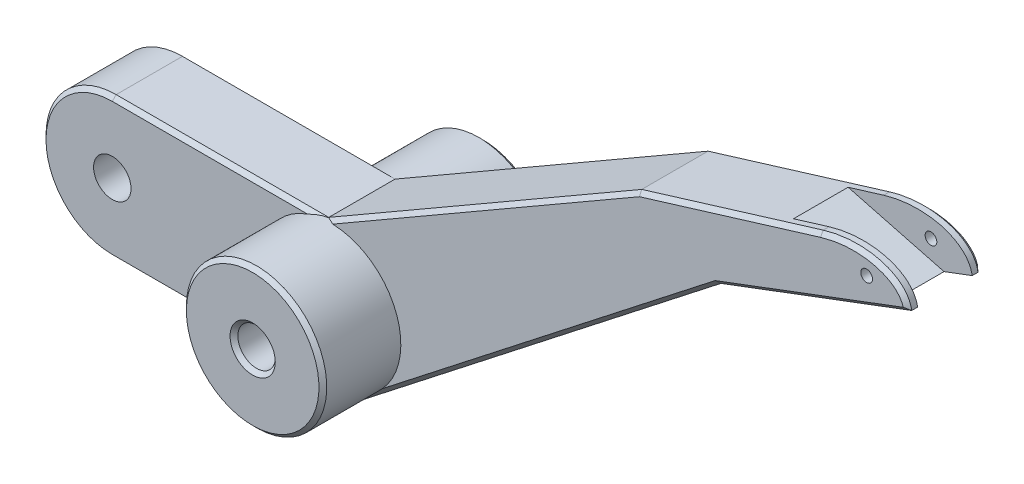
ISO-10303-21;
HEADER;
FILE_DESCRIPTION(('STEP AP214'),'2;1');
FILE_NAME('part.step','',(''),(''),'','','');
FILE_SCHEMA(('AUTOMOTIVE_DESIGN { 1 0 10303 214 1 1 1 1 }'));
ENDSEC;
DATA;
#1=APPLICATION_CONTEXT('core data for automotive mechanical design processes');
#2=APPLICATION_PROTOCOL_DEFINITION('international standard','automotive_design',2000,#1);
#3=PRODUCT_CONTEXT('',#1,'mechanical');
#4=PRODUCT('Part','Part','',(#3));
#5=PRODUCT_RELATED_PRODUCT_CATEGORY('part','',(#4));
#6=PRODUCT_DEFINITION_FORMATION('','',#4);
#7=PRODUCT_DEFINITION_CONTEXT('part definition',#1,'design');
#8=PRODUCT_DEFINITION('design','',#6,#7);
#9=PRODUCT_DEFINITION_SHAPE('','',#8);
#10=(LENGTH_UNIT() NAMED_UNIT(*) SI_UNIT(.MILLI.,.METRE.));
#11=(NAMED_UNIT(*) PLANE_ANGLE_UNIT() SI_UNIT($,.RADIAN.));
#12=(NAMED_UNIT(*) SI_UNIT($,.STERADIAN.) SOLID_ANGLE_UNIT());
#13=UNCERTAINTY_MEASURE_WITH_UNIT(LENGTH_MEASURE(1.E-05),#10,'distance_accuracy_value','');
#14=(GEOMETRIC_REPRESENTATION_CONTEXT(3) GLOBAL_UNCERTAINTY_ASSIGNED_CONTEXT((#13)) GLOBAL_UNIT_ASSIGNED_CONTEXT((#10,
#11,#12)) REPRESENTATION_CONTEXT('',''));
#15=CARTESIAN_POINT('',(0.,0.,0.));
#16=DIRECTION('',(0.,0.,1.));
#17=DIRECTION('',(1.,0.,0.));
#18=AXIS2_PLACEMENT_3D('',#15,#16,#17);
#19=CARTESIAN_POINT('',(0.,0.,4.75));
#20=DIRECTION('',(0.,0.,1.));
#21=DIRECTION('',(1.,0.,0.));
#22=AXIS2_PLACEMENT_3D('',#19,#20,#21);
#23=PLANE('',#22);
#24=DIRECTION('',(1.,0.,0.));
#25=VECTOR('',#24,1.);
#26=CARTESIAN_POINT('',(50.7137867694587,10.5,4.75));
#27=LINE('',#26,#25);
#28=CARTESIAN_POINT('',(49.9580398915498,10.5,4.75));
#29=VERTEX_POINT('',#28);
#30=CARTESIAN_POINT('',(50.5416229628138,10.5,4.75));
#31=VERTEX_POINT('',#30);
#32=EDGE_CURVE('E452',#29,#31,#27,.T.);
#33=ORIENTED_EDGE('',*,*,#32,.T.);
#34=DIRECTION('',(0.788010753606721,0.61566147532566,0.));
#35=VECTOR('',#34,1.);
#36=CARTESIAN_POINT('',(96.2434586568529,46.2061873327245,4.75));
#37=LINE('',#36,#35);
#38=CARTESIAN_POINT('',(51.3049125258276,11.0963471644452,4.75));
#39=VERTEX_POINT('',#38);
#40=EDGE_CURVE('E454',#31,#39,#37,.T.);
#41=ORIENTED_EDGE('',*,*,#40,.T.);
#42=CARTESIAN_POINT('',(47.,19.,4.75));
#43=DIRECTION('',(0.,0.,1.));
#44=DIRECTION('',(1.,0.,0.));
#45=AXIS2_PLACEMENT_3D('',#42,#43,#44);
#46=CIRCLE('',#45,9.);
#47=EDGE_CURVE('E813',#39,#29,#46,.F.);
#48=ORIENTED_EDGE('',*,*,#47,.T.);
#49=EDGE_LOOP('',(#33,#41,#48));
#50=FACE_BOUND('',#49,.T.);
#51=ADVANCED_FACE('F44',(#50),#23,.T.);
#52=CARTESIAN_POINT('',(115.727753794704,56.5,4.75));
#53=DIRECTION('',(0.,0.,1.));
#54=DIRECTION('',(1.,0.,0.));
#55=AXIS2_PLACEMENT_3D('',#52,#53,#54);
#56=CIRCLE('',#55,0.749999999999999);
#57=CARTESIAN_POINT('',(116.477753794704,56.5,4.75));
#58=VERTEX_POINT('',#57);
#59=EDGE_CURVE('E290',#58,#58,#56,.T.);
#60=ORIENTED_EDGE('',*,*,#59,.F.);
#61=EDGE_LOOP('',(#60));
#62=FACE_BOUND('',#61,.T.);
#63=CARTESIAN_POINT('',(47.2553546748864,27.9963767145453,4.75));
#64=VERTEX_POINT('',#63);
#65=CARTESIAN_POINT('',(53.627427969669,12.9108950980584,4.75));
#66=VERTEX_POINT('',#65);
#67=EDGE_CURVE('E816',#64,#66,#46,.F.);
#68=ORIENTED_EDGE('',*,*,#67,.T.);
#69=DIRECTION('',(0.788010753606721,0.61566147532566,0.));
#70=VECTOR('',#69,1.);
#71=CARTESIAN_POINT('',(96.2434586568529,46.2061873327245,4.75));
#72=LINE('',#71,#70);
#73=CARTESIAN_POINT('',(96.3035751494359,46.2531554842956,4.75));
#74=VERTEX_POINT('',#73);
#75=EDGE_CURVE('E447',#66,#74,#72,.T.);
#76=ORIENTED_EDGE('',*,*,#75,.T.);
#77=DIRECTION('',(0.935754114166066,0.352653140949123,0.));
#78=VECTOR('',#77,1.);
#79=CARTESIAN_POINT('',(120.832848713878,55.4973845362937,4.75));
#80=LINE('',#79,#78);
#81=CARTESIAN_POINT('',(120.426273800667,55.3441606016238,4.75));
#82=VERTEX_POINT('',#81);
#83=EDGE_CURVE('E439',#74,#82,#80,.T.);
#84=ORIENTED_EDGE('',*,*,#83,.T.);
#85=CARTESIAN_POINT('',(109.810487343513,57.8077529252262,4.75));
#86=CARTESIAN_POINT('',(110.068065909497,57.8864991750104,4.75));
#87=CARTESIAN_POINT('',(110.326584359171,57.9580290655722,4.75));
#88=CARTESIAN_POINT('',(110.845446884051,58.0870718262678,4.75));
#89=CARTESIAN_POINT('',(111.105790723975,58.1445865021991,4.75000000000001));
#90=CARTESIAN_POINT('',(111.628291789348,58.2456928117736,4.75));
#91=CARTESIAN_POINT('',(111.890448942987,58.2892849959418,4.75));
#92=CARTESIAN_POINT('',(112.416608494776,58.3623017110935,4.75));
#93=CARTESIAN_POINT('',(112.680610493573,58.3917293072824,4.75));
#94=CARTESIAN_POINT('',(113.210538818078,58.4358096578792,4.75));
#95=CARTESIAN_POINT('',(113.476464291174,58.4504689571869,4.75));
#96=CARTESIAN_POINT('',(113.876898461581,58.4605881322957,4.75));
#97=CARTESIAN_POINT('',(114.010634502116,58.4619804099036,4.75));
#98=CARTESIAN_POINT('',(114.278647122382,58.460614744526,4.75));
#99=CARTESIAN_POINT('',(114.412932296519,58.4578563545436,4.75));
#100=CARTESIAN_POINT('',(114.614761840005,58.4504372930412,4.75));
#101=CARTESIAN_POINT('',(114.68215241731,58.4474131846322,4.75));
#102=CARTESIAN_POINT('',(114.816897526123,58.4402458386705,4.75000000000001));
#103=CARTESIAN_POINT('',(114.884163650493,58.4361082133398,4.75));
#104=CARTESIAN_POINT('',(115.085637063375,58.4220003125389,4.75000000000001));
#105=CARTESIAN_POINT('',(115.219619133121,58.4103351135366,4.75));
#106=CARTESIAN_POINT('',(115.486734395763,58.3822948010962,4.75));
#107=CARTESIAN_POINT('',(115.619892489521,58.3659195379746,4.75));
#108=CARTESIAN_POINT('',(115.885367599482,58.3282112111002,4.74999999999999));
#109=CARTESIAN_POINT('',(116.017684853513,58.306879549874,4.75));
#110=CARTESIAN_POINT('',(116.413295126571,58.2349770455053,4.75));
#111=CARTESIAN_POINT('',(116.675293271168,58.1765418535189,4.75));
#112=CARTESIAN_POINT('',(117.000098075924,58.0882035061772,4.75));
#113=CARTESIAN_POINT('',(117.064958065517,58.0697495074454,4.75));
#114=CARTESIAN_POINT('',(117.194337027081,58.0312485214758,4.75));
#115=CARTESIAN_POINT('',(117.258984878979,58.0111562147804,4.75));
#116=CARTESIAN_POINT('',(117.387440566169,57.969446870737,4.75));
#117=CARTESIAN_POINT('',(117.451306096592,57.947815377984,4.75));
#118=CARTESIAN_POINT('',(117.578269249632,57.9029464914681,4.75));
#119=CARTESIAN_POINT('',(117.64136973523,57.8797086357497,4.75000000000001));
#120=CARTESIAN_POINT('',(117.829482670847,57.8074894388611,4.75000000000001));
#121=CARTESIAN_POINT('',(117.953309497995,57.7560085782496,4.75000000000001));
#122=CARTESIAN_POINT('',(118.197503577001,57.6457534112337,4.75));
#123=CARTESIAN_POINT('',(118.317872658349,57.5869829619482,4.75000000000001));
#124=CARTESIAN_POINT('',(118.495539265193,57.4927409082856,4.75));
#125=CARTESIAN_POINT('',(118.554279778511,57.4603113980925,4.75));
#126=CARTESIAN_POINT('',(118.670735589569,57.3932910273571,4.75));
#127=CARTESIAN_POINT('',(118.728451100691,57.3587006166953,4.75));
#128=CARTESIAN_POINT('',(118.842785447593,57.2872077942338,4.75));
#129=CARTESIAN_POINT('',(118.899394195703,57.250311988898,4.74999999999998));
#130=CARTESIAN_POINT('',(118.983452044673,57.1930815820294,4.75));
#131=CARTESIAN_POINT('',(119.011338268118,57.1736812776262,4.74999999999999));
#132=CARTESIAN_POINT('',(119.066577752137,57.1343954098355,4.75));
#133=CARTESIAN_POINT('',(119.093965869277,57.1144879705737,4.75));
#134=CARTESIAN_POINT('',(119.229627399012,57.0136428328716,4.75));
#135=CARTESIAN_POINT('',(119.33423666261,56.9287339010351,4.75));
#136=CARTESIAN_POINT('',(119.484579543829,56.7943390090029,4.75));
#137=CARTESIAN_POINT('',(119.533599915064,56.7483668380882,4.75));
#138=CARTESIAN_POINT('',(119.629314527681,56.6539263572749,4.75));
#139=CARTESIAN_POINT('',(119.676009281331,56.6054585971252,4.75));
#140=CARTESIAN_POINT('',(119.766911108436,56.5058535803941,4.75));
#141=CARTESIAN_POINT('',(119.811121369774,56.4547093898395,4.75));
#142=CARTESIAN_POINT('',(119.896849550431,56.3495733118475,4.75));
#143=CARTESIAN_POINT('',(119.938450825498,56.2954344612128,4.75000000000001));
#144=CARTESIAN_POINT('',(120.017662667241,56.1856044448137,4.75));
#145=CARTESIAN_POINT('',(120.055499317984,56.129646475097,4.75));
#146=CARTESIAN_POINT('',(120.127384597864,56.0157463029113,4.75));
#147=CARTESIAN_POINT('',(120.161456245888,55.9577770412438,4.75));
#148=CARTESIAN_POINT('',(120.225723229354,55.8397269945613,4.75000000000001));
#149=CARTESIAN_POINT('',(120.255918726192,55.7796462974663,4.74999999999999));
#150=CARTESIAN_POINT('',(120.312274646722,55.6572868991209,4.75000000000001));
#151=CARTESIAN_POINT('',(120.33843999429,55.5949881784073,4.75000000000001));
#152=CARTESIAN_POINT('',(120.374507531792,55.4998757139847,4.75));
#153=CARTESIAN_POINT('',(120.386007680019,55.4678613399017,4.75));
#154=CARTESIAN_POINT('',(120.407917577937,55.4032734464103,4.74999999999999));
#155=CARTESIAN_POINT('',(120.418266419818,55.3708782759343,4.75));
#156=CARTESIAN_POINT('',(120.437755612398,55.3059039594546,4.74999999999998));
#157=CARTESIAN_POINT('',(120.446904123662,55.2733067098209,4.74999999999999));
#158=CARTESIAN_POINT('',(120.464006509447,55.2079245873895,4.75000000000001));
#159=CARTESIAN_POINT('',(120.471962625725,55.1751345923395,4.75));
#160=CARTESIAN_POINT('',(120.483011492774,55.1258024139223,4.75));
#161=CARTESIAN_POINT('',(120.486546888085,55.109333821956,4.75));
#162=CARTESIAN_POINT('',(120.493323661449,55.0763477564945,4.75000000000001));
#163=CARTESIAN_POINT('',(120.496565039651,55.059830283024,4.75000000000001));
#164=CARTESIAN_POINT('',(120.501207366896,55.0350175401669,4.75));
#165=CARTESIAN_POINT('',(120.502718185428,55.0267405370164,4.75));
#166=CARTESIAN_POINT('',(120.505666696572,55.0101743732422,4.75000000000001));
#167=CARTESIAN_POINT('',(120.507104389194,55.0018852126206,4.75));
#168=CARTESIAN_POINT('',(120.509906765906,54.9852947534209,4.75));
#169=CARTESIAN_POINT('',(120.511270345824,54.9769932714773,4.75000000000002));
#170=CARTESIAN_POINT('',(120.51293202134,54.9666093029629,4.75));
#171=CARTESIAN_POINT('',(120.513261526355,54.9645320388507,4.75));
#172=CARTESIAN_POINT('',(120.51375278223,54.9614156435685,4.75));
#173=CARTESIAN_POINT('',(120.513915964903,54.9603767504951,4.75));
#174=CARTESIAN_POINT('',(120.51424119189,54.9582987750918,4.75));
#175=CARTESIAN_POINT('',(120.514403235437,54.9572596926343,4.75));
#176=CARTESIAN_POINT('',(120.514645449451,54.9557009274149,4.75));
#177=CARTESIAN_POINT('',(120.514726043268,54.9551813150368,4.74999999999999));
#178=CARTESIAN_POINT('',(120.514886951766,54.9541420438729,4.75));
#179=CARTESIAN_POINT('',(120.514967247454,54.9536223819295,4.74999999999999));
#180=CARTESIAN_POINT('',(120.515127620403,54.9525830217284,4.75000000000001));
#181=CARTESIAN_POINT('',(120.515207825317,54.9520633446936,4.75));
#182=CARTESIAN_POINT('',(120.515368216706,54.9510239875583,4.75));
#183=CARTESIAN_POINT('',(120.515448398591,54.9505043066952,4.75));
#184=CARTESIAN_POINT('',(120.515849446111,54.9479059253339,4.75));
#185=CARTESIAN_POINT('',(120.51617017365,54.9458272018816,4.75));
#186=CARTESIAN_POINT('',(120.516811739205,54.9416697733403,4.75));
#187=CARTESIAN_POINT('',(120.517132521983,54.9395910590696,4.75));
#188=CARTESIAN_POINT('',(120.517774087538,54.9354336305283,4.75));
#189=CARTESIAN_POINT('',(120.518094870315,54.9333549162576,4.75));
#190=CARTESIAN_POINT('',(120.519057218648,54.9271187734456,4.75));
#191=CARTESIAN_POINT('',(120.519698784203,54.9229613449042,4.75));
#192=CARTESIAN_POINT('',(120.521623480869,54.9104890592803,4.75));
#193=CARTESIAN_POINT('',(120.522906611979,54.9021742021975,4.75));
#194=CARTESIAN_POINT('',(120.52675600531,54.8772296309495,4.75));
#195=CARTESIAN_POINT('',(120.52932226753,54.8605999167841,4.75));
#196=CARTESIAN_POINT('',(120.537021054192,54.8107107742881,4.75));
#197=CARTESIAN_POINT('',(120.542153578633,54.7774513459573,4.75));
#198=CARTESIAN_POINT('',(120.557551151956,54.6776730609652,4.75));
#199=CARTESIAN_POINT('',(120.567816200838,54.6111542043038,4.75));
#200=CARTESIAN_POINT('',(120.588346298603,54.4781164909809,4.75));
#201=CARTESIAN_POINT('',(120.598611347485,54.4115976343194,4.75));
#202=CARTESIAN_POINT('',(120.608876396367,54.345078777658,4.75));
#203=B_SPLINE_CURVE_WITH_KNOTS('',3,(#85,#86,#87,#88,#89,#90,#91,#92,#93,#94,#95,#96,#97,#98,
#99,#100,#101,#102,#103,#104,#105,#106,#107,#108,#109,#110,#111,#112,#113,#114,#115,#116,#117,
#118,#119,#120,#121,#122,#123,#124,#125,#126,#127,#128,#129,#130,#131,#132,#133,#134,#135,#136,
#137,#138,#139,#140,#141,#142,#143,#144,#145,#146,#147,#148,#149,#150,#151,#152,#153,#154,#155,
#156,#157,#158,#159,#160,#161,#162,#163,#164,#165,#166,#167,#168,#169,#170,#171,#172,#173,#174,
#175,#176,#177,#178,#179,#180,#181,#182,#183,#184,#185,#186,#187,#188,#189,#190,#191,#192,#193,
#194,#195,#196,#197,#198,#199,#200,#201,#202),.UNSPECIFIED.,.F.,.F.,(4,2,2,2,2,2,2,2,2,2,2,2,2,
2,2,2,2,2,2,2,2,2,2,2,2,2,2,2,2,2,2,2,2,2,2,2,2,2,2,2,2,2,2,2,2,2,2,2,2,2,2,2,2,2,2,2,2,2,4),
(0.,0.000796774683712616,0.00159354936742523,0.00239032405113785,0.00318709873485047,
0.00398387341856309,0.00438226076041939,0.0047806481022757,0.00497984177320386,
0.00517903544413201,0.00557742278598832,0.00597581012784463,0.00637419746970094,
0.00717097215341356,0.00737016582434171,0.00756935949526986,0.00776855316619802,
0.00796774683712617,0.00836613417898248,0.00876452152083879,0.00896371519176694,
0.0091629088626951,0.00936210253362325,0.00946169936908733,0.00956129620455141,
0.00995968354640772,0.0101588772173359,0.010358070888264,0.0105572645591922,0.0107564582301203,
0.0109556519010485,0.0111548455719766,0.0113540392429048,0.011553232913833,0.011652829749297,
0.0117524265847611,0.0118520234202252,0.0119516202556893,0.0120014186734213,0.0120512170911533,
0.0120761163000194,0.0121010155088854,0.0121259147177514,0.0121321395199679,0.0121352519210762,
0.0121383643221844,0.0121399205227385,0.0121414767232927,0.0121430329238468,0.0121445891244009,
0.0121508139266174,0.0121570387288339,0.0121632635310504,0.0121757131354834,0.0122006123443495,
0.0122504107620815,0.0123500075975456,0.0125492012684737,0.0127483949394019),.UNSPECIFIED.);
#204=CARTESIAN_POINT('',(109.810487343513,57.8077529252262,4.75));
#205=VERTEX_POINT('',#204);
#206=EDGE_CURVE('E448',#82,#205,#203,.F.);
#207=ORIENTED_EDGE('',*,*,#206,.T.);
#208=DIRECTION('',(-0.956304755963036,-0.292371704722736,0.));
#209=VECTOR('',#208,1.);
#210=CARTESIAN_POINT('',(86.5439623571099,50.6944623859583,4.75));
#211=LINE('',#210,#209);
#212=CARTESIAN_POINT('',(86.5984409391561,50.7111181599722,4.75));
#213=VERTEX_POINT('',#212);
#214=EDGE_CURVE('E666',#205,#213,#211,.T.);
#215=ORIENTED_EDGE('',*,*,#214,.T.);
#216=DIRECTION('',(-0.866025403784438,-0.500000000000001,0.));
#217=VECTOR('',#216,1.);
#218=CARTESIAN_POINT('',(46.5116303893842,27.5669872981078,4.75));
#219=LINE('',#218,#217);
#220=EDGE_CURVE('E742',#213,#64,#219,.T.);
#221=ORIENTED_EDGE('',*,*,#220,.T.);
#222=EDGE_LOOP('',(#68,#76,#84,#207,#215,#221));
#223=FACE_BOUND('',#222,.T.);
#224=ADVANCED_FACE('F431',(#62,#223),#23,.T.);
#225=CARTESIAN_POINT('',(0.,0.,-4.75));
#226=DIRECTION('',(0.,0.,1.));
#227=DIRECTION('',(1.,0.,0.));
#228=AXIS2_PLACEMENT_3D('',#225,#226,#227);
#229=PLANE('',#228);
#230=CARTESIAN_POINT('',(47.,19.,-4.75));
#231=DIRECTION('',(0.,0.,1.));
#232=DIRECTION('',(1.,0.,0.));
#233=AXIS2_PLACEMENT_3D('',#230,#231,#232);
#234=CIRCLE('',#233,9.);
#235=CARTESIAN_POINT('',(51.3049125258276,11.0963471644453,-4.75));
#236=VERTEX_POINT('',#235);
#237=CARTESIAN_POINT('',(49.9580398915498,10.5,-4.75));
#238=VERTEX_POINT('',#237);
#239=EDGE_CURVE('E508',#236,#238,#234,.F.);
#240=ORIENTED_EDGE('',*,*,#239,.F.);
#241=DIRECTION('',(-0.788010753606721,-0.61566147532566,0.));
#242=VECTOR('',#241,1.);
#243=CARTESIAN_POINT('',(14.0631963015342,-18.0000704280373,-4.75));
#244=LINE('',#243,#242);
#245=CARTESIAN_POINT('',(50.5416229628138,10.5,-4.75));
#246=VERTEX_POINT('',#245);
#247=EDGE_CURVE('E680',#236,#246,#244,.T.);
#248=ORIENTED_EDGE('',*,*,#247,.T.);
#249=DIRECTION('',(-1.,0.,0.));
#250=VECTOR('',#249,1.);
#251=CARTESIAN_POINT('',(0.,10.5,-4.75));
#252=LINE('',#251,#250);
#253=EDGE_CURVE('E796',#246,#238,#252,.T.);
#254=ORIENTED_EDGE('',*,*,#253,.T.);
#255=EDGE_LOOP('',(#240,#248,#254));
#256=FACE_BOUND('',#255,.T.);
#257=ADVANCED_FACE('F801',(#256),#229,.F.);
#258=CARTESIAN_POINT('',(19.,19.,-4.75));
#259=DIRECTION('',(0.,0.,1.));
#260=DIRECTION('',(1.,0.,0.));
#261=AXIS2_PLACEMENT_3D('',#258,#259,#260);
#262=CIRCLE('',#261,2.4);
#263=CARTESIAN_POINT('',(21.4,19.,-4.75));
#264=VERTEX_POINT('',#263);
#265=EDGE_CURVE('E293',#264,#264,#262,.T.);
#266=ORIENTED_EDGE('',*,*,#265,.T.);
#267=EDGE_LOOP('',(#266));
#268=FACE_BOUND('',#267,.T.);
#269=CARTESIAN_POINT('',(44.0419601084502,10.5,-4.75));
#270=VERTEX_POINT('',#269);
#271=CARTESIAN_POINT('',(44.0419601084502,27.5,-4.75));
#272=VERTEX_POINT('',#271);
#273=EDGE_CURVE('E811',#270,#272,#234,.F.);
#274=ORIENTED_EDGE('',*,*,#273,.F.);
#275=DIRECTION('',(-1.,0.,0.));
#276=VECTOR('',#275,1.);
#277=CARTESIAN_POINT('',(0.,10.5,-4.75));
#278=LINE('',#277,#276);
#279=CARTESIAN_POINT('',(19.,10.5,-4.75));
#280=VERTEX_POINT('',#279);
#281=EDGE_CURVE('E794',#270,#280,#278,.T.);
#282=ORIENTED_EDGE('',*,*,#281,.T.);
#283=CARTESIAN_POINT('',(19.,19.,-4.75));
#284=DIRECTION('',(0.,0.,1.));
#285=DIRECTION('',(1.,0.,0.));
#286=AXIS2_PLACEMENT_3D('',#283,#284,#285);
#287=CIRCLE('',#286,8.5);
#288=CARTESIAN_POINT('',(10.5,19.,-4.75));
#289=VERTEX_POINT('',#288);
#290=EDGE_CURVE('E792',#280,#289,#287,.F.);
#291=ORIENTED_EDGE('',*,*,#290,.T.);
#292=CARTESIAN_POINT('',(19.,19.,-4.75));
#293=DIRECTION('',(0.,0.,1.));
#294=DIRECTION('',(1.,0.,0.));
#295=AXIS2_PLACEMENT_3D('',#292,#293,#294);
#296=CIRCLE('',#295,8.5);
#297=CARTESIAN_POINT('',(19.,27.5,-4.75));
#298=VERTEX_POINT('',#297);
#299=EDGE_CURVE('E790',#289,#298,#296,.F.);
#300=ORIENTED_EDGE('',*,*,#299,.T.);
#301=DIRECTION('',(1.,0.,0.));
#302=VECTOR('',#301,1.);
#303=CARTESIAN_POINT('',(0.,27.5,-4.75));
#304=LINE('',#303,#302);
#305=EDGE_CURVE('E788',#298,#272,#304,.T.);
#306=ORIENTED_EDGE('',*,*,#305,.T.);
#307=EDGE_LOOP('',(#274,#282,#291,#300,#306));
#308=FACE_BOUND('',#307,.T.);
#309=ADVANCED_FACE('F429',(#268,#308),#229,.F.);
#310=CARTESIAN_POINT('',(19.,19.,4.75));
#311=DIRECTION('',(0.,0.,1.));
#312=DIRECTION('',(1.,0.,0.));
#313=AXIS2_PLACEMENT_3D('',#310,#311,#312);
#314=CIRCLE('',#313,2.4);
#315=CARTESIAN_POINT('',(21.4,19.,4.75));
#316=VERTEX_POINT('',#315);
#317=EDGE_CURVE('E297',#316,#316,#314,.T.);
#318=ORIENTED_EDGE('',*,*,#317,.F.);
#319=EDGE_LOOP('',(#318));
#320=FACE_BOUND('',#319,.T.);
#321=CARTESIAN_POINT('',(19.,19.,4.75));
#322=DIRECTION('',(0.,0.,1.));
#323=DIRECTION('',(1.,0.,0.));
#324=AXIS2_PLACEMENT_3D('',#321,#322,#323);
#325=CIRCLE('',#324,8.5);
#326=CARTESIAN_POINT('',(10.5,19.,4.75));
#327=VERTEX_POINT('',#326);
#328=CARTESIAN_POINT('',(19.,10.5,4.75));
#329=VERTEX_POINT('',#328);
#330=EDGE_CURVE('E738',#327,#329,#325,.T.);
#331=ORIENTED_EDGE('',*,*,#330,.T.);
#332=DIRECTION('',(1.,0.,0.));
#333=VECTOR('',#332,1.);
#334=CARTESIAN_POINT('',(47.,10.5,4.75));
#335=LINE('',#334,#333);
#336=CARTESIAN_POINT('',(44.0419601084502,10.5,4.75));
#337=VERTEX_POINT('',#336);
#338=EDGE_CURVE('E740',#329,#337,#335,.T.);
#339=ORIENTED_EDGE('',*,*,#338,.T.);
#340=CARTESIAN_POINT('',(44.0419601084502,27.5,4.75));
#341=VERTEX_POINT('',#340);
#342=EDGE_CURVE('E817',#337,#341,#46,.F.);
#343=ORIENTED_EDGE('',*,*,#342,.T.);
#344=DIRECTION('',(-1.,0.,0.));
#345=VECTOR('',#344,1.);
#346=CARTESIAN_POINT('',(19.,27.5,4.75));
#347=LINE('',#346,#345);
#348=CARTESIAN_POINT('',(19.,27.5,4.75));
#349=VERTEX_POINT('',#348);
#350=EDGE_CURVE('E734',#341,#349,#347,.T.);
#351=ORIENTED_EDGE('',*,*,#350,.T.);
#352=CARTESIAN_POINT('',(19.,19.,4.75));
#353=DIRECTION('',(0.,0.,1.));
#354=DIRECTION('',(1.,0.,0.));
#355=AXIS2_PLACEMENT_3D('',#352,#353,#354);
#356=CIRCLE('',#355,8.5);
#357=EDGE_CURVE('E736',#349,#327,#356,.T.);
#358=ORIENTED_EDGE('',*,*,#357,.T.);
#359=EDGE_LOOP('',(#331,#339,#343,#351,#358));
#360=FACE_BOUND('',#359,.T.);
#361=ADVANCED_FACE('F425',(#320,#360),#23,.T.);
#362=CARTESIAN_POINT('',(115.727753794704,56.5,-4.75));
#363=DIRECTION('',(0.,0.,1.));
#364=DIRECTION('',(1.,0.,0.));
#365=AXIS2_PLACEMENT_3D('',#362,#363,#364);
#366=CIRCLE('',#365,0.749999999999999);
#367=CARTESIAN_POINT('',(116.477753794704,56.5,-4.75));
#368=VERTEX_POINT('',#367);
#369=EDGE_CURVE('E294',#368,#368,#366,.T.);
#370=ORIENTED_EDGE('',*,*,#369,.T.);
#371=EDGE_LOOP('',(#370));
#372=FACE_BOUND('',#371,.T.);
#373=DIRECTION('',(-0.935754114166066,-0.352653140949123,0.));
#374=VECTOR('',#373,1.);
#375=CARTESIAN_POINT('',(-3.28666459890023,8.72106203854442,-4.75));
#376=LINE('',#375,#374);
#377=CARTESIAN_POINT('',(120.426273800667,55.3441606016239,-4.75));
#378=VERTEX_POINT('',#377);
#379=CARTESIAN_POINT('',(96.303575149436,46.2531554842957,-4.75));
#380=VERTEX_POINT('',#379);
#381=EDGE_CURVE('E767',#378,#380,#376,.T.);
#382=ORIENTED_EDGE('',*,*,#381,.T.);
#383=DIRECTION('',(-0.788010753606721,-0.61566147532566,0.));
#384=VECTOR('',#383,1.);
#385=CARTESIAN_POINT('',(14.0631963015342,-18.0000704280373,-4.75));
#386=LINE('',#385,#384);
#387=CARTESIAN_POINT('',(53.627427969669,12.9108950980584,-4.75));
#388=VERTEX_POINT('',#387);
#389=EDGE_CURVE('E784',#380,#388,#386,.T.);
#390=ORIENTED_EDGE('',*,*,#389,.T.);
#391=CARTESIAN_POINT('',(47.2553546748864,27.9963767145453,-4.75));
#392=VERTEX_POINT('',#391);
#393=EDGE_CURVE('E810',#392,#388,#234,.F.);
#394=ORIENTED_EDGE('',*,*,#393,.F.);
#395=DIRECTION('',(0.866025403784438,0.500000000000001,0.));
#396=VECTOR('',#395,1.);
#397=CARTESIAN_POINT('',(-0.308948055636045,0.535113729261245,-4.75));
#398=LINE('',#397,#396);
#399=CARTESIAN_POINT('',(86.5984409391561,50.7111181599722,-4.75));
#400=VERTEX_POINT('',#399);
#401=EDGE_CURVE('E765',#392,#400,#398,.T.);
#402=ORIENTED_EDGE('',*,*,#401,.T.);
#403=DIRECTION('',(0.956304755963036,0.292371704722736,0.));
#404=VECTOR('',#403,1.);
#405=CARTESIAN_POINT('',(-6.77610886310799,22.1636534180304,-4.75));
#406=LINE('',#405,#404);
#407=CARTESIAN_POINT('',(109.810487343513,57.8077529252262,-4.75));
#408=VERTEX_POINT('',#407);
#409=EDGE_CURVE('E761',#400,#408,#406,.T.);
#410=ORIENTED_EDGE('',*,*,#409,.T.);
#411=CARTESIAN_POINT('',(120.608876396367,54.3450787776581,-4.75));
#412=CARTESIAN_POINT('',(120.598611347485,54.4115976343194,-4.75));
#413=CARTESIAN_POINT('',(120.588346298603,54.4781164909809,-4.75));
#414=CARTESIAN_POINT('',(120.567816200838,54.6111542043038,-4.75));
#415=CARTESIAN_POINT('',(120.557551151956,54.6776730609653,-4.75));
#416=CARTESIAN_POINT('',(120.542153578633,54.7774513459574,-4.75));
#417=CARTESIAN_POINT('',(120.537021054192,54.8107107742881,-4.75));
#418=CARTESIAN_POINT('',(120.52932226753,54.8605999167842,-4.75));
#419=CARTESIAN_POINT('',(120.52675600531,54.8772296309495,-4.75));
#420=CARTESIAN_POINT('',(120.522906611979,54.9021742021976,-4.75));
#421=CARTESIAN_POINT('',(120.521623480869,54.9104890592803,-4.75));
#422=CARTESIAN_POINT('',(120.519698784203,54.9229613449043,-4.75));
#423=CARTESIAN_POINT('',(120.519057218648,54.9271187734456,-4.75));
#424=CARTESIAN_POINT('',(120.518094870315,54.9333549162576,-4.75));
#425=CARTESIAN_POINT('',(120.517774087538,54.9354336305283,-4.75));
#426=CARTESIAN_POINT('',(120.517132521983,54.9395910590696,-4.75));
#427=CARTESIAN_POINT('',(120.516811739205,54.9416697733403,-4.75000000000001));
#428=CARTESIAN_POINT('',(120.51617017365,54.9458272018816,-4.75));
#429=CARTESIAN_POINT('',(120.515849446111,54.947905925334,-4.75));
#430=CARTESIAN_POINT('',(120.515448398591,54.9505043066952,-4.75));
#431=CARTESIAN_POINT('',(120.515368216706,54.9510239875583,-4.75));
#432=CARTESIAN_POINT('',(120.515207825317,54.9520633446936,-4.75));
#433=CARTESIAN_POINT('',(120.515127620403,54.9525830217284,-4.75));
#434=CARTESIAN_POINT('',(120.514967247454,54.9536223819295,-4.75));
#435=CARTESIAN_POINT('',(120.514886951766,54.9541420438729,-4.75));
#436=CARTESIAN_POINT('',(120.514726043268,54.9551813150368,-4.75));
#437=CARTESIAN_POINT('',(120.514645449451,54.9557009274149,-4.75));
#438=CARTESIAN_POINT('',(120.514403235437,54.9572596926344,-4.75000000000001));
#439=CARTESIAN_POINT('',(120.51424119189,54.9582987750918,-4.75));
#440=CARTESIAN_POINT('',(120.513915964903,54.9603767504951,-4.75));
#441=CARTESIAN_POINT('',(120.51375278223,54.9614156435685,-4.75));
#442=CARTESIAN_POINT('',(120.513261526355,54.9645320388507,-4.75000000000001));
#443=CARTESIAN_POINT('',(120.51293202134,54.9666093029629,-4.75));
#444=CARTESIAN_POINT('',(120.511270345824,54.9769932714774,-4.74999999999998));
#445=CARTESIAN_POINT('',(120.509906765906,54.985294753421,-4.75));
#446=CARTESIAN_POINT('',(120.507104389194,55.0018852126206,-4.75));
#447=CARTESIAN_POINT('',(120.505666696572,55.0101743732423,-4.75));
#448=CARTESIAN_POINT('',(120.502718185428,55.0267405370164,-4.75));
#449=CARTESIAN_POINT('',(120.501207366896,55.035017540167,-4.75));
#450=CARTESIAN_POINT('',(120.496565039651,55.059830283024,-4.75));
#451=CARTESIAN_POINT('',(120.493323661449,55.0763477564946,-4.75000000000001));
#452=CARTESIAN_POINT('',(120.486546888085,55.109333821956,-4.74999999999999));
#453=CARTESIAN_POINT('',(120.483011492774,55.1258024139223,-4.75));
#454=CARTESIAN_POINT('',(120.471962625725,55.1751345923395,-4.75000000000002));
#455=CARTESIAN_POINT('',(120.464006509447,55.2079245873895,-4.75));
#456=CARTESIAN_POINT('',(120.446904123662,55.2733067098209,-4.75));
#457=CARTESIAN_POINT('',(120.437755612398,55.3059039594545,-4.74999999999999));
#458=CARTESIAN_POINT('',(120.418266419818,55.3708782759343,-4.75000000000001));
#459=CARTESIAN_POINT('',(120.407917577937,55.4032734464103,-4.75));
#460=CARTESIAN_POINT('',(120.386007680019,55.4678613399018,-4.75000000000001));
#461=CARTESIAN_POINT('',(120.374507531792,55.4998757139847,-4.75));
#462=CARTESIAN_POINT('',(120.33843999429,55.5949881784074,-4.75000000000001));
#463=CARTESIAN_POINT('',(120.312274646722,55.6572868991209,-4.75));
#464=CARTESIAN_POINT('',(120.255918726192,55.7796462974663,-4.75));
#465=CARTESIAN_POINT('',(120.225723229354,55.8397269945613,-4.74999999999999));
#466=CARTESIAN_POINT('',(120.161456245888,55.9577770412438,-4.75000000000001));
#467=CARTESIAN_POINT('',(120.127384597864,56.0157463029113,-4.74999999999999));
#468=CARTESIAN_POINT('',(120.055499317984,56.129646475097,-4.75000000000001));
#469=CARTESIAN_POINT('',(120.017662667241,56.1856044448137,-4.75));
#470=CARTESIAN_POINT('',(119.938450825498,56.2954344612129,-4.75));
#471=CARTESIAN_POINT('',(119.896849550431,56.3495733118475,-4.75000000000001));
#472=CARTESIAN_POINT('',(119.811121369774,56.4547093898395,-4.75));
#473=CARTESIAN_POINT('',(119.766911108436,56.505853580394,-4.74999999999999));
#474=CARTESIAN_POINT('',(119.676009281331,56.6054585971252,-4.75));
#475=CARTESIAN_POINT('',(119.629314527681,56.6539263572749,-4.75));
#476=CARTESIAN_POINT('',(119.533599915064,56.7483668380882,-4.75000000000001));
#477=CARTESIAN_POINT('',(119.484579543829,56.7943390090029,-4.75));
#478=CARTESIAN_POINT('',(119.33423666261,56.9287339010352,-4.75000000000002));
#479=CARTESIAN_POINT('',(119.229627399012,57.0136428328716,-4.74999999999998));
#480=CARTESIAN_POINT('',(119.093965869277,57.1144879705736,-4.75));
#481=CARTESIAN_POINT('',(119.066577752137,57.1343954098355,-4.74999999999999));
#482=CARTESIAN_POINT('',(119.011338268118,57.1736812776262,-4.75));
#483=CARTESIAN_POINT('',(118.983452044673,57.1930815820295,-4.74999999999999));
#484=CARTESIAN_POINT('',(118.899394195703,57.250311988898,-4.75000000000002));
#485=CARTESIAN_POINT('',(118.842785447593,57.2872077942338,-4.74999999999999));
#486=CARTESIAN_POINT('',(118.728451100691,57.3587006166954,-4.75));
#487=CARTESIAN_POINT('',(118.670735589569,57.3932910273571,-4.75));
#488=CARTESIAN_POINT('',(118.554279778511,57.4603113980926,-4.75000000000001));
#489=CARTESIAN_POINT('',(118.495539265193,57.4927409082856,-4.75));
#490=CARTESIAN_POINT('',(118.317872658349,57.5869829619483,-4.75000000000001));
#491=CARTESIAN_POINT('',(118.197503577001,57.6457534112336,-4.74999999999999));
#492=CARTESIAN_POINT('',(117.953309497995,57.7560085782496,-4.75000000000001));
#493=CARTESIAN_POINT('',(117.829482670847,57.807489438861,-4.74999999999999));
#494=CARTESIAN_POINT('',(117.64136973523,57.8797086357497,-4.75));
#495=CARTESIAN_POINT('',(117.578269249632,57.902946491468,-4.75));
#496=CARTESIAN_POINT('',(117.451306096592,57.947815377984,-4.75000000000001));
#497=CARTESIAN_POINT('',(117.387440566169,57.969446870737,-4.75));
#498=CARTESIAN_POINT('',(117.258984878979,58.0111562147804,-4.75000000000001));
#499=CARTESIAN_POINT('',(117.194337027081,58.0312485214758,-4.75));
#500=CARTESIAN_POINT('',(117.064958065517,58.0697495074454,-4.75));
#501=CARTESIAN_POINT('',(117.000098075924,58.0882035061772,-4.75));
#502=CARTESIAN_POINT('',(116.675293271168,58.1765418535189,-4.75));
#503=CARTESIAN_POINT('',(116.413295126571,58.2349770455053,-4.74999999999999));
#504=CARTESIAN_POINT('',(116.017684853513,58.306879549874,-4.75));
#505=CARTESIAN_POINT('',(115.885367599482,58.3282112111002,-4.75));
#506=CARTESIAN_POINT('',(115.619892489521,58.3659195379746,-4.75));
#507=CARTESIAN_POINT('',(115.486734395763,58.3822948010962,-4.75000000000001));
#508=CARTESIAN_POINT('',(115.219619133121,58.4103351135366,-4.75));
#509=CARTESIAN_POINT('',(115.085637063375,58.4220003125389,-4.75));
#510=CARTESIAN_POINT('',(114.884163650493,58.4361082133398,-4.75));
#511=CARTESIAN_POINT('',(114.816897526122,58.4402458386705,-4.75));
#512=CARTESIAN_POINT('',(114.68215241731,58.4474131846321,-4.75));
#513=CARTESIAN_POINT('',(114.614761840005,58.4504372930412,-4.75));
#514=CARTESIAN_POINT('',(114.41293229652,58.4578563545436,-4.75));
#515=CARTESIAN_POINT('',(114.278647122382,58.460614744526,-4.74999999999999));
#516=CARTESIAN_POINT('',(114.010634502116,58.4619804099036,-4.75000000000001));
#517=CARTESIAN_POINT('',(113.876898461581,58.4605881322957,-4.75));
#518=CARTESIAN_POINT('',(113.476464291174,58.4504689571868,-4.75000000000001));
#519=CARTESIAN_POINT('',(113.210538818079,58.4358096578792,-4.75));
#520=CARTESIAN_POINT('',(112.680610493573,58.3917293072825,-4.75));
#521=CARTESIAN_POINT('',(112.416608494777,58.3623017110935,-4.75000000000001));
#522=CARTESIAN_POINT('',(111.890448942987,58.2892849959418,-4.75));
#523=CARTESIAN_POINT('',(111.628291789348,58.2456928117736,-4.74999999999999));
#524=CARTESIAN_POINT('',(111.105790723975,58.1445865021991,-4.75));
#525=CARTESIAN_POINT('',(110.845446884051,58.0870718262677,-4.74999999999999));
#526=CARTESIAN_POINT('',(110.326584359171,57.9580290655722,-4.75));
#527=CARTESIAN_POINT('',(110.068065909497,57.8864991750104,-4.74999999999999));
#528=CARTESIAN_POINT('',(109.810487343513,57.8077529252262,-4.75));
#529=B_SPLINE_CURVE_WITH_KNOTS('',3,(#411,#412,#413,#414,#415,#416,#417,#418,#419,#420,#421,
#422,#423,#424,#425,#426,#427,#428,#429,#430,#431,#432,#433,#434,#435,#436,#437,#438,#439,#440,
#441,#442,#443,#444,#445,#446,#447,#448,#449,#450,#451,#452,#453,#454,#455,#456,#457,#458,#459,
#460,#461,#462,#463,#464,#465,#466,#467,#468,#469,#470,#471,#472,#473,#474,#475,#476,#477,#478,
#479,#480,#481,#482,#483,#484,#485,#486,#487,#488,#489,#490,#491,#492,#493,#494,#495,#496,#497,
#498,#499,#500,#501,#502,#503,#504,#505,#506,#507,#508,#509,#510,#511,#512,#513,#514,#515,#516,
#517,#518,#519,#520,#521,#522,#523,#524,#525,#526,#527,#528),.UNSPECIFIED.,.F.,.F.,(4,2,2,2,2,2,
2,2,2,2,2,2,2,2,2,2,2,2,2,2,2,2,2,2,2,2,2,2,2,2,2,2,2,2,2,2,2,2,2,2,2,2,2,2,2,2,2,2,2,2,2,2,2,2,
2,2,2,2,4),(0.,0.000199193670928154,0.000398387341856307,0.000497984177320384,
0.000547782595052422,0.000572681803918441,0.000585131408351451,0.000591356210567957,
0.000597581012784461,0.000603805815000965,0.000605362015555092,0.000606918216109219,
0.000608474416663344,0.000610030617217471,0.000613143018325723,0.000616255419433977,
0.000622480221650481,0.000647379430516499,0.000672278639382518,0.000697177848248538,
0.000746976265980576,0.000796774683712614,0.000896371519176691,0.000995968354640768,
0.00109556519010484,0.00119516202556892,0.00139435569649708,0.00159354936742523,
0.00179274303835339,0.00199193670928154,0.00219113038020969,0.00239032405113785,
0.002589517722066,0.00278871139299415,0.00318709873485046,0.00328669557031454,
0.00338629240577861,0.00358548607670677,0.00378467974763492,0.00398387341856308,
0.00438226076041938,0.00478064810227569,0.00497984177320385,0.005179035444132,
0.00537822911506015,0.00557742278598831,0.00637419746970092,0.00677258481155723,
0.00717097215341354,0.00756935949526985,0.007768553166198,0.00796774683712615,
0.00836613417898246,0.00876452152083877,0.00956129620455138,0.010358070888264,
0.0111548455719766,0.0119516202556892,0.0127483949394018),.UNSPECIFIED.);
#530=EDGE_CURVE('E764',#408,#378,#529,.F.);
#531=ORIENTED_EDGE('',*,*,#530,.T.);
#532=EDGE_LOOP('',(#382,#390,#394,#402,#410,#531));
#533=FACE_BOUND('',#532,.T.);
#534=ADVANCED_FACE('F350',(#372,#533),#229,.F.);
#535=CARTESIAN_POINT('',(121.009175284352,55.0295074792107,4.75));
#536=DIRECTION('',(-0.352653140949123,0.935754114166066,0.));
#537=DIRECTION('',(-0.935754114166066,-0.352653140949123,0.));
#538=AXIS2_PLACEMENT_3D('',#535,#536,#537);
#539=PLANE('',#538);
#540=DIRECTION('',(0.,0.,-1.));
#541=VECTOR('',#540,1.);
#542=CARTESIAN_POINT('',(96.5512893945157,45.8121819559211,4.75));
#543=LINE('',#542,#541);
#544=CARTESIAN_POINT('',(96.5512893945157,45.8121819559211,4.25000000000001));
#545=VERTEX_POINT('',#544);
#546=CARTESIAN_POINT('',(96.5512893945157,45.8121819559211,-4.24999999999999));
#547=VERTEX_POINT('',#546);
#548=EDGE_CURVE('E309',#545,#547,#543,.T.);
#549=ORIENTED_EDGE('',*,*,#548,.T.);
#550=DIRECTION('',(0.935754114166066,0.352653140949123,0.));
#551=VECTOR('',#550,1.);
#552=CARTESIAN_POINT('',(121.009175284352,55.0295074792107,-4.25));
#553=LINE('',#552,#551);
#554=CARTESIAN_POINT('',(121.009175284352,55.0295074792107,-4.25));
#555=VERTEX_POINT('',#554);
#556=EDGE_CURVE('E683',#547,#555,#553,.T.);
#557=ORIENTED_EDGE('',*,*,#556,.T.);
#558=CARTESIAN_POINT('',(121.009175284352,55.0295074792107,5.225));
#559=CARTESIAN_POINT('',(121.009175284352,55.0295074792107,1.74166666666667));
#560=CARTESIAN_POINT('',(121.009175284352,55.0295074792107,-1.74166666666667));
#561=CARTESIAN_POINT('',(121.009175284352,55.0295074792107,-5.225));
#562=(BOUNDED_CURVE() B_SPLINE_CURVE(3,(#558,#559,#560,#561),.UNSPECIFIED.,.F.,
.F.) B_SPLINE_CURVE_WITH_KNOTS((4,4),(-0.000475,0.009975),
.UNSPECIFIED.) CURVE() GEOMETRIC_REPRESENTATION_ITEM() RATIONAL_B_SPLINE_CURVE((0.999999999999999,
0.999999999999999,0.999999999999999,0.999999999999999)) REPRESENTATION_ITEM(''));
#563=CARTESIAN_POINT('',(121.009175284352,55.0295074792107,-3.5));
#564=VERTEX_POINT('',#563);
#565=EDGE_CURVE('E308',#564,#555,#562,.T.);
#566=ORIENTED_EDGE('',*,*,#565,.F.);
#567=DIRECTION('',(0.935754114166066,0.352653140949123,0.));
#568=VECTOR('',#567,1.);
#569=CARTESIAN_POINT('',(121.009175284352,55.0295074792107,-3.5));
#570=LINE('',#569,#568);
#571=CARTESIAN_POINT('',(117.4050546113,53.671239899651,-3.5));
#572=VERTEX_POINT('',#571);
#573=EDGE_CURVE('E251',#572,#564,#570,.T.);
#574=ORIENTED_EDGE('',*,*,#573,.F.);
#575=DIRECTION('',(0.,0.,1.));
#576=VECTOR('',#575,1.);
#577=CARTESIAN_POINT('',(117.4050546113,53.671239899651,4.75));
#578=LINE('',#577,#576);
#579=CARTESIAN_POINT('',(117.4050546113,53.671239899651,3.5));
#580=VERTEX_POINT('',#579);
#581=EDGE_CURVE('E260',#572,#580,#578,.T.);
#582=ORIENTED_EDGE('',*,*,#581,.T.);
#583=DIRECTION('',(0.935754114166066,0.352653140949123,0.));
#584=VECTOR('',#583,1.);
#585=CARTESIAN_POINT('',(121.009175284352,55.0295074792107,3.5));
#586=LINE('',#585,#584);
#587=CARTESIAN_POINT('',(121.009175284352,55.0295074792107,3.5));
#588=VERTEX_POINT('',#587);
#589=EDGE_CURVE('E268',#580,#588,#586,.T.);
#590=ORIENTED_EDGE('',*,*,#589,.T.);
#591=CARTESIAN_POINT('',(121.009175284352,55.0295074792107,5.225));
#592=CARTESIAN_POINT('',(121.009175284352,55.0295074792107,1.74166666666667));
#593=CARTESIAN_POINT('',(121.009175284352,55.0295074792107,-1.74166666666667));
#594=CARTESIAN_POINT('',(121.009175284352,55.0295074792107,-5.225));
#595=(BOUNDED_CURVE() B_SPLINE_CURVE(3,(#591,#592,#593,#594),.UNSPECIFIED.,.F.,
.F.) B_SPLINE_CURVE_WITH_KNOTS((4,4),(-0.000475,0.009975),
.UNSPECIFIED.) CURVE() GEOMETRIC_REPRESENTATION_ITEM() RATIONAL_B_SPLINE_CURVE((0.999999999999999,
0.999999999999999,0.999999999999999,0.999999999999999)) REPRESENTATION_ITEM(''));
#596=CARTESIAN_POINT('',(121.009175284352,55.0295074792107,4.24999999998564));
#597=VERTEX_POINT('',#596);
#598=EDGE_CURVE('E313',#597,#588,#595,.T.);
#599=ORIENTED_EDGE('',*,*,#598,.F.);
#600=DIRECTION('',(-0.935754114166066,-0.352653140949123,0.));
#601=VECTOR('',#600,1.);
#602=CARTESIAN_POINT('',(96.5512893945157,45.8121819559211,4.25000000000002));
#603=LINE('',#602,#601);
#604=EDGE_CURVE('E672',#597,#545,#603,.T.);
#605=ORIENTED_EDGE('',*,*,#604,.T.);
#606=EDGE_LOOP('',(#549,#557,#566,#574,#582,#590,#599,#605));
#607=FACE_BOUND('',#606,.T.);
#608=ADVANCED_FACE('F344',(#607),#539,.F.);
#609=CARTESIAN_POINT('',(86.3977765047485,51.1726147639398,4.75));
#610=DIRECTION('',(0.292371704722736,-0.956304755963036,0.));
#611=DIRECTION('',(0.956304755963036,0.292371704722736,0.));
#612=AXIS2_PLACEMENT_3D('',#609,#610,#611);
#613=PLANE('',#612);
#614=CARTESIAN_POINT('',(109.664301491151,58.2859053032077,-5.225));
#615=CARTESIAN_POINT('',(109.664301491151,58.2859053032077,-1.74166666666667));
#616=CARTESIAN_POINT('',(109.664301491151,58.2859053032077,1.74166666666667));
#617=CARTESIAN_POINT('',(109.664301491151,58.2859053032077,5.225));
#618=(BOUNDED_CURVE() B_SPLINE_CURVE(3,(#614,#615,#616,#617),.UNSPECIFIED.,.F.,
.F.) B_SPLINE_CURVE_WITH_KNOTS((4,4),(-0.000475,0.009975),
.UNSPECIFIED.) CURVE() GEOMETRIC_REPRESENTATION_ITEM() RATIONAL_B_SPLINE_CURVE((1.,1.,1.,1.)) REPRESENTATION_ITEM(''));
#619=CARTESIAN_POINT('',(109.664301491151,58.2859053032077,-3.5));
#620=VERTEX_POINT('',#619);
#621=CARTESIAN_POINT('',(109.664301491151,58.2859053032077,-4.25));
#622=VERTEX_POINT('',#621);
#623=EDGE_CURVE('E322',#620,#622,#618,.F.);
#624=ORIENTED_EDGE('',*,*,#623,.T.);
#625=DIRECTION('',(-0.956304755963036,-0.292371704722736,0.));
#626=VECTOR('',#625,1.);
#627=CARTESIAN_POINT('',(86.3977765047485,51.1726147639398,-4.25));
#628=LINE('',#627,#626);
#629=CARTESIAN_POINT('',(86.3977765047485,51.1726147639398,-4.25));
#630=VERTEX_POINT('',#629);
#631=EDGE_CURVE('E720',#622,#630,#628,.T.);
#632=ORIENTED_EDGE('',*,*,#631,.T.);
#633=DIRECTION('',(0.,0.,-1.));
#634=VECTOR('',#633,1.);
#635=CARTESIAN_POINT('',(86.3977765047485,51.1726147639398,4.75));
#636=LINE('',#635,#634);
#637=CARTESIAN_POINT('',(86.3977765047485,51.1726147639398,4.25));
#638=VERTEX_POINT('',#637);
#639=EDGE_CURVE('E305',#638,#630,#636,.T.);
#640=ORIENTED_EDGE('',*,*,#639,.F.);
#641=DIRECTION('',(0.956304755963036,0.292371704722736,0.));
#642=VECTOR('',#641,1.);
#643=CARTESIAN_POINT('',(109.664301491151,58.2859053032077,4.25));
#644=LINE('',#643,#642);
#645=CARTESIAN_POINT('',(109.664301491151,58.2859053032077,4.25));
#646=VERTEX_POINT('',#645);
#647=EDGE_CURVE('E715',#638,#646,#644,.T.);
#648=ORIENTED_EDGE('',*,*,#647,.T.);
#649=CARTESIAN_POINT('',(109.664301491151,58.2859053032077,-5.225));
#650=CARTESIAN_POINT('',(109.664301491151,58.2859053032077,-1.74166666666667));
#651=CARTESIAN_POINT('',(109.664301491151,58.2859053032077,1.74166666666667));
#652=CARTESIAN_POINT('',(109.664301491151,58.2859053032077,5.225));
#653=(BOUNDED_CURVE() B_SPLINE_CURVE(3,(#649,#650,#651,#652),.UNSPECIFIED.,.F.,
.F.) B_SPLINE_CURVE_WITH_KNOTS((4,4),(-0.000475,0.009975),
.UNSPECIFIED.) CURVE() GEOMETRIC_REPRESENTATION_ITEM() RATIONAL_B_SPLINE_CURVE((1.,1.,1.,1.)) REPRESENTATION_ITEM(''));
#654=CARTESIAN_POINT('',(109.664301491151,58.2859053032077,3.5));
#655=VERTEX_POINT('',#654);
#656=EDGE_CURVE('E382',#646,#655,#653,.F.);
#657=ORIENTED_EDGE('',*,*,#656,.T.);
#658=DIRECTION('',(-0.956304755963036,-0.292371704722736,0.));
#659=VECTOR('',#658,1.);
#660=CARTESIAN_POINT('',(86.3977765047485,51.1726147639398,3.5));
#661=LINE('',#660,#659);
#662=CARTESIAN_POINT('',(105.105451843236,56.8921250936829,3.5));
#663=VERTEX_POINT('',#662);
#664=EDGE_CURVE('E266',#655,#663,#661,.T.);
#665=ORIENTED_EDGE('',*,*,#664,.T.);
#666=DIRECTION('',(0.,0.,1.));
#667=VECTOR('',#666,1.);
#668=CARTESIAN_POINT('',(105.105451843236,56.8921250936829,-3.5));
#669=LINE('',#668,#667);
#670=CARTESIAN_POINT('',(105.105451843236,56.8921250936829,-3.5));
#671=VERTEX_POINT('',#670);
#672=EDGE_CURVE('E257',#671,#663,#669,.T.);
#673=ORIENTED_EDGE('',*,*,#672,.F.);
#674=DIRECTION('',(-0.956304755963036,-0.292371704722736,0.));
#675=VECTOR('',#674,1.);
#676=CARTESIAN_POINT('',(86.3977765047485,51.1726147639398,-3.5));
#677=LINE('',#676,#675);
#678=EDGE_CURVE('E240',#620,#671,#677,.T.);
#679=ORIENTED_EDGE('',*,*,#678,.F.);
#680=EDGE_LOOP('',(#624,#632,#640,#648,#657,#665,#673,#679));
#681=FACE_BOUND('',#680,.T.);
#682=ADVANCED_FACE('F264',(#681),#613,.F.);
#683=CARTESIAN_POINT('',(115.727753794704,56.5,4.75));
#684=DIRECTION('',(0.,0.,-1.));
#685=DIRECTION('',(-1.,0.,0.));
#686=AXIS2_PLACEMENT_3D('',#683,#684,#685);
#687=CYLINDRICAL_SURFACE('',#686,0.749999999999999);
#688=ORIENTED_EDGE('',*,*,#369,.F.);
#689=EDGE_LOOP('',(#688));
#690=FACE_BOUND('',#689,.T.);
#691=CARTESIAN_POINT('',(115.727753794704,56.5,-3.5));
#692=DIRECTION('',(0.,0.,1.));
#693=DIRECTION('',(1.,0.,0.));
#694=AXIS2_PLACEMENT_3D('',#691,#692,#693);
#695=CIRCLE('',#694,0.749999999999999);
#696=CARTESIAN_POINT('',(116.477753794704,56.5,-3.5));
#697=VERTEX_POINT('',#696);
#698=EDGE_CURVE('E283',#697,#697,#695,.T.);
#699=ORIENTED_EDGE('',*,*,#698,.T.);
#700=EDGE_LOOP('',(#699));
#701=FACE_BOUND('',#700,.T.);
#702=ADVANCED_FACE('F343',(#690,#701),#687,.F.);
#703=CARTESIAN_POINT('',(109.664301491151,58.2859053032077,5.225));
#704=CARTESIAN_POINT('',(109.664301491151,58.2859053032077,1.74166666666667));
#705=CARTESIAN_POINT('',(109.664301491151,58.2859053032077,-1.74166666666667));
#706=CARTESIAN_POINT('',(109.664301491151,58.2859053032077,-5.225));
#707=CARTESIAN_POINT('',(120.018162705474,61.4513983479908,5.225));
#708=CARTESIAN_POINT('',(120.018162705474,61.4513983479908,1.74166666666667));
#709=CARTESIAN_POINT('',(120.018162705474,61.4513983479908,-1.74166666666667));
#710=CARTESIAN_POINT('',(120.018162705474,61.4513983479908,-5.225));
#711=CARTESIAN_POINT('',(121.009175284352,55.0295074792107,5.225));
#712=CARTESIAN_POINT('',(121.009175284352,55.0295074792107,1.74166666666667));
#713=CARTESIAN_POINT('',(121.009175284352,55.0295074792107,-1.74166666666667));
#714=CARTESIAN_POINT('',(121.009175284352,55.0295074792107,-5.225));
#715=(BOUNDED_SURFACE() B_SPLINE_SURFACE(2,3,((#703,#704,#705,#706),(#707,#708,#709,#710),(#711,
#712,#713,#714)),.UNSPECIFIED.,.F.,.F.,.F.) B_SPLINE_SURFACE_WITH_KNOTS((3,3),(4,4),(0.,1.),
(-0.000475,0.009975),
.UNSPECIFIED.) GEOMETRIC_REPRESENTATION_ITEM() RATIONAL_B_SPLINE_SURFACE(((1.,1.,1.,1.),
(0.65455982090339,0.65455982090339,0.65455982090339,0.65455982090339),(1.,1.,1.,1.))) REPRESENTATION_ITEM('') SURFACE());
#716=CARTESIAN_POINT('',(121.009175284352,55.0295074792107,-4.25));
#717=CARTESIAN_POINT('',(120.018162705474,61.4513983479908,-4.25));
#718=CARTESIAN_POINT('',(109.664301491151,58.2859053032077,-4.25));
#719=(BOUNDED_CURVE() B_SPLINE_CURVE(2,(#716,#717,#718),.UNSPECIFIED.,.F.,
.F.) B_SPLINE_CURVE_WITH_KNOTS((3,3),(0.,1.),
.UNSPECIFIED.) CURVE() GEOMETRIC_REPRESENTATION_ITEM() RATIONAL_B_SPLINE_CURVE((1.,
0.65455982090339,1.)) REPRESENTATION_ITEM(''));
#720=EDGE_CURVE('E572',#555,#622,#719,.T.);
#721=CARTESIAN_POINT('',(109.664301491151,58.2859053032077,-3.5));
#722=CARTESIAN_POINT('',(109.905447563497,58.3596077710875,-3.5));
#723=CARTESIAN_POINT('',(110.148365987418,58.4275126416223,-3.5));
#724=CARTESIAN_POINT('',(110.637412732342,58.5516234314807,-3.5));
#725=CARTESIAN_POINT('',(110.883543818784,58.6078184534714,-3.5));
#726=CARTESIAN_POINT('',(111.378323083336,58.7082870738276,-3.5));
#727=CARTESIAN_POINT('',(111.62697215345,58.752556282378,-3.5));
#728=CARTESIAN_POINT('',(112.128662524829,58.8292077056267,-3.5));
#729=CARTESIAN_POINT('',(112.38172284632,58.8614658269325,-3.5));
#730=CARTESIAN_POINT('',(112.889105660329,58.9129857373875,-3.5));
#731=CARTESIAN_POINT('',(113.143427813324,58.9322508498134,-3.5));
#732=CARTESIAN_POINT('',(113.652704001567,58.9571535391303,-3.5));
#733=CARTESIAN_POINT('',(113.907657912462,58.9627936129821,-3.5));
#734=CARTESIAN_POINT('',(114.420142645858,58.9595976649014,-3.5));
#735=CARTESIAN_POINT('',(114.6776727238,58.9506106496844,-3.5));
#736=CARTESIAN_POINT('',(115.191589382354,58.9167702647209,-3.5));
#737=CARTESIAN_POINT('',(115.44797646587,58.8919247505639,-3.5));
#738=CARTESIAN_POINT('',(115.957719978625,58.8250696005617,-3.5));
#739=CARTESIAN_POINT('',(116.211083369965,58.7831137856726,-3.5));
#740=CARTESIAN_POINT('',(116.714417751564,58.680197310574,-3.5));
#741=CARTESIAN_POINT('',(116.964382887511,58.6192073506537,-3.5));
#742=CARTESIAN_POINT('',(117.381574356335,58.498277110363,-3.5));
#743=CARTESIAN_POINT('',(117.550413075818,58.4438801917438,-3.5));
#744=CARTESIAN_POINT('',(117.884254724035,58.3241418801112,-3.5));
#745=CARTESIAN_POINT('',(118.049256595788,58.2587975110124,-3.5));
#746=CARTESIAN_POINT('',(118.373657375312,58.1164261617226,-3.5));
#747=CARTESIAN_POINT('',(118.533069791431,58.0394301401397,-3.5));
#748=CARTESIAN_POINT('',(118.845048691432,57.8726490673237,-3.5));
#749=CARTESIAN_POINT('',(118.997618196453,57.7828697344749,-3.5));
#750=CARTESIAN_POINT('',(119.249108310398,57.6187086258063,-3.5));
#751=CARTESIAN_POINT('',(119.350332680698,57.5478481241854,-3.5));
#752=CARTESIAN_POINT('',(119.547506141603,57.3991183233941,-3.5));
#753=CARTESIAN_POINT('',(119.643455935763,57.3212499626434,-3.5));
#754=CARTESIAN_POINT('',(119.828952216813,57.1583649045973,-3.5));
#755=CARTESIAN_POINT('',(119.918504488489,57.0733548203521,-3.5));
#756=CARTESIAN_POINT('',(120.09008801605,56.8960678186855,-3.5));
#757=CARTESIAN_POINT('',(120.17212186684,56.8037934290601,-3.5));
#758=CARTESIAN_POINT('',(120.313127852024,56.6297045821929,-3.5));
#759=CARTESIAN_POINT('',(120.373569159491,56.5490791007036,-3.5));
#760=CARTESIAN_POINT('',(120.487827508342,56.3833106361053,-3.5));
#761=CARTESIAN_POINT('',(120.541648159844,56.2981701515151,-3.5));
#762=CARTESIAN_POINT('',(120.641927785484,56.1237864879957,-3.5));
#763=CARTESIAN_POINT('',(120.688395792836,56.0345485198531,-3.5));
#764=CARTESIAN_POINT('',(120.773398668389,55.8524080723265,-3.5));
#765=CARTESIAN_POINT('',(120.811936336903,55.7595069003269,-3.5));
#766=CARTESIAN_POINT('',(120.883671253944,55.5621468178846,-3.5));
#767=CARTESIAN_POINT('',(120.916080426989,55.4573982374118,-3.5));
#768=CARTESIAN_POINT('',(120.956877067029,55.2982855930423,-3.5));
#769=CARTESIAN_POINT('',(120.969176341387,55.2448953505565,-3.5));
#770=CARTESIAN_POINT('',(120.991148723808,55.1375767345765,-3.5));
#771=CARTESIAN_POINT('',(121.000821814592,55.0836483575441,-3.5));
#772=CARTESIAN_POINT('',(121.009175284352,55.0295074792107,-3.5));
#773=B_SPLINE_CURVE_WITH_KNOTS('',3,(#721,#722,#723,#724,#725,#726,#727,#728,#729,#730,#731,
#732,#733,#734,#735,#736,#737,#738,#739,#740,#741,#742,#743,#744,#745,#746,#747,#748,#749,#750,
#751,#752,#753,#754,#755,#756,#757,#758,#759,#760,#761,#762,#763,#764,#765,#766,#767,#768,#769,
#770,#771,#772),.UNSPECIFIED.,.F.,.F.,(4,2,2,2,2,2,2,2,2,2,2,2,2,2,2,2,2,2,2,2,2,2,2,2,2,4),(0.,
0.756400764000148,1.51350233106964,2.27088220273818,3.03588309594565,3.80068824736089,
4.56535322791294,5.33796191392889,6.11018818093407,6.8800038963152,7.65101050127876,
8.18284515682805,8.71482462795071,9.24541466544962,9.77576809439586,10.1461858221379,
10.5165540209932,10.886582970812,11.2564837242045,11.5584873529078,11.8603255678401,
12.1617900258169,12.4631478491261,12.7915119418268,12.9558213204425,13.120131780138),.UNSPECIFIED.);
#774=EDGE_CURVE('E246',#620,#564,#773,.T.);
#775=ORIENTED_EDGE('',*,*,#565,.T.);
#776=ORIENTED_EDGE('',*,*,#720,.T.);
#777=ORIENTED_EDGE('',*,*,#623,.F.);
#778=ORIENTED_EDGE('',*,*,#774,.T.);
#779=EDGE_LOOP('',(#775,#776,#777,#778));
#780=FACE_BOUND('',#779,.T.);
#781=ADVANCED_FACE('F826',(#780),#715,.T.);
#782=CARTESIAN_POINT('',(10.,10.,4.75));
#783=DIRECTION('',(0.,1.,0.));
#784=DIRECTION('',(0.,0.,1.));
#785=AXIS2_PLACEMENT_3D('',#782,#783,#784);
#786=PLANE('',#785);
#787=DIRECTION('',(1.,0.,0.));
#788=VECTOR('',#787,1.);
#789=CARTESIAN_POINT('',(10.,10.,-4.25));
#790=LINE('',#789,#788);
#791=CARTESIAN_POINT('',(19.,10.,-4.25));
#792=VERTEX_POINT('',#791);
#793=CARTESIAN_POINT('',(47.,10.,-4.25));
#794=VERTEX_POINT('',#793);
#795=EDGE_CURVE('E694',#792,#794,#790,.T.);
#796=ORIENTED_EDGE('',*,*,#795,.T.);
#797=DIRECTION('',(1.,0.,0.));
#798=VECTOR('',#797,1.);
#799=CARTESIAN_POINT('',(10.,10.,-4.25));
#800=LINE('',#799,#798);
#801=CARTESIAN_POINT('',(50.7137867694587,10.,-4.25));
#802=VERTEX_POINT('',#801);
#803=EDGE_CURVE('E697',#794,#802,#800,.T.);
#804=ORIENTED_EDGE('',*,*,#803,.T.);
#805=DIRECTION('',(0.,0.,-1.));
#806=VECTOR('',#805,1.);
#807=CARTESIAN_POINT('',(50.7137867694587,10.,4.75));
#808=LINE('',#807,#806);
#809=CARTESIAN_POINT('',(50.7137867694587,10.,4.25));
#810=VERTEX_POINT('',#809);
#811=EDGE_CURVE('E312',#810,#802,#808,.T.);
#812=ORIENTED_EDGE('',*,*,#811,.F.);
#813=DIRECTION('',(-1.,0.,0.));
#814=VECTOR('',#813,1.);
#815=CARTESIAN_POINT('',(47.,10.,4.25));
#816=LINE('',#815,#814);
#817=CARTESIAN_POINT('',(47.,10.,4.25));
#818=VERTEX_POINT('',#817);
#819=EDGE_CURVE('E689',#810,#818,#816,.T.);
#820=ORIENTED_EDGE('',*,*,#819,.T.);
#821=DIRECTION('',(-1.,0.,0.));
#822=VECTOR('',#821,1.);
#823=CARTESIAN_POINT('',(19.,10.,4.25));
#824=LINE('',#823,#822);
#825=CARTESIAN_POINT('',(19.,10.,4.25));
#826=VERTEX_POINT('',#825);
#827=EDGE_CURVE('E687',#818,#826,#824,.T.);
#828=ORIENTED_EDGE('',*,*,#827,.T.);
#829=DIRECTION('',(0.,0.,-1.));
#830=VECTOR('',#829,1.);
#831=CARTESIAN_POINT('',(19.,10.,4.75));
#832=LINE('',#831,#830);
#833=EDGE_CURVE('E316',#826,#792,#832,.T.);
#834=ORIENTED_EDGE('',*,*,#833,.T.);
#835=EDGE_LOOP('',(#796,#804,#812,#820,#828,#834));
#836=FACE_BOUND('',#835,.T.);
#837=ADVANCED_FACE('F866',(#836),#786,.F.);
#838=CARTESIAN_POINT('',(50.7137867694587,10.,4.75));
#839=DIRECTION('',(-0.61566147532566,0.788010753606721,0.));
#840=DIRECTION('',(-0.788010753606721,-0.61566147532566,0.));
#841=AXIS2_PLACEMENT_3D('',#838,#839,#840);
#842=PLANE('',#841);
#843=ORIENTED_EDGE('',*,*,#811,.T.);
#844=DIRECTION('',(0.788010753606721,0.61566147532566,0.));
#845=VECTOR('',#844,1.);
#846=CARTESIAN_POINT('',(50.7137867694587,10.,-4.24999999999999));
#847=LINE('',#846,#845);
#848=EDGE_CURVE('E679',#802,#547,#847,.T.);
#849=ORIENTED_EDGE('',*,*,#848,.T.);
#850=ORIENTED_EDGE('',*,*,#548,.F.);
#851=DIRECTION('',(-0.788010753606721,-0.61566147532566,0.));
#852=VECTOR('',#851,1.);
#853=CARTESIAN_POINT('',(50.7137867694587,10.,4.25000000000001));
#854=LINE('',#853,#852);
#855=EDGE_CURVE('E673',#545,#810,#854,.T.);
#856=ORIENTED_EDGE('',*,*,#855,.T.);
#857=EDGE_LOOP('',(#843,#849,#850,#856));
#858=FACE_BOUND('',#857,.T.);
#859=ADVANCED_FACE('F352',(#858),#842,.F.);
#860=CARTESIAN_POINT('',(46.2616303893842,28.,4.75));
#861=DIRECTION('',(0.500000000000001,-0.866025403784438,0.));
#862=DIRECTION('',(0.866025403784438,0.500000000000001,0.));
#863=AXIS2_PLACEMENT_3D('',#860,#861,#862);
#864=PLANE('',#863);
#865=ORIENTED_EDGE('',*,*,#639,.T.);
#866=DIRECTION('',(-0.866025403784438,-0.500000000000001,0.));
#867=VECTOR('',#866,1.);
#868=CARTESIAN_POINT('',(46.2616303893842,28.,-4.25));
#869=LINE('',#868,#867);
#870=CARTESIAN_POINT('',(46.2616303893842,28.,-4.25));
#871=VERTEX_POINT('',#870);
#872=EDGE_CURVE('E732',#630,#871,#869,.T.);
#873=ORIENTED_EDGE('',*,*,#872,.T.);
#874=DIRECTION('',(0.,0.,-1.));
#875=VECTOR('',#874,1.);
#876=CARTESIAN_POINT('',(46.2616303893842,28.,4.75));
#877=LINE('',#876,#875);
#878=CARTESIAN_POINT('',(46.2616303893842,28.,4.25));
#879=VERTEX_POINT('',#878);
#880=EDGE_CURVE('E300',#879,#871,#877,.T.);
#881=ORIENTED_EDGE('',*,*,#880,.F.);
#882=DIRECTION('',(0.866025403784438,0.500000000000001,0.));
#883=VECTOR('',#882,1.);
#884=CARTESIAN_POINT('',(86.3977765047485,51.1726147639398,4.25));
#885=LINE('',#884,#883);
#886=EDGE_CURVE('E730',#879,#638,#885,.T.);
#887=ORIENTED_EDGE('',*,*,#886,.T.);
#888=EDGE_LOOP('',(#865,#873,#881,#887));
#889=FACE_BOUND('',#888,.T.);
#890=ADVANCED_FACE('F345',(#889),#864,.F.);
#891=CARTESIAN_POINT('',(10.,28.,4.75));
#892=DIRECTION('',(0.,-1.,0.));
#893=DIRECTION('',(0.,0.,-1.));
#894=AXIS2_PLACEMENT_3D('',#891,#892,#893);
#895=PLANE('',#894);
#896=ORIENTED_EDGE('',*,*,#880,.T.);
#897=DIRECTION('',(-1.,0.,0.));
#898=VECTOR('',#897,1.);
#899=CARTESIAN_POINT('',(10.,28.,-4.25));
#900=LINE('',#899,#898);
#901=CARTESIAN_POINT('',(19.,28.,-4.25));
#902=VERTEX_POINT('',#901);
#903=EDGE_CURVE('E728',#871,#902,#900,.T.);
#904=ORIENTED_EDGE('',*,*,#903,.T.);
#905=DIRECTION('',(0.,0.,-1.));
#906=VECTOR('',#905,1.);
#907=CARTESIAN_POINT('',(19.,28.,4.75));
#908=LINE('',#907,#906);
#909=CARTESIAN_POINT('',(19.,28.,4.25));
#910=VERTEX_POINT('',#909);
#911=EDGE_CURVE('E319',#902,#910,#908,.F.);
#912=ORIENTED_EDGE('',*,*,#911,.T.);
#913=DIRECTION('',(1.,0.,0.));
#914=VECTOR('',#913,1.);
#915=CARTESIAN_POINT('',(46.2616303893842,28.,4.25));
#916=LINE('',#915,#914);
#917=EDGE_CURVE('E724',#910,#879,#916,.T.);
#918=ORIENTED_EDGE('',*,*,#917,.T.);
#919=EDGE_LOOP('',(#896,#904,#912,#918));
#920=FACE_BOUND('',#919,.T.);
#921=ADVANCED_FACE('F423',(#920),#895,.F.);
#922=CARTESIAN_POINT('',(19.,19.,4.75));
#923=DIRECTION('',(0.,0.,-1.));
#924=DIRECTION('',(-1.,0.,0.));
#925=AXIS2_PLACEMENT_3D('',#922,#923,#924);
#926=CYLINDRICAL_SURFACE('',#925,2.4);
#927=ORIENTED_EDGE('',*,*,#317,.T.);
#928=EDGE_LOOP('',(#927));
#929=FACE_BOUND('',#928,.T.);
#930=ORIENTED_EDGE('',*,*,#265,.F.);
#931=EDGE_LOOP('',(#930));
#932=FACE_BOUND('',#931,.T.);
#933=ADVANCED_FACE('F413',(#929,#932),#926,.F.);
#934=CARTESIAN_POINT('',(115.727753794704,56.5,3.5));
#935=DIRECTION('',(0.,0.,1.));
#936=DIRECTION('',(1.,0.,0.));
#937=AXIS2_PLACEMENT_3D('',#934,#935,#936);
#938=CIRCLE('',#937,0.749999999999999);
#939=CARTESIAN_POINT('',(116.477753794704,56.5,3.5));
#940=VERTEX_POINT('',#939);
#941=EDGE_CURVE('E252',#940,#940,#938,.T.);
#942=ORIENTED_EDGE('',*,*,#941,.F.);
#943=EDGE_LOOP('',(#942));
#944=FACE_BOUND('',#943,.T.);
#945=ORIENTED_EDGE('',*,*,#59,.T.);
#946=EDGE_LOOP('',(#945));
#947=FACE_BOUND('',#946,.T.);
#948=ADVANCED_FACE('F409',(#944,#947),#687,.F.);
#949=CARTESIAN_POINT('',(19.,19.,4.75));
#950=DIRECTION('',(0.,0.,-1.));
#951=DIRECTION('',(-1.,0.,0.));
#952=AXIS2_PLACEMENT_3D('',#949,#950,#951);
#953=CYLINDRICAL_SURFACE('',#952,9.);
#954=ORIENTED_EDGE('',*,*,#911,.F.);
#955=CARTESIAN_POINT('',(19.,19.,-4.25));
#956=DIRECTION('',(0.,0.,1.));
#957=DIRECTION('',(1.,0.,0.));
#958=AXIS2_PLACEMENT_3D('',#955,#956,#957);
#959=CIRCLE('',#958,9.);
#960=CARTESIAN_POINT('',(10.,19.,-4.25));
#961=VERTEX_POINT('',#960);
#962=EDGE_CURVE('E714',#902,#961,#959,.T.);
#963=ORIENTED_EDGE('',*,*,#962,.T.);
#964=DIRECTION('',(0.,0.,-1.));
#965=VECTOR('',#964,1.);
#966=CARTESIAN_POINT('',(10.,19.,4.75));
#967=LINE('',#966,#965);
#968=CARTESIAN_POINT('',(10.,19.,4.25));
#969=VERTEX_POINT('',#968);
#970=EDGE_CURVE('E289',#969,#961,#967,.T.);
#971=ORIENTED_EDGE('',*,*,#970,.F.);
#972=CARTESIAN_POINT('',(19.,19.,4.25));
#973=DIRECTION('',(0.,0.,1.));
#974=DIRECTION('',(1.,0.,0.));
#975=AXIS2_PLACEMENT_3D('',#972,#973,#974);
#976=CIRCLE('',#975,9.);
#977=EDGE_CURVE('E707',#969,#910,#976,.F.);
#978=ORIENTED_EDGE('',*,*,#977,.T.);
#979=EDGE_LOOP('',(#954,#963,#971,#978));
#980=FACE_BOUND('',#979,.T.);
#981=ADVANCED_FACE('F412',(#980),#953,.T.);
#982=CARTESIAN_POINT('',(19.,19.,4.75));
#983=DIRECTION('',(0.,0.,-1.));
#984=DIRECTION('',(-1.,0.,0.));
#985=AXIS2_PLACEMENT_3D('',#982,#983,#984);
#986=CYLINDRICAL_SURFACE('',#985,9.);
#987=ORIENTED_EDGE('',*,*,#970,.T.);
#988=CARTESIAN_POINT('',(19.,19.,-4.25));
#989=DIRECTION('',(0.,0.,1.));
#990=DIRECTION('',(1.,0.,0.));
#991=AXIS2_PLACEMENT_3D('',#988,#989,#990);
#992=CIRCLE('',#991,9.);
#993=EDGE_CURVE('E701',#961,#792,#992,.T.);
#994=ORIENTED_EDGE('',*,*,#993,.T.);
#995=ORIENTED_EDGE('',*,*,#833,.F.);
#996=CARTESIAN_POINT('',(19.,19.,4.25));
#997=DIRECTION('',(0.,0.,1.));
#998=DIRECTION('',(1.,0.,0.));
#999=AXIS2_PLACEMENT_3D('',#996,#997,#998);
#1000=CIRCLE('',#999,9.);
#1001=EDGE_CURVE('E699',#826,#969,#1000,.F.);
#1002=ORIENTED_EDGE('',*,*,#1001,.T.);
#1003=EDGE_LOOP('',(#987,#994,#995,#1002));
#1004=FACE_BOUND('',#1003,.T.);
#1005=ADVANCED_FACE('F858',(#1004),#986,.T.);
#1006=CARTESIAN_POINT('',(109.664301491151,58.2859053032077,4.25));
#1007=CARTESIAN_POINT('',(120.018162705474,61.4513983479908,4.24999999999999));
#1008=CARTESIAN_POINT('',(121.009175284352,55.0295074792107,4.25));
#1009=(BOUNDED_CURVE() B_SPLINE_CURVE(2,(#1006,#1007,#1008),.UNSPECIFIED.,.F.,
.F.) B_SPLINE_CURVE_WITH_KNOTS((3,3),(0.,1.),
.UNSPECIFIED.) CURVE() GEOMETRIC_REPRESENTATION_ITEM() RATIONAL_B_SPLINE_CURVE((1.,
0.65455982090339,1.)) REPRESENTATION_ITEM(''));
#1010=EDGE_CURVE('E456',#646,#597,#1009,.T.);
#1011=CARTESIAN_POINT('',(109.664301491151,58.2859053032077,3.5));
#1012=CARTESIAN_POINT('',(109.905447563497,58.3596077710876,3.5));
#1013=CARTESIAN_POINT('',(110.148365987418,58.4275126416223,3.5));
#1014=CARTESIAN_POINT('',(110.637412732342,58.5516234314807,3.5));
#1015=CARTESIAN_POINT('',(110.883543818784,58.6078184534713,3.5));
#1016=CARTESIAN_POINT('',(111.378323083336,58.7082870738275,3.5));
#1017=CARTESIAN_POINT('',(111.62697215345,58.752556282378,3.5));
#1018=CARTESIAN_POINT('',(112.128662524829,58.8292077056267,3.5));
#1019=CARTESIAN_POINT('',(112.38172284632,58.8614658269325,3.5));
#1020=CARTESIAN_POINT('',(112.889105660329,58.9129857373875,3.5));
#1021=CARTESIAN_POINT('',(113.143427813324,58.9322508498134,3.5));
#1022=CARTESIAN_POINT('',(113.652704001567,58.9571535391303,3.5));
#1023=CARTESIAN_POINT('',(113.907657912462,58.9627936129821,3.5));
#1024=CARTESIAN_POINT('',(114.420142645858,58.9595976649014,3.5));
#1025=CARTESIAN_POINT('',(114.6776727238,58.9506106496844,3.5));
#1026=CARTESIAN_POINT('',(115.191589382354,58.9167702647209,3.5));
#1027=CARTESIAN_POINT('',(115.44797646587,58.8919247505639,3.5));
#1028=CARTESIAN_POINT('',(115.957719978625,58.8250696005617,3.5));
#1029=CARTESIAN_POINT('',(116.211083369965,58.7831137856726,3.5));
#1030=CARTESIAN_POINT('',(116.714417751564,58.680197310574,3.5));
#1031=CARTESIAN_POINT('',(116.964382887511,58.6192073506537,3.5));
#1032=CARTESIAN_POINT('',(117.381574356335,58.498277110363,3.5));
#1033=CARTESIAN_POINT('',(117.550413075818,58.4438801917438,3.5));
#1034=CARTESIAN_POINT('',(117.884254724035,58.3241418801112,3.5));
#1035=CARTESIAN_POINT('',(118.049256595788,58.2587975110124,3.5));
#1036=CARTESIAN_POINT('',(118.373657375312,58.1164261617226,3.5));
#1037=CARTESIAN_POINT('',(118.533069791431,58.0394301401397,3.5));
#1038=CARTESIAN_POINT('',(118.845048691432,57.8726490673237,3.5));
#1039=CARTESIAN_POINT('',(118.997618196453,57.7828697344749,3.5));
#1040=CARTESIAN_POINT('',(119.249108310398,57.6187086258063,3.5));
#1041=CARTESIAN_POINT('',(119.350332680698,57.5478481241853,3.5));
#1042=CARTESIAN_POINT('',(119.547506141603,57.3991183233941,3.5));
#1043=CARTESIAN_POINT('',(119.643455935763,57.3212499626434,3.5));
#1044=CARTESIAN_POINT('',(119.828952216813,57.1583649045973,3.5));
#1045=CARTESIAN_POINT('',(119.918504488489,57.0733548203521,3.5));
#1046=CARTESIAN_POINT('',(120.09008801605,56.8960678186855,3.5));
#1047=CARTESIAN_POINT('',(120.17212186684,56.8037934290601,3.5));
#1048=CARTESIAN_POINT('',(120.313127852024,56.6297045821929,3.5));
#1049=CARTESIAN_POINT('',(120.373569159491,56.5490791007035,3.5));
#1050=CARTESIAN_POINT('',(120.487827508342,56.3833106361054,3.5));
#1051=CARTESIAN_POINT('',(120.541648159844,56.2981701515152,3.5));
#1052=CARTESIAN_POINT('',(120.641927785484,56.1237864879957,3.5));
#1053=CARTESIAN_POINT('',(120.688395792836,56.0345485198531,3.5));
#1054=CARTESIAN_POINT('',(120.773398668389,55.8524080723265,3.5));
#1055=CARTESIAN_POINT('',(120.811936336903,55.7595069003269,3.5));
#1056=CARTESIAN_POINT('',(120.883671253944,55.5621468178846,3.5));
#1057=CARTESIAN_POINT('',(120.916080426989,55.4573982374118,3.5));
#1058=CARTESIAN_POINT('',(120.956877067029,55.2982855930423,3.5));
#1059=CARTESIAN_POINT('',(120.969176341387,55.2448953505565,3.5));
#1060=CARTESIAN_POINT('',(120.991148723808,55.1375767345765,3.5));
#1061=CARTESIAN_POINT('',(121.000821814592,55.0836483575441,3.5));
#1062=CARTESIAN_POINT('',(121.009175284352,55.0295074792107,3.5));
#1063=B_SPLINE_CURVE_WITH_KNOTS('',3,(#1011,#1012,#1013,#1014,#1015,#1016,#1017,#1018,#1019,
#1020,#1021,#1022,#1023,#1024,#1025,#1026,#1027,#1028,#1029,#1030,#1031,#1032,#1033,#1034,#1035,
#1036,#1037,#1038,#1039,#1040,#1041,#1042,#1043,#1044,#1045,#1046,#1047,#1048,#1049,#1050,#1051,
#1052,#1053,#1054,#1055,#1056,#1057,#1058,#1059,#1060,#1061,#1062),.UNSPECIFIED.,.F.,.F.,(4,2,2,
2,2,2,2,2,2,2,2,2,2,2,2,2,2,2,2,2,2,2,2,2,2,4),(0.,0.756400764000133,1.51350233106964,
2.27088220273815,3.03588309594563,3.80068824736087,4.56535322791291,5.33796191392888,
6.11018818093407,6.8800038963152,7.65101050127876,8.18284515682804,8.7148246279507,
9.2454146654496,9.77576809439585,10.1461858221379,10.5165540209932,10.886582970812,
11.2564837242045,11.5584873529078,11.8603255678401,12.1617900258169,12.463147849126,
12.7915119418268,12.9558213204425,13.120131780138),.UNSPECIFIED.);
#1064=EDGE_CURVE('E379',#655,#588,#1063,.T.);
#1065=ORIENTED_EDGE('',*,*,#656,.F.);
#1066=ORIENTED_EDGE('',*,*,#1010,.T.);
#1067=ORIENTED_EDGE('',*,*,#598,.T.);
#1068=ORIENTED_EDGE('',*,*,#1064,.F.);
#1069=EDGE_LOOP('',(#1065,#1066,#1067,#1068));
#1070=FACE_BOUND('',#1069,.T.);
#1071=ADVANCED_FACE('F392',(#1070),#715,.T.);
#1072=CARTESIAN_POINT('',(105.105451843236,56.8921250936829,-3.5));
#1073=DIRECTION('',(-0.25332705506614,-0.967380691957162,0.));
#1074=DIRECTION('',(0.967380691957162,-0.25332705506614,0.));
#1075=AXIS2_PLACEMENT_3D('',#1072,#1073,#1074);
#1076=PLANE('',#1075);
#1077=DIRECTION('',(0.967380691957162,-0.25332705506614,0.));
#1078=VECTOR('',#1077,1.);
#1079=CARTESIAN_POINT('',(105.105451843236,56.8921250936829,-3.5));
#1080=LINE('',#1079,#1078);
#1081=EDGE_CURVE('E243',#671,#572,#1080,.T.);
#1082=ORIENTED_EDGE('',*,*,#1081,.F.);
#1083=ORIENTED_EDGE('',*,*,#672,.T.);
#1084=DIRECTION('',(0.967380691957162,-0.25332705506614,0.));
#1085=VECTOR('',#1084,1.);
#1086=CARTESIAN_POINT('',(105.105451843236,56.8921250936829,3.5));
#1087=LINE('',#1086,#1085);
#1088=EDGE_CURVE('E261',#663,#580,#1087,.T.);
#1089=ORIENTED_EDGE('',*,*,#1088,.T.);
#1090=ORIENTED_EDGE('',*,*,#581,.F.);
#1091=EDGE_LOOP('',(#1082,#1083,#1089,#1090));
#1092=FACE_BOUND('',#1091,.T.);
#1093=ADVANCED_FACE('F255',(#1092),#1076,.F.);
#1094=CARTESIAN_POINT('',(0.,0.,-3.5));
#1095=DIRECTION('',(0.,0.,1.));
#1096=DIRECTION('',(1.,0.,0.));
#1097=AXIS2_PLACEMENT_3D('',#1094,#1095,#1096);
#1098=PLANE('',#1097);
#1099=ORIENTED_EDGE('',*,*,#698,.F.);
#1100=EDGE_LOOP('',(#1099));
#1101=FACE_BOUND('',#1100,.T.);
#1102=ORIENTED_EDGE('',*,*,#573,.T.);
#1103=ORIENTED_EDGE('',*,*,#774,.F.);
#1104=ORIENTED_EDGE('',*,*,#678,.T.);
#1105=ORIENTED_EDGE('',*,*,#1081,.T.);
#1106=EDGE_LOOP('',(#1102,#1103,#1104,#1105));
#1107=FACE_BOUND('',#1106,.T.);
#1108=ADVANCED_FACE('F242',(#1101,#1107),#1098,.T.);
#1109=CARTESIAN_POINT('',(0.,0.,3.5));
#1110=DIRECTION('',(0.,0.,1.));
#1111=DIRECTION('',(1.,0.,0.));
#1112=AXIS2_PLACEMENT_3D('',#1109,#1110,#1111);
#1113=PLANE('',#1112);
#1114=ORIENTED_EDGE('',*,*,#941,.T.);
#1115=EDGE_LOOP('',(#1114));
#1116=FACE_BOUND('',#1115,.T.);
#1117=ORIENTED_EDGE('',*,*,#1088,.F.);
#1118=ORIENTED_EDGE('',*,*,#664,.F.);
#1119=ORIENTED_EDGE('',*,*,#1064,.T.);
#1120=ORIENTED_EDGE('',*,*,#589,.F.);
#1121=EDGE_LOOP('',(#1117,#1118,#1119,#1120));
#1122=FACE_BOUND('',#1121,.T.);
#1123=ADVANCED_FACE('F398',(#1116,#1122),#1113,.F.);
#1124=CARTESIAN_POINT('',(47.,19.,14.75));
#1125=DIRECTION('',(0.,0.,-1.));
#1126=DIRECTION('',(-1.,0.,0.));
#1127=AXIS2_PLACEMENT_3D('',#1124,#1125,#1126);
#1128=CYLINDRICAL_SURFACE('',#1127,9.);
#1129=CARTESIAN_POINT('',(47.,19.,-14.25));
#1130=DIRECTION('',(0.,0.,1.));
#1131=DIRECTION('',(1.,0.,0.));
#1132=AXIS2_PLACEMENT_3D('',#1129,#1130,#1131);
#1133=CIRCLE('',#1132,9.);
#1134=CARTESIAN_POINT('',(56.,19.,-14.25));
#1135=VERTEX_POINT('',#1134);
#1136=EDGE_CURVE('E853',#1135,#1135,#1133,.T.);
#1137=ORIENTED_EDGE('',*,*,#1136,.T.);
#1138=EDGE_LOOP('',(#1137));
#1139=FACE_BOUND('',#1138,.T.);
#1140=CARTESIAN_POINT('',(47.,19.,-13.25));
#1141=DIRECTION('',(0.,0.707106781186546,0.707106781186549));
#1142=DIRECTION('',(0.,0.707106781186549,-0.707106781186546));
#1143=AXIS2_PLACEMENT_3D('',#1140,#1141,#1142);
#1144=ELLIPSE('',#1143,12.7279220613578,9.);
#1145=EDGE_CURVE('E471',#238,#794,#1144,.F.);
#1146=ORIENTED_EDGE('',*,*,#1145,.T.);
#1147=CARTESIAN_POINT('',(47.,19.,-13.25));
#1148=DIRECTION('',(0.,0.707106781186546,0.707106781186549));
#1149=DIRECTION('',(0.,0.707106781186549,-0.707106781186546));
#1150=AXIS2_PLACEMENT_3D('',#1147,#1148,#1149);
#1151=ELLIPSE('',#1150,12.7279220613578,9.);
#1152=EDGE_CURVE('E473',#794,#270,#1151,.F.);
#1153=ORIENTED_EDGE('',*,*,#1152,.T.);
#1154=ORIENTED_EDGE('',*,*,#273,.T.);
#1155=CARTESIAN_POINT('',(47.,19.,-13.25));
#1156=DIRECTION('',(0.,-0.707106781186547,0.707106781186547));
#1157=DIRECTION('',(0.,-0.707106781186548,-0.707106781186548));
#1158=AXIS2_PLACEMENT_3D('',#1155,#1156,#1157);
#1159=ELLIPSE('',#1158,12.7279220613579,9.);
#1160=CARTESIAN_POINT('',(46.269585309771,27.9703118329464,-4.27968816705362));
#1161=VERTEX_POINT('',#1160);
#1162=EDGE_CURVE('E70',#272,#1161,#1159,.F.);
#1163=ORIENTED_EDGE('',*,*,#1162,.T.);
#1164=CARTESIAN_POINT('',(47.,19.,-12.4134134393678));
#1165=DIRECTION('',(0.353553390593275,-0.612372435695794,0.707106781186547));
#1166=DIRECTION('',(0.353553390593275,-0.612372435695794,-0.707106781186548));
#1167=AXIS2_PLACEMENT_3D('',#1164,#1165,#1166);
#1168=ELLIPSE('',#1167,12.7279220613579,9.);
#1169=EDGE_CURVE('E476',#1161,#392,#1168,.F.);
#1170=ORIENTED_EDGE('',*,*,#1169,.T.);
#1171=ORIENTED_EDGE('',*,*,#393,.T.);
#1172=CARTESIAN_POINT('',(47.,19.,-13.6285322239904));
#1173=DIRECTION('',(-0.43533840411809,0.557207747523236,0.707106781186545));
#1174=DIRECTION('',(-0.435338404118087,0.557207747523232,-0.70710678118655));
#1175=AXIS2_PLACEMENT_3D('',#1172,#1173,#1174);
#1176=ELLIPSE('',#1175,12.7279220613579,9.);
#1177=EDGE_CURVE('E464',#388,#236,#1176,.F.);
#1178=ORIENTED_EDGE('',*,*,#1177,.T.);
#1179=ORIENTED_EDGE('',*,*,#239,.T.);
#1180=EDGE_LOOP('',(#1146,#1153,#1154,#1163,#1170,#1171,#1178,#1179));
#1181=FACE_BOUND('',#1180,.T.);
#1182=ADVANCED_FACE('F403',(#1139,#1181),#1128,.T.);
#1183=CARTESIAN_POINT('',(47.,19.,-14.75));
#1184=DIRECTION('',(0.,0.,1.));
#1185=DIRECTION('',(1.,0.,0.));
#1186=AXIS2_PLACEMENT_3D('',#1183,#1184,#1185);
#1187=PLANE('',#1186);
#1188=CARTESIAN_POINT('',(47.,19.,-14.75));
#1189=DIRECTION('',(0.,0.,1.));
#1190=DIRECTION('',(1.,0.,0.));
#1191=AXIS2_PLACEMENT_3D('',#1188,#1189,#1190);
#1192=CIRCLE('',#1191,2.9);
#1193=CARTESIAN_POINT('',(49.9,19.,-14.75));
#1194=VERTEX_POINT('',#1193);
#1195=EDGE_CURVE('E850',#1194,#1194,#1192,.T.);
#1196=ORIENTED_EDGE('',*,*,#1195,.T.);
#1197=EDGE_LOOP('',(#1196));
#1198=FACE_BOUND('',#1197,.T.);
#1199=CARTESIAN_POINT('',(47.,19.,-14.75));
#1200=DIRECTION('',(0.,0.,1.));
#1201=DIRECTION('',(1.,0.,0.));
#1202=AXIS2_PLACEMENT_3D('',#1199,#1200,#1201);
#1203=CIRCLE('',#1202,8.49999999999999);
#1204=CARTESIAN_POINT('',(55.5,19.,-14.75));
#1205=VERTEX_POINT('',#1204);
#1206=EDGE_CURVE('E847',#1205,#1205,#1203,.F.);
#1207=ORIENTED_EDGE('',*,*,#1206,.T.);
#1208=EDGE_LOOP('',(#1207));
#1209=FACE_BOUND('',#1208,.T.);
#1210=ADVANCED_FACE('F419',(#1198,#1209),#1187,.F.);
#1211=CARTESIAN_POINT('',(47.,19.,4.75));
#1212=DIRECTION('',(0.,0.,-1.));
#1213=DIRECTION('',(-1.,0.,0.));
#1214=AXIS2_PLACEMENT_3D('',#1211,#1212,#1213);
#1215=CYLINDRICAL_SURFACE('',#1214,2.4);
#1216=CARTESIAN_POINT('',(47.,19.,14.25));
#1217=DIRECTION('',(0.,0.,1.));
#1218=DIRECTION('',(1.,0.,0.));
#1219=AXIS2_PLACEMENT_3D('',#1216,#1217,#1218);
#1220=CIRCLE('',#1219,2.4);
#1221=CARTESIAN_POINT('',(49.4,19.,14.25));
#1222=VERTEX_POINT('',#1221);
#1223=EDGE_CURVE('E829',#1222,#1222,#1220,.T.);
#1224=ORIENTED_EDGE('',*,*,#1223,.T.);
#1225=EDGE_LOOP('',(#1224));
#1226=FACE_BOUND('',#1225,.T.);
#1227=CARTESIAN_POINT('',(47.,19.,-14.25));
#1228=DIRECTION('',(0.,0.,1.));
#1229=DIRECTION('',(1.,0.,0.));
#1230=AXIS2_PLACEMENT_3D('',#1227,#1228,#1229);
#1231=CIRCLE('',#1230,2.4);
#1232=CARTESIAN_POINT('',(49.4,19.,-14.25));
#1233=VERTEX_POINT('',#1232);
#1234=EDGE_CURVE('E827',#1233,#1233,#1231,.F.);
#1235=ORIENTED_EDGE('',*,*,#1234,.T.);
#1236=EDGE_LOOP('',(#1235));
#1237=FACE_BOUND('',#1236,.T.);
#1238=ADVANCED_FACE('F415',(#1226,#1237),#1215,.F.);
#1239=CARTESIAN_POINT('',(47.,19.,14.75));
#1240=DIRECTION('',(0.,0.,1.));
#1241=DIRECTION('',(1.,0.,0.));
#1242=AXIS2_PLACEMENT_3D('',#1239,#1240,#1241);
#1243=PLANE('',#1242);
#1244=CARTESIAN_POINT('',(47.,19.,14.75));
#1245=DIRECTION('',(0.,0.,1.));
#1246=DIRECTION('',(1.,0.,0.));
#1247=AXIS2_PLACEMENT_3D('',#1244,#1245,#1246);
#1248=CIRCLE('',#1247,2.89999999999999);
#1249=CARTESIAN_POINT('',(49.9,19.,14.75));
#1250=VERTEX_POINT('',#1249);
#1251=EDGE_CURVE('E844',#1250,#1250,#1248,.F.);
#1252=ORIENTED_EDGE('',*,*,#1251,.T.);
#1253=EDGE_LOOP('',(#1252));
#1254=FACE_BOUND('',#1253,.T.);
#1255=CARTESIAN_POINT('',(47.,19.,14.75));
#1256=DIRECTION('',(0.,0.,1.));
#1257=DIRECTION('',(1.,0.,0.));
#1258=AXIS2_PLACEMENT_3D('',#1255,#1256,#1257);
#1259=CIRCLE('',#1258,8.49999999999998);
#1260=CARTESIAN_POINT('',(38.5,19.,14.75));
#1261=VERTEX_POINT('',#1260);
#1262=EDGE_CURVE('E834',#1261,#1261,#1259,.T.);
#1263=ORIENTED_EDGE('',*,*,#1262,.T.);
#1264=EDGE_LOOP('',(#1263));
#1265=FACE_BOUND('',#1264,.T.);
#1266=ADVANCED_FACE('F418',(#1254,#1265),#1243,.T.);
#1267=CARTESIAN_POINT('',(47.,19.,14.25));
#1268=DIRECTION('',(0.,0.,1.));
#1269=DIRECTION('',(1.,0.,0.));
#1270=AXIS2_PLACEMENT_3D('',#1267,#1268,#1269);
#1271=CIRCLE('',#1270,9.);
#1272=CARTESIAN_POINT('',(38.,19.,14.25));
#1273=VERTEX_POINT('',#1272);
#1274=EDGE_CURVE('E684',#1273,#1273,#1271,.F.);
#1275=ORIENTED_EDGE('',*,*,#1274,.T.);
#1276=EDGE_LOOP('',(#1275));
#1277=FACE_BOUND('',#1276,.T.);
#1278=ORIENTED_EDGE('',*,*,#342,.F.);
#1279=CARTESIAN_POINT('',(47.,19.,13.25));
#1280=DIRECTION('',(0.,-0.707106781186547,0.707106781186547));
#1281=DIRECTION('',(0.,-0.707106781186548,-0.707106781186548));
#1282=AXIS2_PLACEMENT_3D('',#1279,#1280,#1281);
#1283=ELLIPSE('',#1282,12.7279220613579,9.);
#1284=EDGE_CURVE('E482',#337,#818,#1283,.T.);
#1285=ORIENTED_EDGE('',*,*,#1284,.T.);
#1286=CARTESIAN_POINT('',(47.,19.,13.25));
#1287=DIRECTION('',(0.,-0.707106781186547,0.707106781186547));
#1288=DIRECTION('',(0.,-0.707106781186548,-0.707106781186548));
#1289=AXIS2_PLACEMENT_3D('',#1286,#1287,#1288);
#1290=ELLIPSE('',#1289,12.7279220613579,9.);
#1291=EDGE_CURVE('E480',#818,#29,#1290,.T.);
#1292=ORIENTED_EDGE('',*,*,#1291,.T.);
#1293=ORIENTED_EDGE('',*,*,#47,.F.);
#1294=CARTESIAN_POINT('',(47.,19.,13.6285322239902));
#1295=DIRECTION('',(0.435338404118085,-0.55720774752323,0.707106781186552));
#1296=DIRECTION('',(0.435338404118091,-0.557207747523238,-0.707106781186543));
#1297=AXIS2_PLACEMENT_3D('',#1294,#1295,#1296);
#1298=ELLIPSE('',#1297,12.7279220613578,9.);
#1299=EDGE_CURVE('E478',#39,#66,#1298,.T.);
#1300=ORIENTED_EDGE('',*,*,#1299,.T.);
#1301=ORIENTED_EDGE('',*,*,#67,.F.);
#1302=CARTESIAN_POINT('',(47.,19.,12.4134134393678));
#1303=DIRECTION('',(-0.353553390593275,0.612372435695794,0.707106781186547));
#1304=DIRECTION('',(-0.353553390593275,0.612372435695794,-0.707106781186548));
#1305=AXIS2_PLACEMENT_3D('',#1302,#1303,#1304);
#1306=ELLIPSE('',#1305,12.7279220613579,9.);
#1307=CARTESIAN_POINT('',(46.269585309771,27.9703118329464,4.27968816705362));
#1308=VERTEX_POINT('',#1307);
#1309=EDGE_CURVE('E56',#64,#1308,#1306,.T.);
#1310=ORIENTED_EDGE('',*,*,#1309,.T.);
#1311=CARTESIAN_POINT('',(47.,19.,13.25));
#1312=DIRECTION('',(0.,0.707106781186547,0.707106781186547));
#1313=DIRECTION('',(0.,0.707106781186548,-0.707106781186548));
#1314=AXIS2_PLACEMENT_3D('',#1311,#1312,#1313);
#1315=ELLIPSE('',#1314,12.7279220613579,9.);
#1316=EDGE_CURVE('E12',#1308,#341,#1315,.T.);
#1317=ORIENTED_EDGE('',*,*,#1316,.T.);
#1318=EDGE_LOOP('',(#1278,#1285,#1292,#1293,#1300,#1301,#1310,#1317));
#1319=FACE_BOUND('',#1318,.T.);
#1320=ADVANCED_FACE('F877',(#1277,#1319),#1128,.T.);
#1321=CARTESIAN_POINT('',(47.,19.,14.25));
#1322=DIRECTION('',(0.,0.,1.));
#1323=DIRECTION('',(1.,0.,0.));
#1324=AXIS2_PLACEMENT_3D('',#1321,#1322,#1323);
#1325=CONICAL_SURFACE('',#1324,2.4,0.785398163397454);
#1326=ORIENTED_EDGE('',*,*,#1251,.F.);
#1327=EDGE_LOOP('',(#1326));
#1328=FACE_BOUND('',#1327,.T.);
#1329=ORIENTED_EDGE('',*,*,#1223,.F.);
#1330=EDGE_LOOP('',(#1329));
#1331=FACE_BOUND('',#1330,.T.);
#1332=ADVANCED_FACE('F1114',(#1328,#1331),#1325,.F.);
#1333=CARTESIAN_POINT('',(47.,19.,-14.75));
#1334=DIRECTION('',(0.,0.,-1.));
#1335=DIRECTION('',(-1.,0.,0.));
#1336=AXIS2_PLACEMENT_3D('',#1333,#1334,#1335);
#1337=CONICAL_SURFACE('',#1336,2.9,0.785398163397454);
#1338=ORIENTED_EDGE('',*,*,#1234,.F.);
#1339=EDGE_LOOP('',(#1338));
#1340=FACE_BOUND('',#1339,.T.);
#1341=ORIENTED_EDGE('',*,*,#1195,.F.);
#1342=EDGE_LOOP('',(#1341));
#1343=FACE_BOUND('',#1342,.T.);
#1344=ADVANCED_FACE('F1105',(#1340,#1343),#1337,.F.);
#1345=CARTESIAN_POINT('',(47.,19.,-14.25));
#1346=DIRECTION('',(0.,0.,1.));
#1347=DIRECTION('',(1.,0.,0.));
#1348=AXIS2_PLACEMENT_3D('',#1345,#1346,#1347);
#1349=CONICAL_SURFACE('',#1348,9.,0.78539816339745);
#1350=ORIENTED_EDGE('',*,*,#1206,.F.);
#1351=EDGE_LOOP('',(#1350));
#1352=FACE_BOUND('',#1351,.T.);
#1353=ORIENTED_EDGE('',*,*,#1136,.F.);
#1354=EDGE_LOOP('',(#1353));
#1355=FACE_BOUND('',#1354,.T.);
#1356=ADVANCED_FACE('F1097',(#1352,#1355),#1349,.T.);
#1357=CARTESIAN_POINT('',(47.,19.,14.75));
#1358=DIRECTION('',(0.,0.,-1.));
#1359=DIRECTION('',(-1.,0.,0.));
#1360=AXIS2_PLACEMENT_3D('',#1357,#1358,#1359);
#1361=CONICAL_SURFACE('',#1360,8.49999999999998,0.785398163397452);
#1362=CARTESIAN_POINT('',(38.,19.,14.25));
#1363=CARTESIAN_POINT('',(38.0052083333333,19.,14.2552083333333));
#1364=CARTESIAN_POINT('',(38.0104166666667,19.,14.2604166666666));
#1365=CARTESIAN_POINT('',(38.0208333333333,19.,14.2708333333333));
#1366=CARTESIAN_POINT('',(38.0260416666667,19.,14.2760416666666));
#1367=CARTESIAN_POINT('',(38.0364583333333,19.,14.2864583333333));
#1368=CARTESIAN_POINT('',(38.0416666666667,19.,14.2916666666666));
#1369=CARTESIAN_POINT('',(38.0520833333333,19.,14.3020833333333));
#1370=CARTESIAN_POINT('',(38.0572916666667,19.,14.3072916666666));
#1371=CARTESIAN_POINT('',(38.0677083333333,19.,14.3177083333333));
#1372=CARTESIAN_POINT('',(38.0729166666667,19.,14.3229166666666));
#1373=CARTESIAN_POINT('',(38.0833333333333,19.,14.3333333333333));
#1374=CARTESIAN_POINT('',(38.0885416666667,19.,14.3385416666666));
#1375=CARTESIAN_POINT('',(38.0989583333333,19.,14.3489583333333));
#1376=CARTESIAN_POINT('',(38.1041666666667,19.,14.3541666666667));
#1377=CARTESIAN_POINT('',(38.1145833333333,19.,14.3645833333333));
#1378=CARTESIAN_POINT('',(38.1197916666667,19.,14.3697916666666));
#1379=CARTESIAN_POINT('',(38.1302083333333,19.,14.3802083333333));
#1380=CARTESIAN_POINT('',(38.1354166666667,19.,14.3854166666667));
#1381=CARTESIAN_POINT('',(38.1458333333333,19.,14.3958333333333));
#1382=CARTESIAN_POINT('',(38.1510416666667,19.,14.4010416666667));
#1383=CARTESIAN_POINT('',(38.1614583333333,19.,14.4114583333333));
#1384=CARTESIAN_POINT('',(38.1666666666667,19.,14.4166666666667));
#1385=CARTESIAN_POINT('',(38.1770833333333,19.,14.4270833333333));
#1386=CARTESIAN_POINT('',(38.1822916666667,19.,14.4322916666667));
#1387=CARTESIAN_POINT('',(38.1927083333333,19.,14.4427083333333));
#1388=CARTESIAN_POINT('',(38.1979166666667,19.,14.4479166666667));
#1389=CARTESIAN_POINT('',(38.2083333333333,19.,14.4583333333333));
#1390=CARTESIAN_POINT('',(38.2135416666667,19.,14.4635416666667));
#1391=CARTESIAN_POINT('',(38.2239583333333,19.,14.4739583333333));
#1392=CARTESIAN_POINT('',(38.2291666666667,19.,14.4791666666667));
#1393=CARTESIAN_POINT('',(38.2395833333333,19.,14.4895833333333));
#1394=CARTESIAN_POINT('',(38.2447916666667,19.,14.4947916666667));
#1395=CARTESIAN_POINT('',(38.2552083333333,19.,14.5052083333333));
#1396=CARTESIAN_POINT('',(38.2604166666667,19.,14.5104166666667));
#1397=CARTESIAN_POINT('',(38.2708333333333,19.,14.5208333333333));
#1398=CARTESIAN_POINT('',(38.2760416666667,19.,14.5260416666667));
#1399=CARTESIAN_POINT('',(38.2864583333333,19.,14.5364583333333));
#1400=CARTESIAN_POINT('',(38.2916666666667,19.,14.5416666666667));
#1401=CARTESIAN_POINT('',(38.3020833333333,19.,14.5520833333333));
#1402=CARTESIAN_POINT('',(38.3072916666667,19.,14.5572916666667));
#1403=CARTESIAN_POINT('',(38.3177083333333,19.,14.5677083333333));
#1404=CARTESIAN_POINT('',(38.3229166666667,19.,14.5729166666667));
#1405=CARTESIAN_POINT('',(38.3333333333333,19.,14.5833333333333));
#1406=CARTESIAN_POINT('',(38.3385416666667,19.,14.5885416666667));
#1407=CARTESIAN_POINT('',(38.3489583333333,19.,14.5989583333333));
#1408=CARTESIAN_POINT('',(38.3541666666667,19.,14.6041666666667));
#1409=CARTESIAN_POINT('',(38.3645833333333,19.,14.6145833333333));
#1410=CARTESIAN_POINT('',(38.3697916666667,19.,14.6197916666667));
#1411=CARTESIAN_POINT('',(38.3802083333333,19.,14.6302083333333));
#1412=CARTESIAN_POINT('',(38.3854166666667,19.,14.6354166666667));
#1413=CARTESIAN_POINT('',(38.3958333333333,19.,14.6458333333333));
#1414=CARTESIAN_POINT('',(38.4010416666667,19.,14.6510416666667));
#1415=CARTESIAN_POINT('',(38.4114583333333,19.,14.6614583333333));
#1416=CARTESIAN_POINT('',(38.4166666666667,19.,14.6666666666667));
#1417=CARTESIAN_POINT('',(38.4270833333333,19.,14.6770833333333));
#1418=CARTESIAN_POINT('',(38.4322916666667,19.,14.6822916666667));
#1419=CARTESIAN_POINT('',(38.4427083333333,19.,14.6927083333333));
#1420=CARTESIAN_POINT('',(38.4479166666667,19.,14.6979166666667));
#1421=CARTESIAN_POINT('',(38.4583333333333,19.,14.7083333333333));
#1422=CARTESIAN_POINT('',(38.4635416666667,19.,14.7135416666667));
#1423=CARTESIAN_POINT('',(38.4739583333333,19.,14.7239583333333));
#1424=CARTESIAN_POINT('',(38.4791666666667,19.,14.7291666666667));
#1425=CARTESIAN_POINT('',(38.4895833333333,19.,14.7395833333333));
#1426=CARTESIAN_POINT('',(38.4947916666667,19.,14.7447916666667));
#1427=CARTESIAN_POINT('',(38.5,19.,14.75));
#1428=B_SPLINE_CURVE_WITH_KNOTS('',3,(#1362,#1363,#1364,#1365,#1366,#1367,#1368,#1369,#1370,
#1371,#1372,#1373,#1374,#1375,#1376,#1377,#1378,#1379,#1380,#1381,#1382,#1383,#1384,#1385,#1386,
#1387,#1388,#1389,#1390,#1391,#1392,#1393,#1394,#1395,#1396,#1397,#1398,#1399,#1400,#1401,#1402,
#1403,#1404,#1405,#1406,#1407,#1408,#1409,#1410,#1411,#1412,#1413,#1414,#1415,#1416,#1417,#1418,
#1419,#1420,#1421,#1422,#1423,#1424,#1425,#1426,#1427),.UNSPECIFIED.,.F.,.F.,(4,2,2,2,2,2,2,2,2,
2,2,2,2,2,2,2,2,2,2,2,2,2,2,2,2,2,2,2,2,2,2,2,4),(0.,0.0220970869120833,0.0441941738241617,
0.0662912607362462,0.0883883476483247,0.110485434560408,0.132582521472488,0.154679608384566,
0.176776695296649,0.198873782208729,0.220970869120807,0.243067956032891,0.26516504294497,
0.287262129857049,0.309359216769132,0.331456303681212,0.35355339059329,0.375650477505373,
0.397747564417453,0.419844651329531,0.441941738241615,0.464038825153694,0.486135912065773,
0.508232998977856,0.530330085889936,0.552427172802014,0.574524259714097,0.596621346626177,
0.618718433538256,0.640815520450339,0.662912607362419,0.685009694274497,0.707106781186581),.UNSPECIFIED.);
#1429=EDGE_CURVE('BSEAM1090',#1273,#1261,#1428,.T.);
#1430=ORIENTED_EDGE('',*,*,#1274,.F.);
#1431=ORIENTED_EDGE('',*,*,#1262,.F.);
#1432=ORIENTED_EDGE('',*,*,#1429,.T.);
#1433=ORIENTED_EDGE('',*,*,#1429,.F.);
#1434=EDGE_LOOP('',(#1430,#1432,#1431,#1433));
#1435=FACE_BOUND('',#1434,.T.);
#1436=ADVANCED_FACE('F1090',(#1435),#1361,.T.);
#1437=CARTESIAN_POINT('',(19.,19.,-4.75));
#1438=DIRECTION('',(0.,0.,1.));
#1439=DIRECTION('',(1.,0.,0.));
#1440=AXIS2_PLACEMENT_3D('',#1437,#1438,#1439);
#1441=CONICAL_SURFACE('',#1440,8.5,0.78539816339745);
#1442=DIRECTION('',(0.,0.70710678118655,0.707106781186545));
#1443=VECTOR('',#1442,1.);
#1444=CARTESIAN_POINT('',(19.,27.5,-4.75));
#1445=LINE('',#1444,#1443);
#1446=EDGE_CURVE('E502',#298,#902,#1445,.T.);
#1447=ORIENTED_EDGE('',*,*,#1446,.F.);
#1448=ORIENTED_EDGE('',*,*,#299,.F.);
#1449=DIRECTION('',(0.707106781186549,0.,-0.707106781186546));
#1450=VECTOR('',#1449,1.);
#1451=CARTESIAN_POINT('',(10.,19.,-4.25));
#1452=LINE('',#1451,#1450);
#1453=EDGE_CURVE('E505',#961,#289,#1452,.T.);
#1454=ORIENTED_EDGE('',*,*,#1453,.F.);
#1455=ORIENTED_EDGE('',*,*,#962,.F.);
#1456=EDGE_LOOP('',(#1447,#1448,#1454,#1455));
#1457=FACE_BOUND('',#1456,.T.);
#1458=ADVANCED_FACE('F910',(#1457),#1441,.T.);
#1459=CARTESIAN_POINT('',(19.,19.,-4.75));
#1460=DIRECTION('',(0.,0.,1.));
#1461=DIRECTION('',(1.,0.,0.));
#1462=AXIS2_PLACEMENT_3D('',#1459,#1460,#1461);
#1463=CONICAL_SURFACE('',#1462,8.5,0.78539816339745);
#1464=ORIENTED_EDGE('',*,*,#1453,.T.);
#1465=ORIENTED_EDGE('',*,*,#290,.F.);
#1466=DIRECTION('',(0.,0.707106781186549,-0.707106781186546));
#1467=VECTOR('',#1466,1.);
#1468=CARTESIAN_POINT('',(19.,10.,-4.25));
#1469=LINE('',#1468,#1467);
#1470=EDGE_CURVE('E499',#792,#280,#1469,.T.);
#1471=ORIENTED_EDGE('',*,*,#1470,.F.);
#1472=ORIENTED_EDGE('',*,*,#993,.F.);
#1473=EDGE_LOOP('',(#1464,#1465,#1471,#1472));
#1474=FACE_BOUND('',#1473,.T.);
#1475=ADVANCED_FACE('F914',(#1474),#1463,.T.);
#1476=CARTESIAN_POINT('',(10.,28.,-4.25));
#1477=DIRECTION('',(0.,-0.707106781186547,0.707106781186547));
#1478=DIRECTION('',(-1.,0.,0.));
#1479=AXIS2_PLACEMENT_3D('',#1476,#1477,#1478);
#1480=PLANE('',#1479);
#1481=ORIENTED_EDGE('',*,*,#1446,.T.);
#1482=ORIENTED_EDGE('',*,*,#903,.F.);
#1483=DIRECTION('',(0.186156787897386,-0.694746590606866,-0.694746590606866));
#1484=VECTOR('',#1483,1.);
#1485=CARTESIAN_POINT('',(46.2616303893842,28.,-4.25));
#1486=LINE('',#1485,#1484);
#1487=EDGE_CURVE('E496',#1161,#871,#1486,.F.);
#1488=ORIENTED_EDGE('',*,*,#1487,.F.);
#1489=ORIENTED_EDGE('',*,*,#1162,.F.);
#1490=ORIENTED_EDGE('',*,*,#305,.F.);
#1491=EDGE_LOOP('',(#1481,#1482,#1488,#1489,#1490));
#1492=FACE_BOUND('',#1491,.T.);
#1493=ADVANCED_FACE('F905',(#1492),#1480,.F.);
#1494=CARTESIAN_POINT('',(10.,10.,-4.25));
#1495=DIRECTION('',(0.,0.707106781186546,0.707106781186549));
#1496=DIRECTION('',(1.,0.,0.));
#1497=AXIS2_PLACEMENT_3D('',#1494,#1495,#1496);
#1498=PLANE('',#1497);
#1499=ORIENTED_EDGE('',*,*,#281,.F.);
#1500=ORIENTED_EDGE('',*,*,#1152,.F.);
#1501=ORIENTED_EDGE('',*,*,#795,.F.);
#1502=ORIENTED_EDGE('',*,*,#1470,.T.);
#1503=EDGE_LOOP('',(#1499,#1500,#1501,#1502));
#1504=FACE_BOUND('',#1503,.T.);
#1505=ADVANCED_FACE('F919',(#1504),#1498,.F.);
#1506=CARTESIAN_POINT('',(46.2616303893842,28.,-4.25));
#1507=DIRECTION('',(0.353553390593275,-0.612372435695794,0.707106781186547));
#1508=DIRECTION('',(-0.866025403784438,-0.500000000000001,0.));
#1509=AXIS2_PLACEMENT_3D('',#1506,#1507,#1508);
#1510=PLANE('',#1509);
#1511=ORIENTED_EDGE('',*,*,#1487,.T.);
#1512=ORIENTED_EDGE('',*,*,#872,.F.);
#1513=DIRECTION('',(0.282865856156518,-0.65054693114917,-0.704823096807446));
#1514=VECTOR('',#1513,1.);
#1515=CARTESIAN_POINT('',(87.4505263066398,48.7514559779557,-6.87315991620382));
#1516=LINE('',#1515,#1514);
#1517=EDGE_CURVE('E493',#400,#630,#1516,.F.);
#1518=ORIENTED_EDGE('',*,*,#1517,.F.);
#1519=ORIENTED_EDGE('',*,*,#401,.F.);
#1520=ORIENTED_EDGE('',*,*,#1169,.F.);
#1521=EDGE_LOOP('',(#1511,#1512,#1518,#1519,#1520));
#1522=FACE_BOUND('',#1521,.T.);
#1523=ADVANCED_FACE('F757',(#1522),#1510,.F.);
#1524=CARTESIAN_POINT('',(10.,10.,-4.25));
#1525=DIRECTION('',(0.,0.707106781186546,0.707106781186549));
#1526=DIRECTION('',(1.,0.,0.));
#1527=AXIS2_PLACEMENT_3D('',#1524,#1525,#1526);
#1528=PLANE('',#1527);
#1529=ORIENTED_EDGE('',*,*,#1145,.F.);
#1530=ORIENTED_EDGE('',*,*,#253,.F.);
#1531=DIRECTION('',(0.236565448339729,-0.687035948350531,0.687035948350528));
#1532=VECTOR('',#1531,1.);
#1533=CARTESIAN_POINT('',(48.4353125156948,16.6171697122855,-10.8671697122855));
#1534=LINE('',#1533,#1532);
#1535=EDGE_CURVE('E490',#802,#246,#1534,.F.);
#1536=ORIENTED_EDGE('',*,*,#1535,.F.);
#1537=ORIENTED_EDGE('',*,*,#803,.F.);
#1538=EDGE_LOOP('',(#1529,#1530,#1536,#1537));
#1539=FACE_BOUND('',#1538,.T.);
#1540=ADVANCED_FACE('F554',(#1539),#1528,.F.);
#1541=CARTESIAN_POINT('',(86.3977765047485,51.1726147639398,-4.25));
#1542=DIRECTION('',(0.206738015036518,-0.676209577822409,0.707106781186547));
#1543=DIRECTION('',(-0.956304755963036,-0.292371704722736,0.));
#1544=AXIS2_PLACEMENT_3D('',#1541,#1542,#1543);
#1545=PLANE('',#1544);
#1546=ORIENTED_EDGE('',*,*,#1517,.T.);
#1547=ORIENTED_EDGE('',*,*,#631,.F.);
#1548=CARTESIAN_POINT('',(109.810487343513,57.8077529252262,-4.75));
#1549=CARTESIAN_POINT('',(109.664301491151,58.2859053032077,-4.25));
#1550=B_SPLINE_CURVE_WITH_KNOTS('',1,(#1548,#1549),.UNSPECIFIED.,.F.,.F.,(2,2),(0.,1.),.UNSPECIFIED.);
#1551=EDGE_CURVE('E488',#408,#622,#1550,.T.);
#1552=ORIENTED_EDGE('',*,*,#1551,.F.);
#1553=ORIENTED_EDGE('',*,*,#409,.F.);
#1554=EDGE_LOOP('',(#1546,#1547,#1552,#1553));
#1555=FACE_BOUND('',#1554,.T.);
#1556=ADVANCED_FACE('F546',(#1555),#1545,.F.);
#1557=CARTESIAN_POINT('',(50.7137867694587,10.,-4.25));
#1558=DIRECTION('',(-0.43533840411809,0.557207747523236,0.707106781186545));
#1559=DIRECTION('',(0.788010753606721,0.61566147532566,0.));
#1560=AXIS2_PLACEMENT_3D('',#1557,#1558,#1559);
#1561=PLANE('',#1560);
#1562=ORIENTED_EDGE('',*,*,#1177,.F.);
#1563=ORIENTED_EDGE('',*,*,#389,.F.);
#1564=DIRECTION('',(0.348299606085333,-0.620032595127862,0.703027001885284));
#1565=VECTOR('',#1564,1.);
#1566=CARTESIAN_POINT('',(97.5277925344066,44.0738401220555,-2.27897257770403));
#1567=LINE('',#1566,#1565);
#1568=EDGE_CURVE('E486',#547,#380,#1567,.F.);
#1569=ORIENTED_EDGE('',*,*,#1568,.F.);
#1570=ORIENTED_EDGE('',*,*,#848,.F.);
#1571=ORIENTED_EDGE('',*,*,#1535,.T.);
#1572=ORIENTED_EDGE('',*,*,#247,.F.);
#1573=EDGE_LOOP('',(#1562,#1563,#1569,#1570,#1571,#1572));
#1574=FACE_BOUND('',#1573,.T.);
#1575=ADVANCED_FACE('F540',(#1574),#1561,.F.);
#1576=CARTESIAN_POINT('',(109.810487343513,57.8077529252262,-4.75));
#1577=CARTESIAN_POINT('',(110.068065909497,57.8864991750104,-4.74999999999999));
#1578=CARTESIAN_POINT('',(110.326584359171,57.9580290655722,-4.75));
#1579=CARTESIAN_POINT('',(110.845446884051,58.0870718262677,-4.74999999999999));
#1580=CARTESIAN_POINT('',(111.105790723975,58.1445865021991,-4.75));
#1581=CARTESIAN_POINT('',(111.628291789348,58.2456928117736,-4.74999999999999));
#1582=CARTESIAN_POINT('',(111.890448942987,58.2892849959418,-4.75));
#1583=CARTESIAN_POINT('',(112.416608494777,58.3623017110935,-4.75000000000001));
#1584=CARTESIAN_POINT('',(112.680610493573,58.3917293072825,-4.75));
#1585=CARTESIAN_POINT('',(113.210538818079,58.4358096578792,-4.75));
#1586=CARTESIAN_POINT('',(113.476464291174,58.4504689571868,-4.75000000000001));
#1587=CARTESIAN_POINT('',(113.876898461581,58.4605881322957,-4.75));
#1588=CARTESIAN_POINT('',(114.010634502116,58.4619804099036,-4.75000000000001));
#1589=CARTESIAN_POINT('',(114.278647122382,58.460614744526,-4.74999999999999));
#1590=CARTESIAN_POINT('',(114.41293229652,58.4578563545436,-4.75));
#1591=CARTESIAN_POINT('',(114.614761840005,58.4504372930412,-4.75));
#1592=CARTESIAN_POINT('',(114.68215241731,58.4474131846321,-4.75));
#1593=CARTESIAN_POINT('',(114.816897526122,58.4402458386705,-4.75));
#1594=CARTESIAN_POINT('',(114.884163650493,58.4361082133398,-4.75));
#1595=CARTESIAN_POINT('',(115.085637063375,58.4220003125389,-4.75));
#1596=CARTESIAN_POINT('',(115.219619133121,58.4103351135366,-4.75));
#1597=CARTESIAN_POINT('',(115.486734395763,58.3822948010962,-4.75000000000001));
#1598=CARTESIAN_POINT('',(115.619892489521,58.3659195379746,-4.75));
#1599=CARTESIAN_POINT('',(115.885367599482,58.3282112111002,-4.75));
#1600=CARTESIAN_POINT('',(116.017684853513,58.306879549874,-4.75));
#1601=CARTESIAN_POINT('',(116.413295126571,58.2349770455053,-4.74999999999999));
#1602=CARTESIAN_POINT('',(116.675293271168,58.1765418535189,-4.75));
#1603=CARTESIAN_POINT('',(117.000098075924,58.0882035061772,-4.75));
#1604=CARTESIAN_POINT('',(117.064958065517,58.0697495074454,-4.75));
#1605=CARTESIAN_POINT('',(117.194337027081,58.0312485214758,-4.75));
#1606=CARTESIAN_POINT('',(117.258984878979,58.0111562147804,-4.75000000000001));
#1607=CARTESIAN_POINT('',(117.387440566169,57.969446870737,-4.75));
#1608=CARTESIAN_POINT('',(117.451306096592,57.947815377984,-4.75000000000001));
#1609=CARTESIAN_POINT('',(117.578269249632,57.902946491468,-4.75));
#1610=CARTESIAN_POINT('',(117.64136973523,57.8797086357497,-4.75));
#1611=CARTESIAN_POINT('',(117.829482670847,57.807489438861,-4.74999999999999));
#1612=CARTESIAN_POINT('',(117.953309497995,57.7560085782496,-4.75000000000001));
#1613=CARTESIAN_POINT('',(118.197503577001,57.6457534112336,-4.74999999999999));
#1614=CARTESIAN_POINT('',(118.317872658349,57.5869829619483,-4.75000000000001));
#1615=CARTESIAN_POINT('',(118.495539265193,57.4927409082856,-4.75));
#1616=CARTESIAN_POINT('',(118.554279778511,57.4603113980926,-4.75000000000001));
#1617=CARTESIAN_POINT('',(118.670735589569,57.3932910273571,-4.75));
#1618=CARTESIAN_POINT('',(118.728451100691,57.3587006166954,-4.75));
#1619=CARTESIAN_POINT('',(118.842785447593,57.2872077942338,-4.74999999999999));
#1620=CARTESIAN_POINT('',(118.899394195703,57.250311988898,-4.75000000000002));
#1621=CARTESIAN_POINT('',(118.983452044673,57.1930815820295,-4.74999999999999));
#1622=CARTESIAN_POINT('',(119.011338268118,57.1736812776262,-4.75));
#1623=CARTESIAN_POINT('',(119.066577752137,57.1343954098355,-4.74999999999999));
#1624=CARTESIAN_POINT('',(119.093965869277,57.1144879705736,-4.75));
#1625=CARTESIAN_POINT('',(119.229627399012,57.0136428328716,-4.74999999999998));
#1626=CARTESIAN_POINT('',(119.33423666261,56.9287339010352,-4.75000000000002));
#1627=CARTESIAN_POINT('',(119.484579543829,56.7943390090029,-4.75));
#1628=CARTESIAN_POINT('',(119.533599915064,56.7483668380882,-4.75000000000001));
#1629=CARTESIAN_POINT('',(119.629314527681,56.6539263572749,-4.75));
#1630=CARTESIAN_POINT('',(119.676009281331,56.6054585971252,-4.75));
#1631=CARTESIAN_POINT('',(119.766911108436,56.505853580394,-4.74999999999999));
#1632=CARTESIAN_POINT('',(119.811121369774,56.4547093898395,-4.75));
#1633=CARTESIAN_POINT('',(119.896849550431,56.3495733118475,-4.75000000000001));
#1634=CARTESIAN_POINT('',(119.938450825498,56.2954344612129,-4.75));
#1635=CARTESIAN_POINT('',(120.017662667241,56.1856044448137,-4.75));
#1636=CARTESIAN_POINT('',(120.055499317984,56.129646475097,-4.75000000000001));
#1637=CARTESIAN_POINT('',(120.127384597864,56.0157463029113,-4.74999999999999));
#1638=CARTESIAN_POINT('',(120.161456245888,55.9577770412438,-4.75000000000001));
#1639=CARTESIAN_POINT('',(120.225723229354,55.8397269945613,-4.74999999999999));
#1640=CARTESIAN_POINT('',(120.255918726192,55.7796462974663,-4.75));
#1641=CARTESIAN_POINT('',(120.312274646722,55.6572868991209,-4.75));
#1642=CARTESIAN_POINT('',(120.33843999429,55.5949881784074,-4.75000000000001));
#1643=CARTESIAN_POINT('',(120.374507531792,55.4998757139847,-4.75));
#1644=CARTESIAN_POINT('',(120.386007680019,55.4678613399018,-4.75000000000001));
#1645=CARTESIAN_POINT('',(120.407917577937,55.4032734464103,-4.75));
#1646=CARTESIAN_POINT('',(120.418266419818,55.3708782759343,-4.75000000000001));
#1647=CARTESIAN_POINT('',(120.437755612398,55.3059039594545,-4.74999999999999));
#1648=CARTESIAN_POINT('',(120.446904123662,55.2733067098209,-4.75));
#1649=CARTESIAN_POINT('',(120.464006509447,55.2079245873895,-4.75));
#1650=CARTESIAN_POINT('',(120.471962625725,55.1751345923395,-4.75000000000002));
#1651=CARTESIAN_POINT('',(120.483011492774,55.1258024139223,-4.75));
#1652=CARTESIAN_POINT('',(120.486546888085,55.109333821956,-4.74999999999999));
#1653=CARTESIAN_POINT('',(120.493323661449,55.0763477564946,-4.75000000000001));
#1654=CARTESIAN_POINT('',(120.496565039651,55.059830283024,-4.75));
#1655=CARTESIAN_POINT('',(120.501207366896,55.035017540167,-4.75));
#1656=CARTESIAN_POINT('',(120.502718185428,55.0267405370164,-4.75));
#1657=CARTESIAN_POINT('',(120.505666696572,55.0101743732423,-4.75));
#1658=CARTESIAN_POINT('',(120.507104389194,55.0018852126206,-4.75));
#1659=CARTESIAN_POINT('',(120.509906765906,54.985294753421,-4.75));
#1660=CARTESIAN_POINT('',(120.511270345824,54.9769932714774,-4.74999999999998));
#1661=CARTESIAN_POINT('',(120.51293202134,54.9666093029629,-4.75));
#1662=CARTESIAN_POINT('',(120.513261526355,54.9645320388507,-4.75000000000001));
#1663=CARTESIAN_POINT('',(120.51375278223,54.9614156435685,-4.75));
#1664=CARTESIAN_POINT('',(120.513915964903,54.9603767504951,-4.75));
#1665=CARTESIAN_POINT('',(120.51424119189,54.9582987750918,-4.75));
#1666=CARTESIAN_POINT('',(120.514403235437,54.9572596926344,-4.75000000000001));
#1667=CARTESIAN_POINT('',(120.514645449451,54.9557009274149,-4.75));
#1668=CARTESIAN_POINT('',(120.514726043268,54.9551813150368,-4.75));
#1669=CARTESIAN_POINT('',(120.514886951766,54.9541420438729,-4.75));
#1670=CARTESIAN_POINT('',(120.514967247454,54.9536223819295,-4.75));
#1671=CARTESIAN_POINT('',(120.515127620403,54.9525830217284,-4.75));
#1672=CARTESIAN_POINT('',(120.515207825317,54.9520633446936,-4.75));
#1673=CARTESIAN_POINT('',(120.515368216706,54.9510239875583,-4.75));
#1674=CARTESIAN_POINT('',(120.515448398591,54.9505043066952,-4.75));
#1675=CARTESIAN_POINT('',(120.515849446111,54.947905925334,-4.75));
#1676=CARTESIAN_POINT('',(120.51617017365,54.9458272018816,-4.75));
#1677=CARTESIAN_POINT('',(120.516811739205,54.9416697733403,-4.75000000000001));
#1678=CARTESIAN_POINT('',(120.517132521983,54.9395910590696,-4.75));
#1679=CARTESIAN_POINT('',(120.517774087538,54.9354336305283,-4.75));
#1680=CARTESIAN_POINT('',(120.518094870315,54.9333549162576,-4.75));
#1681=CARTESIAN_POINT('',(120.519057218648,54.9271187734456,-4.75));
#1682=CARTESIAN_POINT('',(120.519698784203,54.9229613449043,-4.75));
#1683=CARTESIAN_POINT('',(120.521623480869,54.9104890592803,-4.75));
#1684=CARTESIAN_POINT('',(120.522906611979,54.9021742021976,-4.75));
#1685=CARTESIAN_POINT('',(120.52675600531,54.8772296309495,-4.75));
#1686=CARTESIAN_POINT('',(120.52932226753,54.8605999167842,-4.75));
#1687=CARTESIAN_POINT('',(120.537021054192,54.8107107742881,-4.75));
#1688=CARTESIAN_POINT('',(120.542153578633,54.7774513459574,-4.75));
#1689=CARTESIAN_POINT('',(120.557551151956,54.6776730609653,-4.75));
#1690=CARTESIAN_POINT('',(120.567816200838,54.6111542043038,-4.75));
#1691=CARTESIAN_POINT('',(120.588346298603,54.4781164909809,-4.75));
#1692=CARTESIAN_POINT('',(120.598611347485,54.4115976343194,-4.75));
#1693=CARTESIAN_POINT('',(120.608876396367,54.3450787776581,-4.75));
#1694=CARTESIAN_POINT('',(109.664301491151,58.2859053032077,-4.25));
#1695=CARTESIAN_POINT('',(109.930398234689,58.3672554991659,-4.24999999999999));
#1696=CARTESIAN_POINT('',(110.197398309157,58.4411314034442,-4.25));
#1697=CARTESIAN_POINT('',(110.733282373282,58.5744074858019,-4.24999999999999));
#1698=CARTESIAN_POINT('',(111.002165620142,58.6338095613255,-4.25));
#1699=CARTESIAN_POINT('',(111.541936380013,58.7382576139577,-4.25));
#1700=CARTESIAN_POINT('',(111.812823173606,58.7833041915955,-4.25));
#1701=CARTESIAN_POINT('',(112.356777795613,58.8587903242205,-4.25));
#1702=CARTESIAN_POINT('',(112.629844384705,58.8892333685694,-4.25));
#1703=CARTESIAN_POINT('',(113.178407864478,58.9348637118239,-4.25));
#1704=CARTESIAN_POINT('',(113.453902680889,58.9500585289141,-4.25));
#1705=CARTESIAN_POINT('',(113.869230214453,58.9605539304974,-4.25));
#1706=CARTESIAN_POINT('',(114.008020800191,58.9620002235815,-4.25000000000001));
#1707=CARTESIAN_POINT('',(114.286356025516,58.9605819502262,-4.24999999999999));
#1708=CARTESIAN_POINT('',(114.4259095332,58.9577170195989,-4.25));
#1709=CARTESIAN_POINT('',(114.635829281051,58.9500005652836,-4.25));
#1710=CARTESIAN_POINT('',(114.705949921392,58.9468541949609,-4.25));
#1711=CARTESIAN_POINT('',(114.846216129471,58.93939317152,-4.25));
#1712=CARTESIAN_POINT('',(114.916269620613,58.9350843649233,-4.25));
#1713=CARTESIAN_POINT('',(115.126192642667,58.9203847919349,-4.25));
#1714=CARTESIAN_POINT('',(115.26592813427,58.9082212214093,-4.25));
#1715=CARTESIAN_POINT('',(115.544826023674,58.878944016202,-4.25));
#1716=CARTESIAN_POINT('',(115.684014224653,58.861830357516,-4.25));
#1717=CARTESIAN_POINT('',(115.961874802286,58.8223627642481,-4.25));
#1718=CARTESIAN_POINT('',(116.100547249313,58.8000106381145,-4.25));
#1719=CARTESIAN_POINT('',(116.515795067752,58.7245385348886,-4.24999999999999));
#1720=CARTESIAN_POINT('',(116.791643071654,58.6630608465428,-4.25));
#1721=CARTESIAN_POINT('',(117.135060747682,58.5696596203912,-4.25));
#1722=CARTESIAN_POINT('',(117.203711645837,58.550128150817,-4.25));
#1723=CARTESIAN_POINT('',(117.340811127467,58.5093296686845,-4.25));
#1724=CARTESIAN_POINT('',(117.409396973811,58.488014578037,-4.25));
#1725=CARTESIAN_POINT('',(117.545850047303,58.4437084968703,-4.25));
#1726=CARTESIAN_POINT('',(117.613778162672,58.4207022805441,-4.25));
#1727=CARTESIAN_POINT('',(117.749002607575,58.3729138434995,-4.25));
#1728=CARTESIAN_POINT('',(117.816301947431,58.3481311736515,-4.25));
#1729=CARTESIAN_POINT('',(118.017230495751,58.2709918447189,-4.25));
#1730=CARTESIAN_POINT('',(118.149893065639,58.2158522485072,-4.25));
#1731=CARTESIAN_POINT('',(118.412424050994,58.0973176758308,-4.25));
#1732=CARTESIAN_POINT('',(118.54229468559,58.0339280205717,-4.25));
#1733=CARTESIAN_POINT('',(118.734775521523,57.9318276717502,-4.25));
#1734=CARTESIAN_POINT('',(118.798547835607,57.8966233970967,-4.25));
#1735=CARTESIAN_POINT('',(118.925264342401,57.8236979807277,-4.25));
#1736=CARTESIAN_POINT('',(118.988208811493,57.7859774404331,-4.25));
#1737=CARTESIAN_POINT('',(119.11320688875,57.707816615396,-4.24999999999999));
#1738=CARTESIAN_POINT('',(119.175249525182,57.6673836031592,-4.25000000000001));
#1739=CARTESIAN_POINT('',(119.2676203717,57.6044933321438,-4.25));
#1740=CARTESIAN_POINT('',(119.298305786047,57.5831462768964,-4.25));
#1741=CARTESIAN_POINT('',(119.359173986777,57.5398573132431,-4.24999999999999));
#1742=CARTESIAN_POINT('',(119.389394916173,57.5178914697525,-4.25));
#1743=CARTESIAN_POINT('',(119.539302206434,57.406456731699,-4.25));
#1744=CARTESIAN_POINT('',(119.655586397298,57.3121244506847,-4.25000000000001));
#1745=CARTESIAN_POINT('',(119.823745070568,57.1618034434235,-4.25));
#1746=CARTESIAN_POINT('',(119.878754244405,57.1102232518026,-4.25));
#1747=CARTESIAN_POINT('',(119.986512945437,57.0038990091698,-4.25));
#1748=CARTESIAN_POINT('',(120.03926328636,56.9491554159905,-4.25));
#1749=CARTESIAN_POINT('',(120.142296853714,56.8362571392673,-4.25));
#1750=CARTESIAN_POINT('',(120.192584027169,56.7780940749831,-4.25));
#1751=CARTESIAN_POINT('',(120.290421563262,56.6581073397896,-4.25));
#1752=CARTESIAN_POINT('',(120.338069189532,56.596112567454,-4.25));
#1753=CARTESIAN_POINT('',(120.429084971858,56.4699161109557,-4.25));
#1754=CARTESIAN_POINT('',(120.472710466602,56.4054103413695,-4.25000000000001));
#1755=CARTESIAN_POINT('',(120.55583543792,56.273701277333,-4.25));
#1756=CARTESIAN_POINT('',(120.595360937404,56.2064669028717,-4.25000000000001));
#1757=CARTESIAN_POINT('',(120.670101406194,56.0691785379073,-4.25));
#1758=CARTESIAN_POINT('',(120.705316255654,55.9991244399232,-4.25));
#1759=CARTESIAN_POINT('',(120.771168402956,55.8561470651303,-4.25));
#1760=CARTESIAN_POINT('',(120.801811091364,55.7832001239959,-4.25));
#1761=CARTESIAN_POINT('',(120.844104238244,55.671670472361,-4.25));
#1762=CARTESIAN_POINT('',(120.857599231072,55.6341040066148,-4.25));
#1763=CARTESIAN_POINT('',(120.883321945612,55.5582763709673,-4.25));
#1764=CARTESIAN_POINT('',(120.895478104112,55.5202246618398,-4.25));
#1765=CARTESIAN_POINT('',(120.918377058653,55.44388264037,-4.24999999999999));
#1766=CARTESIAN_POINT('',(120.92912941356,55.4055711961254,-4.25));
#1767=CARTESIAN_POINT('',(120.949231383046,55.3287217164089,-4.25));
#1768=CARTESIAN_POINT('',(120.958583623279,55.2901777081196,-4.25000000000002));
#1769=CARTESIAN_POINT('',(120.971569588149,55.2321965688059,-4.25));
#1770=CARTESIAN_POINT('',(120.975724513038,55.2128420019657,-4.25));
#1771=CARTESIAN_POINT('',(120.983687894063,55.174080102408,-4.25));
#1772=CARTESIAN_POINT('',(120.98749635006,55.154672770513,-4.25));
#1773=CARTESIAN_POINT('',(120.992949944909,55.1255238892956,-4.25));
#1774=CARTESIAN_POINT('',(120.994724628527,55.115801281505,-4.25));
#1775=CARTESIAN_POINT('',(120.998187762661,55.0963437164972,-4.25));
#1776=CARTESIAN_POINT('',(120.999876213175,55.0866087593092,-4.25));
#1777=CARTESIAN_POINT('',(121.003167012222,55.0671267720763,-4.25));
#1778=CARTESIAN_POINT('',(121.004767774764,55.0573814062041,-4.24999999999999));
#1779=CARTESIAN_POINT('',(121.006718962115,55.0451881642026,-4.25));
#1780=CARTESIAN_POINT('',(121.007105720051,55.042749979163,-4.25));
#1781=CARTESIAN_POINT('',(121.007682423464,55.039091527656,-4.25));
#1782=CARTESIAN_POINT('',(121.007873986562,55.0378719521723,-4.25));
#1783=CARTESIAN_POINT('',(121.008255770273,55.0354326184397,-4.25));
#1784=CARTESIAN_POINT('',(121.008446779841,55.0342077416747,-4.25));
#1785=CARTESIAN_POINT('',(121.008729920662,55.0323856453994,-4.25));
#1786=CARTESIAN_POINT('',(121.008826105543,55.0317654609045,-4.25));
#1787=CARTESIAN_POINT('',(121.009012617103,55.0305608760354,-4.25));
#1788=CARTESIAN_POINT('',(121.009115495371,55.0298949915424,-4.25));
#1789=CARTESIAN_POINT('',(121.009280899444,55.0288230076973,-4.25));
#1790=CARTESIAN_POINT('',(121.009358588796,55.0283196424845,-4.25));
#1791=CARTESIAN_POINT('',(121.009518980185,55.0272802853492,-4.25));
#1792=CARTESIAN_POINT('',(121.009600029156,55.0267549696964,-4.25));
#1793=CARTESIAN_POINT('',(121.009996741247,55.0241847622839,-4.25));
#1794=CARTESIAN_POINT('',(121.010320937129,55.0220834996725,-4.25));
#1795=CARTESIAN_POINT('',(121.010962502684,55.0179260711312,-4.25));
#1796=CARTESIAN_POINT('',(121.011283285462,55.0158473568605,-4.25));
#1797=CARTESIAN_POINT('',(121.011924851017,55.0116899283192,-4.25));
#1798=CARTESIAN_POINT('',(121.012245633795,55.0096112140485,-4.25));
#1799=CARTESIAN_POINT('',(121.013207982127,55.0033750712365,-4.25));
#1800=CARTESIAN_POINT('',(121.013849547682,54.9992176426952,-4.25));
#1801=CARTESIAN_POINT('',(121.015774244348,54.9867453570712,-4.25));
#1802=CARTESIAN_POINT('',(121.017057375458,54.9784304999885,-4.25));
#1803=CARTESIAN_POINT('',(121.020906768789,54.9534859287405,-4.25));
#1804=CARTESIAN_POINT('',(121.023473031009,54.9368562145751,-4.25));
#1805=CARTESIAN_POINT('',(121.031171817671,54.886967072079,-4.25));
#1806=CARTESIAN_POINT('',(121.036304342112,54.8537076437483,-4.25));
#1807=CARTESIAN_POINT('',(121.051701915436,54.7539293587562,-4.25));
#1808=CARTESIAN_POINT('',(121.061966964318,54.6874105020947,-4.25));
#1809=CARTESIAN_POINT('',(121.082497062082,54.5543727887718,-4.25));
#1810=CARTESIAN_POINT('',(121.092762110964,54.4878539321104,-4.25));
#1811=CARTESIAN_POINT('',(121.103027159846,54.421335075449,-4.25));
#1812=B_SPLINE_SURFACE_WITH_KNOTS('',1,3,((#1576,#1577,#1578,#1579,#1580,#1581,#1582,#1583,
#1584,#1585,#1586,#1587,#1588,#1589,#1590,#1591,#1592,#1593,#1594,#1595,#1596,#1597,#1598,#1599,
#1600,#1601,#1602,#1603,#1604,#1605,#1606,#1607,#1608,#1609,#1610,#1611,#1612,#1613,#1614,#1615,
#1616,#1617,#1618,#1619,#1620,#1621,#1622,#1623,#1624,#1625,#1626,#1627,#1628,#1629,#1630,#1631,
#1632,#1633,#1634,#1635,#1636,#1637,#1638,#1639,#1640,#1641,#1642,#1643,#1644,#1645,#1646,#1647,
#1648,#1649,#1650,#1651,#1652,#1653,#1654,#1655,#1656,#1657,#1658,#1659,#1660,#1661,#1662,#1663,
#1664,#1665,#1666,#1667,#1668,#1669,#1670,#1671,#1672,#1673,#1674,#1675,#1676,#1677,#1678,#1679,
#1680,#1681,#1682,#1683,#1684,#1685,#1686,#1687,#1688,#1689,#1690,#1691,#1692,#1693),(#1694,
#1695,#1696,#1697,#1698,#1699,#1700,#1701,#1702,#1703,#1704,#1705,#1706,#1707,#1708,#1709,#1710,
#1711,#1712,#1713,#1714,#1715,#1716,#1717,#1718,#1719,#1720,#1721,#1722,#1723,#1724,#1725,#1726,
#1727,#1728,#1729,#1730,#1731,#1732,#1733,#1734,#1735,#1736,#1737,#1738,#1739,#1740,#1741,#1742,
#1743,#1744,#1745,#1746,#1747,#1748,#1749,#1750,#1751,#1752,#1753,#1754,#1755,#1756,#1757,#1758,
#1759,#1760,#1761,#1762,#1763,#1764,#1765,#1766,#1767,#1768,#1769,#1770,#1771,#1772,#1773,#1774,
#1775,#1776,#1777,#1778,#1779,#1780,#1781,#1782,#1783,#1784,#1785,#1786,#1787,#1788,#1789,#1790,
#1791,#1792,#1793,#1794,#1795,#1796,#1797,#1798,#1799,#1800,#1801,#1802,#1803,#1804,#1805,#1806,
#1807,#1808,#1809,#1810,#1811)),.UNSPECIFIED.,.F.,.F.,.F.,(2,2),(4,2,2,2,2,2,2,2,2,2,2,2,2,2,2,
2,2,2,2,2,2,2,2,2,2,2,2,2,2,2,2,2,2,2,2,2,2,2,2,2,2,2,2,2,2,2,2,2,2,2,2,2,2,2,2,2,2,2,4),(0.,
1.),(0.,0.000796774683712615,0.00159354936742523,0.00239032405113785,0.00318709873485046,
0.00398387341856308,0.00438226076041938,0.00478064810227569,0.00497984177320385,
0.005179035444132,0.00557742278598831,0.00597581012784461,0.00637419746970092,
0.00717097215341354,0.00737016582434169,0.00756935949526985,0.007768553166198,
0.00796774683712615,0.00836613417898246,0.00876452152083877,0.00896371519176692,
0.00916290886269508,0.00936210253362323,0.00946169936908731,0.00956129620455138,
0.00995968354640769,0.0101588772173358,0.010358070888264,0.0105572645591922,0.0107564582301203,
0.0109556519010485,0.0111548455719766,0.0113540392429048,0.0115532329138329,0.011652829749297,
0.0117524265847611,0.0118520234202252,0.0119516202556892,0.0120014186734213,0.0120512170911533,
0.0120761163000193,0.0121010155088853,0.0121259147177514,0.0121321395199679,0.0121352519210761,
0.0121383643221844,0.0121399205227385,0.0121414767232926,0.0121430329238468,0.0121445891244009,
0.0121508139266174,0.0121570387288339,0.0121632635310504,0.0121757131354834,0.0122006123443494,
0.0122504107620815,0.0123500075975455,0.0125492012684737,0.0127483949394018),.UNSPECIFIED.);
#1813=CARTESIAN_POINT('',(121.009175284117,55.0295074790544,-4.25));
#1814=CARTESIAN_POINT('',(121.00770094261,55.0303686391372,-4.25132576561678));
#1815=CARTESIAN_POINT('',(121.006226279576,55.0312295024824,-4.25265136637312));
#1816=CARTESIAN_POINT('',(121.003276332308,55.0329506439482,-4.25530223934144));
#1817=CARTESIAN_POINT('',(121.001801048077,55.0338109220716,-4.25662751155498));
#1818=CARTESIAN_POINT('',(120.997374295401,55.0363908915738,-4.26060283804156));
#1819=CARTESIAN_POINT('',(120.994421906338,55.0381097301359,-4.2632524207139));
#1820=CARTESIAN_POINT('',(120.985560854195,55.0432625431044,-4.27119905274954));
#1821=CARTESIAN_POINT('',(120.979648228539,55.0466928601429,-4.27649405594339));
#1822=CARTESIAN_POINT('',(120.967818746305,55.0535410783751,-4.2870740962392));
#1823=CARTESIAN_POINT('',(120.96190189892,55.0569589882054,-4.29235913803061));
#1824=CARTESIAN_POINT('',(120.950046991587,55.0637916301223,-4.30293348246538));
#1825=CARTESIAN_POINT('',(120.94410891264,55.0672063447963,-4.30822277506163));
#1826=CARTESIAN_POINT('',(120.93219381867,55.074042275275,-4.31882132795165));
#1827=CARTESIAN_POINT('',(120.926216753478,55.0774634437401,-4.32413056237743));
#1828=CARTESIAN_POINT('',(120.914274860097,55.0842829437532,-4.33472330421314));
#1829=CARTESIAN_POINT('',(120.908310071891,55.0876813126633,-4.34000683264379));
#1830=CARTESIAN_POINT('',(120.896392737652,55.0944551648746,-4.3505481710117));
#1831=CARTESIAN_POINT('',(120.890440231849,55.0978306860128,-4.35580600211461));
#1832=CARTESIAN_POINT('',(120.878547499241,55.1045588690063,-4.36629594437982));
#1833=CARTESIAN_POINT('',(120.872607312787,55.1079115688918,-4.37152807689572));
#1834=CARTESIAN_POINT('',(120.860603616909,55.1146705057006,-4.38208591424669));
#1835=CARTESIAN_POINT('',(120.854539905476,55.1180765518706,-4.3874115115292));
#1836=CARTESIAN_POINT('',(120.842423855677,55.1248656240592,-4.39803714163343));
#1837=CARTESIAN_POINT('',(120.836371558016,55.1282486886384,-4.40333719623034));
#1838=CARTESIAN_POINT('',(120.824278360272,55.1349917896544,-4.41391174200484));
#1839=CARTESIAN_POINT('',(120.818237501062,55.1383518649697,-4.41918625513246));
#1840=CARTESIAN_POINT('',(120.806167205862,55.1450489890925,-4.42970971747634));
#1841=CARTESIAN_POINT('',(120.800137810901,55.1483860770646,-4.43495868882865));
#1842=CARTESIAN_POINT('',(120.788090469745,55.1550372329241,-4.44543106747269));
#1843=CARTESIAN_POINT('',(120.78207256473,55.1583513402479,-4.45065449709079));
#1844=CARTESIAN_POINT('',(120.770048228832,55.1649565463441,-4.46107579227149));
#1845=CARTESIAN_POINT('',(120.764041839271,55.1682476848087,-4.46627368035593));
#1846=CARTESIAN_POINT('',(120.752040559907,55.1748069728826,-4.47664389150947));
#1847=CARTESIAN_POINT('',(120.746045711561,55.1780751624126,-4.48181623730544));
#1848=CARTESIAN_POINT('',(120.734067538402,55.18458856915,-4.49213536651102));
#1849=CARTESIAN_POINT('',(120.72808425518,55.187833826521,-4.49728217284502));
#1850=CARTESIAN_POINT('',(120.715867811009,55.1944428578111,-4.50777475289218));
#1851=CARTESIAN_POINT('',(120.709634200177,55.1978061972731,-4.51312027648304));
#1852=CARTESIAN_POINT('',(120.697176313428,55.204509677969,-4.52378626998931));
#1853=CARTESIAN_POINT('',(120.690952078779,55.2078498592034,-4.52910676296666));
#1854=CARTESIAN_POINT('',(120.678512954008,55.2145069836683,-4.53972269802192));
#1855=CARTESIAN_POINT('',(120.672298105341,55.2178239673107,-4.54501816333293));
#1856=CARTESIAN_POINT('',(120.659877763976,55.2244346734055,-4.55558404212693));
#1857=CARTESIAN_POINT('',(120.653672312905,55.2277284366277,-4.5608544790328));
#1858=CARTESIAN_POINT('',(120.641270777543,55.2342926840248,-4.57137030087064));
#1859=CARTESIAN_POINT('',(120.635074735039,55.2375632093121,-4.57661570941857));
#1860=CARTESIAN_POINT('',(120.622692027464,55.2440809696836,-4.58708147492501));
#1861=CARTESIAN_POINT('',(120.61650540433,55.2473282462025,-4.59230185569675));
#1862=CARTESIAN_POINT('',(120.60414154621,55.2537995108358,-4.6027175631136));
#1863=CARTESIAN_POINT('',(120.597964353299,55.2570235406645,-4.6079129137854));
#1864=CARTESIAN_POINT('',(120.585619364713,55.2634483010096,-4.61827856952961));
#1865=CARTESIAN_POINT('',(120.579451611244,55.2666490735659,-4.6234488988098));
#1866=CARTESIAN_POINT('',(120.567125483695,55.2730274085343,-4.63376450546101));
#1867=CARTESIAN_POINT('',(120.560967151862,55.2762050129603,-4.63890980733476));
#1868=CARTESIAN_POINT('',(120.548659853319,55.2825371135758,-4.64917534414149));
#1869=CARTESIAN_POINT('',(120.542510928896,55.2856916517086,-4.65429560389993));
#1870=CARTESIAN_POINT('',(120.530222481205,55.2919775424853,-4.66451107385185));
#1871=CARTESIAN_POINT('',(120.524083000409,55.2951089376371,-4.66960630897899));
#1872=CARTESIAN_POINT('',(120.511813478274,55.3013485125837,-4.67977172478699));
#1873=CARTESIAN_POINT('',(120.505683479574,55.3044567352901,-4.68484193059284));
#1874=CARTESIAN_POINT('',(120.493432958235,55.3106499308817,-4.6949572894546));
#1875=CARTESIAN_POINT('',(120.487312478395,55.3137349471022,-4.70000246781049));
#1876=CARTESIAN_POINT('',(120.475081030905,55.3198817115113,-4.71006776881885));
#1877=CARTESIAN_POINT('',(120.4689701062,55.322943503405,-4.71508791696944));
#1878=CARTESIAN_POINT('',(120.456757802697,55.3290437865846,-4.72510316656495));
#1879=CARTESIAN_POINT('',(120.450656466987,55.3320823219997,-4.73009829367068));
#1880=CARTESIAN_POINT('',(120.438463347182,55.3381361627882,-4.74006349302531));
#1881=CARTESIAN_POINT('',(120.432371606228,55.3411515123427,-4.74503359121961));
#1882=CARTESIAN_POINT('',(120.426273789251,55.3441606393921,-4.75));
#1883=B_SPLINE_CURVE_WITH_KNOTS('',3,(#1813,#1814,#1815,#1816,#1817,#1818,#1819,#1820,#1821,
#1822,#1823,#1824,#1825,#1826,#1827,#1828,#1829,#1830,#1831,#1832,#1833,#1834,#1835,#1836,#1837,
#1838,#1839,#1840,#1841,#1842,#1843,#1844,#1845,#1846,#1847,#1848,#1849,#1850,#1851,#1852,#1853,
#1854,#1855,#1856,#1857,#1858,#1859,#1860,#1861,#1862,#1863,#1864,#1865,#1866,#1867,#1868,#1869,
#1870,#1871,#1872,#1873,#1874,#1875,#1876,#1877,#1878,#1879,#1880,#1881,#1882),.UNSPECIFIED.,
.F.,.F.,(4,2,2,2,2,2,2,2,2,2,2,2,2,2,2,2,2,2,2,2,2,2,2,2,2,2,2,2,2,2,2,2,2,2,4),(0.,
0.00648509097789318,0.0129701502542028,0.0259401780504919,0.0518798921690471,0.0777952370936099,
0.103758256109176,0.129845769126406,0.155834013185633,0.181723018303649,0.207512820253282,
0.233791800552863,0.25997372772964,0.286058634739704,0.312046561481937,0.337937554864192,
0.363731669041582,0.389428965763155,0.415029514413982,0.441650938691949,0.468181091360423,
0.494620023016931,0.52096779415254,0.547224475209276,0.573390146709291,0.599464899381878,
0.625448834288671,0.651342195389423,0.677145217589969,0.702857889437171,0.728480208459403,
0.75401218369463,0.779453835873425,0.804805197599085,0.830066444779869),.UNSPECIFIED.);
#1884=EDGE_CURVE('E489',#378,#555,#1883,.F.);
#1885=ORIENTED_EDGE('',*,*,#1551,.T.);
#1886=ORIENTED_EDGE('',*,*,#720,.F.);
#1887=ORIENTED_EDGE('',*,*,#1884,.F.);
#1888=ORIENTED_EDGE('',*,*,#530,.F.);
#1889=EDGE_LOOP('',(#1885,#1886,#1887,#1888));
#1890=FACE_BOUND('',#1889,.T.);
#1891=ADVANCED_FACE('F535',(#1890),#1812,.T.);
#1892=CARTESIAN_POINT('',(121.009175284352,55.0295074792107,-4.25));
#1893=DIRECTION('',(-0.249363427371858,0.661678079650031,0.707106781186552));
#1894=DIRECTION('',(0.935754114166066,0.352653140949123,0.));
#1895=AXIS2_PLACEMENT_3D('',#1892,#1893,#1894);
#1896=PLANE('',#1895);
#1897=ORIENTED_EDGE('',*,*,#1568,.T.);
#1898=ORIENTED_EDGE('',*,*,#381,.F.);
#1899=ORIENTED_EDGE('',*,*,#1884,.T.);
#1900=ORIENTED_EDGE('',*,*,#556,.F.);
#1901=EDGE_LOOP('',(#1897,#1898,#1899,#1900));
#1902=FACE_BOUND('',#1901,.T.);
#1903=ADVANCED_FACE('F521',(#1902),#1896,.F.);
#1904=CARTESIAN_POINT('',(19.,19.,4.75));
#1905=DIRECTION('',(0.,0.,-1.));
#1906=DIRECTION('',(-1.,0.,0.));
#1907=AXIS2_PLACEMENT_3D('',#1904,#1905,#1906);
#1908=CONICAL_SURFACE('',#1907,8.5,0.785398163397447);
#1909=DIRECTION('',(0.,-0.707106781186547,0.707106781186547));
#1910=VECTOR('',#1909,1.);
#1911=CARTESIAN_POINT('',(19.,28.,4.25));
#1912=LINE('',#1911,#1910);
#1913=EDGE_CURVE('E597',#910,#349,#1912,.T.);
#1914=ORIENTED_EDGE('',*,*,#1913,.F.);
#1915=ORIENTED_EDGE('',*,*,#977,.F.);
#1916=DIRECTION('',(-0.707106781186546,0.,-0.707106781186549));
#1917=VECTOR('',#1916,1.);
#1918=CARTESIAN_POINT('',(10.5,19.,4.75));
#1919=LINE('',#1918,#1917);
#1920=EDGE_CURVE('E600',#327,#969,#1919,.T.);
#1921=ORIENTED_EDGE('',*,*,#1920,.F.);
#1922=ORIENTED_EDGE('',*,*,#357,.F.);
#1923=EDGE_LOOP('',(#1914,#1915,#1921,#1922));
#1924=FACE_BOUND('',#1923,.T.);
#1925=ADVANCED_FACE('F47',(#1924),#1908,.T.);
#1926=CARTESIAN_POINT('',(19.,19.,4.75));
#1927=DIRECTION('',(0.,0.,-1.));
#1928=DIRECTION('',(-1.,0.,0.));
#1929=AXIS2_PLACEMENT_3D('',#1926,#1927,#1928);
#1930=CONICAL_SURFACE('',#1929,8.5,0.785398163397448);
#1931=ORIENTED_EDGE('',*,*,#1920,.T.);
#1932=ORIENTED_EDGE('',*,*,#1001,.F.);
#1933=DIRECTION('',(0.,-0.707106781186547,-0.707106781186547));
#1934=VECTOR('',#1933,1.);
#1935=CARTESIAN_POINT('',(19.,10.5,4.75));
#1936=LINE('',#1935,#1934);
#1937=EDGE_CURVE('E594',#329,#826,#1936,.T.);
#1938=ORIENTED_EDGE('',*,*,#1937,.F.);
#1939=ORIENTED_EDGE('',*,*,#330,.F.);
#1940=EDGE_LOOP('',(#1931,#1932,#1938,#1939));
#1941=FACE_BOUND('',#1940,.T.);
#1942=ADVANCED_FACE('F891',(#1941),#1930,.T.);
#1943=CARTESIAN_POINT('',(0.,27.5,4.75));
#1944=DIRECTION('',(0.,0.707106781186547,0.707106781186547));
#1945=DIRECTION('',(1.,0.,0.));
#1946=AXIS2_PLACEMENT_3D('',#1943,#1944,#1945);
#1947=PLANE('',#1946);
#1948=ORIENTED_EDGE('',*,*,#350,.F.);
#1949=ORIENTED_EDGE('',*,*,#1316,.F.);
#1950=DIRECTION('',(0.186156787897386,-0.694746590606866,0.694746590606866));
#1951=VECTOR('',#1950,1.);
#1952=CARTESIAN_POINT('',(44.787795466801,33.5004268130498,-1.25042681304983));
#1953=LINE('',#1952,#1951);
#1954=EDGE_CURVE('E591',#879,#1308,#1953,.T.);
#1955=ORIENTED_EDGE('',*,*,#1954,.F.);
#1956=ORIENTED_EDGE('',*,*,#917,.F.);
#1957=ORIENTED_EDGE('',*,*,#1913,.T.);
#1958=EDGE_LOOP('',(#1948,#1949,#1955,#1956,#1957));
#1959=FACE_BOUND('',#1958,.T.);
#1960=ADVANCED_FACE('F976',(#1959),#1947,.T.);
#1961=CARTESIAN_POINT('',(0.,10.5,4.75));
#1962=DIRECTION('',(0.,-0.707106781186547,0.707106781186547));
#1963=DIRECTION('',(-1.,0.,0.));
#1964=AXIS2_PLACEMENT_3D('',#1961,#1962,#1963);
#1965=PLANE('',#1964);
#1966=ORIENTED_EDGE('',*,*,#1937,.T.);
#1967=ORIENTED_EDGE('',*,*,#827,.F.);
#1968=ORIENTED_EDGE('',*,*,#1284,.F.);
#1969=ORIENTED_EDGE('',*,*,#338,.F.);
#1970=EDGE_LOOP('',(#1966,#1967,#1968,#1969));
#1971=FACE_BOUND('',#1970,.T.);
#1972=ADVANCED_FACE('F882',(#1971),#1965,.T.);
#1973=CARTESIAN_POINT('',(-0.308948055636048,0.53511372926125,4.75));
#1974=DIRECTION('',(-0.353553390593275,0.612372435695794,0.707106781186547));
#1975=DIRECTION('',(0.866025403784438,0.500000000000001,0.));
#1976=AXIS2_PLACEMENT_3D('',#1973,#1974,#1975);
#1977=PLANE('',#1976);
#1978=ORIENTED_EDGE('',*,*,#1309,.F.);
#1979=ORIENTED_EDGE('',*,*,#220,.F.);
#1980=DIRECTION('',(-0.282865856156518,0.65054693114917,-0.704823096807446));
#1981=VECTOR('',#1980,1.);
#1982=CARTESIAN_POINT('',(88.8779756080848,45.46854734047,10.4299668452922));
#1983=LINE('',#1982,#1981);
#1984=EDGE_CURVE('E588',#638,#213,#1983,.F.);
#1985=ORIENTED_EDGE('',*,*,#1984,.F.);
#1986=ORIENTED_EDGE('',*,*,#886,.F.);
#1987=ORIENTED_EDGE('',*,*,#1954,.T.);
#1988=EDGE_LOOP('',(#1978,#1979,#1985,#1986,#1987));
#1989=FACE_BOUND('',#1988,.T.);
#1990=ADVANCED_FACE('F748',(#1989),#1977,.T.);
#1991=CARTESIAN_POINT('',(0.,10.5,4.75));
#1992=DIRECTION('',(0.,-0.707106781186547,0.707106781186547));
#1993=DIRECTION('',(-1.,0.,0.));
#1994=AXIS2_PLACEMENT_3D('',#1991,#1992,#1993);
#1995=PLANE('',#1994);
#1996=ORIENTED_EDGE('',*,*,#1291,.F.);
#1997=ORIENTED_EDGE('',*,*,#819,.F.);
#1998=DIRECTION('',(-0.236565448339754,0.687035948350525,0.687035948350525));
#1999=VECTOR('',#1998,1.);
#2000=CARTESIAN_POINT('',(47.7131514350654,18.7144777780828,12.9644777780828));
#2001=LINE('',#2000,#1999);
#2002=EDGE_CURVE('E585',#31,#810,#2001,.F.);
#2003=ORIENTED_EDGE('',*,*,#2002,.F.);
#2004=ORIENTED_EDGE('',*,*,#32,.F.);
#2005=EDGE_LOOP('',(#1996,#1997,#2003,#2004));
#2006=FACE_BOUND('',#2005,.T.);
#2007=ADVANCED_FACE('F647',(#2006),#1995,.T.);
#2008=CARTESIAN_POINT('',(-6.77610886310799,22.1636534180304,4.75));
#2009=DIRECTION('',(-0.206738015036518,0.676209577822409,0.707106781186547));
#2010=DIRECTION('',(0.956304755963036,0.292371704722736,0.));
#2011=AXIS2_PLACEMENT_3D('',#2008,#2009,#2010);
#2012=PLANE('',#2011);
#2013=ORIENTED_EDGE('',*,*,#1984,.T.);
#2014=ORIENTED_EDGE('',*,*,#214,.F.);
#2015=CARTESIAN_POINT('',(109.664301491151,58.2859053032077,4.25));
#2016=CARTESIAN_POINT('',(109.810487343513,57.8077529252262,4.75));
#2017=B_SPLINE_CURVE_WITH_KNOTS('',1,(#2015,#2016),.UNSPECIFIED.,.F.,.F.,(2,2),(0.,1.),.UNSPECIFIED.);
#2018=EDGE_CURVE('E583',#646,#205,#2017,.T.);
#2019=ORIENTED_EDGE('',*,*,#2018,.F.);
#2020=ORIENTED_EDGE('',*,*,#647,.F.);
#2021=EDGE_LOOP('',(#2013,#2014,#2019,#2020));
#2022=FACE_BOUND('',#2021,.T.);
#2023=ADVANCED_FACE('F639',(#2022),#2012,.T.);
#2024=CARTESIAN_POINT('',(14.0631963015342,-18.0000704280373,4.75));
#2025=DIRECTION('',(0.435338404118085,-0.55720774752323,0.707106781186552));
#2026=DIRECTION('',(-0.788010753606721,-0.61566147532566,0.));
#2027=AXIS2_PLACEMENT_3D('',#2024,#2025,#2026);
#2028=PLANE('',#2027);
#2029=ORIENTED_EDGE('',*,*,#2002,.T.);
#2030=ORIENTED_EDGE('',*,*,#855,.F.);
#2031=DIRECTION('',(-0.34829960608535,0.620032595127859,0.703027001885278));
#2032=VECTOR('',#2031,1.);
#2033=CARTESIAN_POINT('',(92.3273450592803,53.3315219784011,12.775840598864));
#2034=LINE('',#2033,#2032);
#2035=EDGE_CURVE('E576',#74,#545,#2034,.F.);
#2036=ORIENTED_EDGE('',*,*,#2035,.F.);
#2037=ORIENTED_EDGE('',*,*,#75,.F.);
#2038=ORIENTED_EDGE('',*,*,#1299,.F.);
#2039=ORIENTED_EDGE('',*,*,#40,.F.);
#2040=EDGE_LOOP('',(#2029,#2030,#2036,#2037,#2038,#2039));
#2041=FACE_BOUND('',#2040,.T.);
#2042=ADVANCED_FACE('F633',(#2041),#2028,.T.);
#2043=CARTESIAN_POINT('',(120.608876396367,54.345078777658,4.75));
#2044=CARTESIAN_POINT('',(120.598611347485,54.4115976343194,4.75));
#2045=CARTESIAN_POINT('',(120.588346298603,54.4781164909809,4.75));
#2046=CARTESIAN_POINT('',(120.567816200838,54.6111542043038,4.75));
#2047=CARTESIAN_POINT('',(120.557551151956,54.6776730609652,4.75));
#2048=CARTESIAN_POINT('',(120.542153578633,54.7774513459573,4.75));
#2049=CARTESIAN_POINT('',(120.537021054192,54.8107107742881,4.75));
#2050=CARTESIAN_POINT('',(120.52932226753,54.8605999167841,4.75));
#2051=CARTESIAN_POINT('',(120.52675600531,54.8772296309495,4.75));
#2052=CARTESIAN_POINT('',(120.522906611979,54.9021742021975,4.75));
#2053=CARTESIAN_POINT('',(120.521623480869,54.9104890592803,4.75));
#2054=CARTESIAN_POINT('',(120.519698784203,54.9229613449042,4.75));
#2055=CARTESIAN_POINT('',(120.519057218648,54.9271187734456,4.75));
#2056=CARTESIAN_POINT('',(120.518094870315,54.9333549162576,4.75));
#2057=CARTESIAN_POINT('',(120.517774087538,54.9354336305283,4.75));
#2058=CARTESIAN_POINT('',(120.517132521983,54.9395910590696,4.75));
#2059=CARTESIAN_POINT('',(120.516811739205,54.9416697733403,4.75));
#2060=CARTESIAN_POINT('',(120.51617017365,54.9458272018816,4.75));
#2061=CARTESIAN_POINT('',(120.515849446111,54.9479059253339,4.75));
#2062=CARTESIAN_POINT('',(120.515448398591,54.9505043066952,4.75));
#2063=CARTESIAN_POINT('',(120.515368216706,54.9510239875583,4.75));
#2064=CARTESIAN_POINT('',(120.515207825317,54.9520633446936,4.75));
#2065=CARTESIAN_POINT('',(120.515127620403,54.9525830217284,4.75000000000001));
#2066=CARTESIAN_POINT('',(120.514967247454,54.9536223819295,4.74999999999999));
#2067=CARTESIAN_POINT('',(120.514886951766,54.9541420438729,4.75));
#2068=CARTESIAN_POINT('',(120.514726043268,54.9551813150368,4.74999999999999));
#2069=CARTESIAN_POINT('',(120.514645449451,54.9557009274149,4.75));
#2070=CARTESIAN_POINT('',(120.514403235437,54.9572596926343,4.75));
#2071=CARTESIAN_POINT('',(120.51424119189,54.9582987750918,4.75));
#2072=CARTESIAN_POINT('',(120.513915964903,54.9603767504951,4.75));
#2073=CARTESIAN_POINT('',(120.51375278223,54.9614156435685,4.75));
#2074=CARTESIAN_POINT('',(120.513261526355,54.9645320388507,4.75));
#2075=CARTESIAN_POINT('',(120.51293202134,54.9666093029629,4.75));
#2076=CARTESIAN_POINT('',(120.511270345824,54.9769932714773,4.75000000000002));
#2077=CARTESIAN_POINT('',(120.509906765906,54.9852947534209,4.75));
#2078=CARTESIAN_POINT('',(120.507104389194,55.0018852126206,4.75));
#2079=CARTESIAN_POINT('',(120.505666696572,55.0101743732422,4.75000000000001));
#2080=CARTESIAN_POINT('',(120.502718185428,55.0267405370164,4.75));
#2081=CARTESIAN_POINT('',(120.501207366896,55.0350175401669,4.75));
#2082=CARTESIAN_POINT('',(120.496565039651,55.059830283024,4.75000000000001));
#2083=CARTESIAN_POINT('',(120.493323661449,55.0763477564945,4.75000000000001));
#2084=CARTESIAN_POINT('',(120.486546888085,55.109333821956,4.75));
#2085=CARTESIAN_POINT('',(120.483011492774,55.1258024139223,4.75));
#2086=CARTESIAN_POINT('',(120.471962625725,55.1751345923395,4.75));
#2087=CARTESIAN_POINT('',(120.464006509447,55.2079245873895,4.75000000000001));
#2088=CARTESIAN_POINT('',(120.446904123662,55.2733067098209,4.74999999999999));
#2089=CARTESIAN_POINT('',(120.437755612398,55.3059039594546,4.74999999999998));
#2090=CARTESIAN_POINT('',(120.418266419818,55.3708782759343,4.75));
#2091=CARTESIAN_POINT('',(120.407917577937,55.4032734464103,4.74999999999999));
#2092=CARTESIAN_POINT('',(120.386007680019,55.4678613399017,4.75));
#2093=CARTESIAN_POINT('',(120.374507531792,55.4998757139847,4.75));
#2094=CARTESIAN_POINT('',(120.33843999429,55.5949881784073,4.75000000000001));
#2095=CARTESIAN_POINT('',(120.312274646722,55.6572868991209,4.75000000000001));
#2096=CARTESIAN_POINT('',(120.255918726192,55.7796462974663,4.74999999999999));
#2097=CARTESIAN_POINT('',(120.225723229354,55.8397269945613,4.75000000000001));
#2098=CARTESIAN_POINT('',(120.161456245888,55.9577770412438,4.75));
#2099=CARTESIAN_POINT('',(120.127384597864,56.0157463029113,4.75));
#2100=CARTESIAN_POINT('',(120.055499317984,56.129646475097,4.75));
#2101=CARTESIAN_POINT('',(120.017662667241,56.1856044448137,4.75));
#2102=CARTESIAN_POINT('',(119.938450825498,56.2954344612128,4.75000000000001));
#2103=CARTESIAN_POINT('',(119.896849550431,56.3495733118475,4.75));
#2104=CARTESIAN_POINT('',(119.811121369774,56.4547093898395,4.75));
#2105=CARTESIAN_POINT('',(119.766911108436,56.5058535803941,4.75));
#2106=CARTESIAN_POINT('',(119.676009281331,56.6054585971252,4.75));
#2107=CARTESIAN_POINT('',(119.629314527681,56.6539263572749,4.75));
#2108=CARTESIAN_POINT('',(119.533599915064,56.7483668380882,4.75));
#2109=CARTESIAN_POINT('',(119.484579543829,56.7943390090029,4.75));
#2110=CARTESIAN_POINT('',(119.33423666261,56.9287339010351,4.75));
#2111=CARTESIAN_POINT('',(119.229627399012,57.0136428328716,4.75));
#2112=CARTESIAN_POINT('',(119.093965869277,57.1144879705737,4.75));
#2113=CARTESIAN_POINT('',(119.066577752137,57.1343954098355,4.75));
#2114=CARTESIAN_POINT('',(119.011338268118,57.1736812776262,4.74999999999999));
#2115=CARTESIAN_POINT('',(118.983452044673,57.1930815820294,4.75));
#2116=CARTESIAN_POINT('',(118.899394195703,57.250311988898,4.74999999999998));
#2117=CARTESIAN_POINT('',(118.842785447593,57.2872077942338,4.75));
#2118=CARTESIAN_POINT('',(118.728451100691,57.3587006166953,4.75));
#2119=CARTESIAN_POINT('',(118.670735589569,57.3932910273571,4.75));
#2120=CARTESIAN_POINT('',(118.554279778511,57.4603113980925,4.75));
#2121=CARTESIAN_POINT('',(118.495539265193,57.4927409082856,4.75));
#2122=CARTESIAN_POINT('',(118.317872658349,57.5869829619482,4.75000000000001));
#2123=CARTESIAN_POINT('',(118.197503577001,57.6457534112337,4.75));
#2124=CARTESIAN_POINT('',(117.953309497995,57.7560085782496,4.75000000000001));
#2125=CARTESIAN_POINT('',(117.829482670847,57.8074894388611,4.75000000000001));
#2126=CARTESIAN_POINT('',(117.64136973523,57.8797086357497,4.75000000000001));
#2127=CARTESIAN_POINT('',(117.578269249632,57.9029464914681,4.75));
#2128=CARTESIAN_POINT('',(117.451306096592,57.947815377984,4.75));
#2129=CARTESIAN_POINT('',(117.387440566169,57.969446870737,4.75));
#2130=CARTESIAN_POINT('',(117.258984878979,58.0111562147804,4.75));
#2131=CARTESIAN_POINT('',(117.194337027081,58.0312485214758,4.75));
#2132=CARTESIAN_POINT('',(117.064958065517,58.0697495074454,4.75));
#2133=CARTESIAN_POINT('',(117.000098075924,58.0882035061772,4.75));
#2134=CARTESIAN_POINT('',(116.675293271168,58.1765418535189,4.75));
#2135=CARTESIAN_POINT('',(116.413295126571,58.2349770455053,4.75));
#2136=CARTESIAN_POINT('',(116.017684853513,58.306879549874,4.75));
#2137=CARTESIAN_POINT('',(115.885367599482,58.3282112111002,4.74999999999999));
#2138=CARTESIAN_POINT('',(115.619892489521,58.3659195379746,4.75));
#2139=CARTESIAN_POINT('',(115.486734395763,58.3822948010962,4.75));
#2140=CARTESIAN_POINT('',(115.219619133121,58.4103351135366,4.75));
#2141=CARTESIAN_POINT('',(115.085637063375,58.4220003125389,4.75000000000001));
#2142=CARTESIAN_POINT('',(114.884163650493,58.4361082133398,4.75));
#2143=CARTESIAN_POINT('',(114.816897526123,58.4402458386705,4.75000000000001));
#2144=CARTESIAN_POINT('',(114.68215241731,58.4474131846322,4.75));
#2145=CARTESIAN_POINT('',(114.614761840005,58.4504372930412,4.75));
#2146=CARTESIAN_POINT('',(114.412932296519,58.4578563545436,4.75));
#2147=CARTESIAN_POINT('',(114.278647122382,58.460614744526,4.75));
#2148=CARTESIAN_POINT('',(114.010634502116,58.4619804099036,4.75));
#2149=CARTESIAN_POINT('',(113.876898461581,58.4605881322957,4.75));
#2150=CARTESIAN_POINT('',(113.476464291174,58.4504689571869,4.75));
#2151=CARTESIAN_POINT('',(113.210538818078,58.4358096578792,4.75));
#2152=CARTESIAN_POINT('',(112.680610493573,58.3917293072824,4.75));
#2153=CARTESIAN_POINT('',(112.416608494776,58.3623017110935,4.75));
#2154=CARTESIAN_POINT('',(111.890448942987,58.2892849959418,4.75));
#2155=CARTESIAN_POINT('',(111.628291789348,58.2456928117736,4.75));
#2156=CARTESIAN_POINT('',(111.105790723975,58.1445865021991,4.75000000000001));
#2157=CARTESIAN_POINT('',(110.845446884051,58.0870718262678,4.75));
#2158=CARTESIAN_POINT('',(110.326584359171,57.9580290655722,4.75));
#2159=CARTESIAN_POINT('',(110.068065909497,57.8864991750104,4.75));
#2160=CARTESIAN_POINT('',(109.810487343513,57.8077529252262,4.75));
#2161=CARTESIAN_POINT('',(121.103027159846,54.4213350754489,4.25));
#2162=CARTESIAN_POINT('',(121.092762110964,54.4878539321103,4.25));
#2163=CARTESIAN_POINT('',(121.082497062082,54.5543727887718,4.25));
#2164=CARTESIAN_POINT('',(121.061966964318,54.6874105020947,4.25));
#2165=CARTESIAN_POINT('',(121.051701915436,54.7539293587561,4.25));
#2166=CARTESIAN_POINT('',(121.036304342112,54.8537076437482,4.25));
#2167=CARTESIAN_POINT('',(121.031171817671,54.886967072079,4.25));
#2168=CARTESIAN_POINT('',(121.023473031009,54.936856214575,4.25));
#2169=CARTESIAN_POINT('',(121.020906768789,54.9534859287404,4.25));
#2170=CARTESIAN_POINT('',(121.017057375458,54.9784304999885,4.25));
#2171=CARTESIAN_POINT('',(121.015774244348,54.9867453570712,4.25));
#2172=CARTESIAN_POINT('',(121.013849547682,54.9992176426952,4.25));
#2173=CARTESIAN_POINT('',(121.013207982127,55.0033750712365,4.25));
#2174=CARTESIAN_POINT('',(121.012245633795,55.0096112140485,4.25));
#2175=CARTESIAN_POINT('',(121.011924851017,55.0116899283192,4.25));
#2176=CARTESIAN_POINT('',(121.011283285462,55.0158473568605,4.25));
#2177=CARTESIAN_POINT('',(121.010962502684,55.0179260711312,4.25));
#2178=CARTESIAN_POINT('',(121.010320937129,55.0220834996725,4.25));
#2179=CARTESIAN_POINT('',(121.009996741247,55.0241847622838,4.25));
#2180=CARTESIAN_POINT('',(121.009600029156,55.0267549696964,4.25));
#2181=CARTESIAN_POINT('',(121.009518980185,55.0272802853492,4.25));
#2182=CARTESIAN_POINT('',(121.009358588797,55.0283196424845,4.25));
#2183=CARTESIAN_POINT('',(121.009280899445,55.0288230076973,4.25));
#2184=CARTESIAN_POINT('',(121.009115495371,55.0298949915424,4.25));
#2185=CARTESIAN_POINT('',(121.009012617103,55.0305608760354,4.25));
#2186=CARTESIAN_POINT('',(121.008826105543,55.0317654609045,4.25));
#2187=CARTESIAN_POINT('',(121.008729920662,55.0323856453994,4.25));
#2188=CARTESIAN_POINT('',(121.008446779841,55.0342077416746,4.25));
#2189=CARTESIAN_POINT('',(121.008255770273,55.0354326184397,4.25));
#2190=CARTESIAN_POINT('',(121.007873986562,55.0378719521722,4.25));
#2191=CARTESIAN_POINT('',(121.007682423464,55.039091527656,4.25));
#2192=CARTESIAN_POINT('',(121.007105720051,55.0427499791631,4.25));
#2193=CARTESIAN_POINT('',(121.006718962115,55.0451881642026,4.25));
#2194=CARTESIAN_POINT('',(121.004767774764,55.057381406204,4.25));
#2195=CARTESIAN_POINT('',(121.003167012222,55.0671267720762,4.25));
#2196=CARTESIAN_POINT('',(120.999876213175,55.0866087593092,4.25));
#2197=CARTESIAN_POINT('',(120.998187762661,55.0963437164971,4.25));
#2198=CARTESIAN_POINT('',(120.994724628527,55.115801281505,4.25));
#2199=CARTESIAN_POINT('',(120.992949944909,55.1255238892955,4.25));
#2200=CARTESIAN_POINT('',(120.98749635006,55.154672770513,4.25));
#2201=CARTESIAN_POINT('',(120.983687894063,55.1740801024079,4.25));
#2202=CARTESIAN_POINT('',(120.975724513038,55.2128420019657,4.24999999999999));
#2203=CARTESIAN_POINT('',(120.971569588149,55.2321965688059,4.25));
#2204=CARTESIAN_POINT('',(120.958583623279,55.2901777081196,4.25));
#2205=CARTESIAN_POINT('',(120.949231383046,55.3287217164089,4.25));
#2206=CARTESIAN_POINT('',(120.92912941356,55.4055711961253,4.24999999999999));
#2207=CARTESIAN_POINT('',(120.918377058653,55.4438826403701,4.25));
#2208=CARTESIAN_POINT('',(120.895478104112,55.5202246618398,4.25));
#2209=CARTESIAN_POINT('',(120.883321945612,55.5582763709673,4.25));
#2210=CARTESIAN_POINT('',(120.857599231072,55.6341040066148,4.25));
#2211=CARTESIAN_POINT('',(120.844104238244,55.671670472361,4.25));
#2212=CARTESIAN_POINT('',(120.801811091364,55.7832001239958,4.25));
#2213=CARTESIAN_POINT('',(120.771168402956,55.8561470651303,4.25));
#2214=CARTESIAN_POINT('',(120.705316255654,55.9991244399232,4.25));
#2215=CARTESIAN_POINT('',(120.670101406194,56.0691785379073,4.25));
#2216=CARTESIAN_POINT('',(120.595360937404,56.2064669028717,4.25));
#2217=CARTESIAN_POINT('',(120.55583543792,56.2737012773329,4.25));
#2218=CARTESIAN_POINT('',(120.472710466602,56.4054103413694,4.25));
#2219=CARTESIAN_POINT('',(120.429084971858,56.4699161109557,4.25));
#2220=CARTESIAN_POINT('',(120.338069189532,56.5961125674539,4.25));
#2221=CARTESIAN_POINT('',(120.290421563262,56.6581073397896,4.25));
#2222=CARTESIAN_POINT('',(120.192584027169,56.7780940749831,4.25));
#2223=CARTESIAN_POINT('',(120.142296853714,56.8362571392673,4.25));
#2224=CARTESIAN_POINT('',(120.03926328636,56.9491554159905,4.25));
#2225=CARTESIAN_POINT('',(119.986512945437,57.0038990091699,4.25));
#2226=CARTESIAN_POINT('',(119.878754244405,57.1102232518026,4.25));
#2227=CARTESIAN_POINT('',(119.823745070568,57.1618034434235,4.25));
#2228=CARTESIAN_POINT('',(119.655586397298,57.3121244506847,4.25));
#2229=CARTESIAN_POINT('',(119.539302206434,57.406456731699,4.25));
#2230=CARTESIAN_POINT('',(119.389394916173,57.5178914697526,4.25));
#2231=CARTESIAN_POINT('',(119.359173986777,57.5398573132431,4.25));
#2232=CARTESIAN_POINT('',(119.298305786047,57.5831462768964,4.25));
#2233=CARTESIAN_POINT('',(119.2676203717,57.6044933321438,4.25));
#2234=CARTESIAN_POINT('',(119.175249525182,57.6673836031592,4.24999999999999));
#2235=CARTESIAN_POINT('',(119.11320688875,57.7078166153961,4.25));
#2236=CARTESIAN_POINT('',(118.988208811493,57.7859774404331,4.25));
#2237=CARTESIAN_POINT('',(118.925264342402,57.8236979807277,4.25));
#2238=CARTESIAN_POINT('',(118.798547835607,57.8966233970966,4.25));
#2239=CARTESIAN_POINT('',(118.734775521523,57.9318276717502,4.25));
#2240=CARTESIAN_POINT('',(118.54229468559,58.0339280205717,4.25));
#2241=CARTESIAN_POINT('',(118.412424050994,58.0973176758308,4.25));
#2242=CARTESIAN_POINT('',(118.149893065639,58.2158522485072,4.25));
#2243=CARTESIAN_POINT('',(118.017230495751,58.2709918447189,4.25000000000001));
#2244=CARTESIAN_POINT('',(117.816301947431,58.3481311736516,4.25));
#2245=CARTESIAN_POINT('',(117.749002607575,58.3729138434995,4.25));
#2246=CARTESIAN_POINT('',(117.613778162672,58.4207022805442,4.25));
#2247=CARTESIAN_POINT('',(117.545850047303,58.4437084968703,4.25));
#2248=CARTESIAN_POINT('',(117.409396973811,58.4880145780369,4.25));
#2249=CARTESIAN_POINT('',(117.340811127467,58.5093296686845,4.25));
#2250=CARTESIAN_POINT('',(117.203711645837,58.550128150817,4.25));
#2251=CARTESIAN_POINT('',(117.135060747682,58.5696596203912,4.25));
#2252=CARTESIAN_POINT('',(116.791643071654,58.6630608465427,4.25));
#2253=CARTESIAN_POINT('',(116.515795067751,58.7245385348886,4.25));
#2254=CARTESIAN_POINT('',(116.100547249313,58.8000106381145,4.25));
#2255=CARTESIAN_POINT('',(115.961874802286,58.8223627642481,4.25));
#2256=CARTESIAN_POINT('',(115.684014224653,58.861830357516,4.25));
#2257=CARTESIAN_POINT('',(115.544826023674,58.878944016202,4.25));
#2258=CARTESIAN_POINT('',(115.26592813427,58.9082212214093,4.25));
#2259=CARTESIAN_POINT('',(115.126192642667,58.9203847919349,4.25000000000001));
#2260=CARTESIAN_POINT('',(114.916269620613,58.9350843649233,4.25));
#2261=CARTESIAN_POINT('',(114.846216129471,58.93939317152,4.25));
#2262=CARTESIAN_POINT('',(114.705949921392,58.9468541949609,4.25));
#2263=CARTESIAN_POINT('',(114.635829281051,58.9500005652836,4.25));
#2264=CARTESIAN_POINT('',(114.4259095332,58.9577170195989,4.25));
#2265=CARTESIAN_POINT('',(114.286356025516,58.9605819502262,4.25));
#2266=CARTESIAN_POINT('',(114.008020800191,58.9620002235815,4.25));
#2267=CARTESIAN_POINT('',(113.869230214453,58.9605539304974,4.25));
#2268=CARTESIAN_POINT('',(113.453902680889,58.9500585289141,4.25));
#2269=CARTESIAN_POINT('',(113.178407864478,58.9348637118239,4.24999999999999));
#2270=CARTESIAN_POINT('',(112.629844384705,58.8892333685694,4.25));
#2271=CARTESIAN_POINT('',(112.356777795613,58.8587903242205,4.25));
#2272=CARTESIAN_POINT('',(111.812823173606,58.7833041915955,4.25));
#2273=CARTESIAN_POINT('',(111.541936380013,58.7382576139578,4.25));
#2274=CARTESIAN_POINT('',(111.002165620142,58.6338095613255,4.25));
#2275=CARTESIAN_POINT('',(110.733282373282,58.574407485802,4.25));
#2276=CARTESIAN_POINT('',(110.197398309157,58.4411314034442,4.25));
#2277=CARTESIAN_POINT('',(109.930398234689,58.3672554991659,4.25));
#2278=CARTESIAN_POINT('',(109.664301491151,58.2859053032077,4.25));
#2279=B_SPLINE_SURFACE_WITH_KNOTS('',1,3,((#2043,#2044,#2045,#2046,#2047,#2048,#2049,#2050,
#2051,#2052,#2053,#2054,#2055,#2056,#2057,#2058,#2059,#2060,#2061,#2062,#2063,#2064,#2065,#2066,
#2067,#2068,#2069,#2070,#2071,#2072,#2073,#2074,#2075,#2076,#2077,#2078,#2079,#2080,#2081,#2082,
#2083,#2084,#2085,#2086,#2087,#2088,#2089,#2090,#2091,#2092,#2093,#2094,#2095,#2096,#2097,#2098,
#2099,#2100,#2101,#2102,#2103,#2104,#2105,#2106,#2107,#2108,#2109,#2110,#2111,#2112,#2113,#2114,
#2115,#2116,#2117,#2118,#2119,#2120,#2121,#2122,#2123,#2124,#2125,#2126,#2127,#2128,#2129,#2130,
#2131,#2132,#2133,#2134,#2135,#2136,#2137,#2138,#2139,#2140,#2141,#2142,#2143,#2144,#2145,#2146,
#2147,#2148,#2149,#2150,#2151,#2152,#2153,#2154,#2155,#2156,#2157,#2158,#2159,#2160),(#2161,
#2162,#2163,#2164,#2165,#2166,#2167,#2168,#2169,#2170,#2171,#2172,#2173,#2174,#2175,#2176,#2177,
#2178,#2179,#2180,#2181,#2182,#2183,#2184,#2185,#2186,#2187,#2188,#2189,#2190,#2191,#2192,#2193,
#2194,#2195,#2196,#2197,#2198,#2199,#2200,#2201,#2202,#2203,#2204,#2205,#2206,#2207,#2208,#2209,
#2210,#2211,#2212,#2213,#2214,#2215,#2216,#2217,#2218,#2219,#2220,#2221,#2222,#2223,#2224,#2225,
#2226,#2227,#2228,#2229,#2230,#2231,#2232,#2233,#2234,#2235,#2236,#2237,#2238,#2239,#2240,#2241,
#2242,#2243,#2244,#2245,#2246,#2247,#2248,#2249,#2250,#2251,#2252,#2253,#2254,#2255,#2256,#2257,
#2258,#2259,#2260,#2261,#2262,#2263,#2264,#2265,#2266,#2267,#2268,#2269,#2270,#2271,#2272,#2273,
#2274,#2275,#2276,#2277,#2278)),.UNSPECIFIED.,.F.,.F.,.F.,(2,2),(4,2,2,2,2,2,2,2,2,2,2,2,2,2,2,
2,2,2,2,2,2,2,2,2,2,2,2,2,2,2,2,2,2,2,2,2,2,2,2,2,2,2,2,2,2,2,2,2,2,2,2,2,2,2,2,2,2,2,4),(0.,
1.),(0.,0.000199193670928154,0.000398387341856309,0.000497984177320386,0.000547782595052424,
0.000572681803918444,0.000585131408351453,0.000591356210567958,0.000597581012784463,
0.000603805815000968,0.000605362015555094,0.00060691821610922,0.000608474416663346,
0.000610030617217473,0.000613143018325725,0.000616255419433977,0.000622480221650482,
0.000647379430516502,0.000672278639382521,0.00069717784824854,0.000746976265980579,
0.000796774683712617,0.000896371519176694,0.000995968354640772,0.00109556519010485,
0.00119516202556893,0.00139435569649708,0.00159354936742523,0.00179274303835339,
0.00199193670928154,0.0021911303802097,0.00239032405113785,0.00258951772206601,
0.00278871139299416,0.00318709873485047,0.00328669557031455,0.00338629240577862,
0.00358548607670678,0.00378467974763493,0.00398387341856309,0.00438226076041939,
0.0047806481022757,0.00497984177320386,0.00517903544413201,0.00537822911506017,
0.00557742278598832,0.00637419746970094,0.00677258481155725,0.00717097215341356,
0.00756935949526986,0.00776855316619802,0.00796774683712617,0.00836613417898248,
0.00876452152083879,0.00956129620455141,0.010358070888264,0.0111548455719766,0.0119516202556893,
0.0127483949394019),.UNSPECIFIED.);
#2280=CARTESIAN_POINT('',(120.426273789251,55.3441606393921,4.74999999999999));
#2281=CARTESIAN_POINT('',(120.433781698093,55.3404556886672,4.74388512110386));
#2282=CARTESIAN_POINT('',(120.441280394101,55.3367412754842,4.73776466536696));
#2283=CARTESIAN_POINT('',(120.456292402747,55.3292773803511,4.72548589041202));
#2284=CARTESIAN_POINT('',(120.463805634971,55.3255278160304,4.71932752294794));
#2285=CARTESIAN_POINT('',(120.478846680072,55.3179935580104,4.70697293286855));
#2286=CARTESIAN_POINT('',(120.486374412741,55.3142087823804,4.7007766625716));
#2287=CARTESIAN_POINT('',(120.501444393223,55.3066041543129,4.68834625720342));
#2288=CARTESIAN_POINT('',(120.508986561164,55.3027842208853,4.68211207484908));
#2289=CARTESIAN_POINT('',(120.524085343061,55.2951093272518,4.66960584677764));
#2290=CARTESIAN_POINT('',(120.531641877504,55.2912542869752,4.66333375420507));
#2291=CARTESIAN_POINT('',(120.546769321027,55.2835092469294,4.65075170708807));
#2292=CARTESIAN_POINT('',(120.554340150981,55.279619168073,4.64444170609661));
#2293=CARTESIAN_POINT('',(120.569496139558,55.2718041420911,4.63178381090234));
#2294=CARTESIAN_POINT('',(120.577081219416,55.267879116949,4.62543587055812));
#2295=CARTESIAN_POINT('',(120.592265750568,55.2599939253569,4.61270214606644));
#2296=CARTESIAN_POINT('',(120.599865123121,55.2560336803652,4.60631631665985));
#2297=CARTESIAN_POINT('',(120.615078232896,55.2480780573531,4.59350678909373));
#2298=CARTESIAN_POINT('',(120.622691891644,55.2440826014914,4.5870830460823));
#2299=CARTESIAN_POINT('',(120.637933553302,55.2360565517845,4.57419769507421));
#2300=CARTESIAN_POINT('',(120.645561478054,55.2320258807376,4.56773604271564));
#2301=CARTESIAN_POINT('',(120.660831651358,55.2239294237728,4.55477487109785));
#2302=CARTESIAN_POINT('',(120.668473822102,55.2198635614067,4.548275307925));
#2303=CARTESIAN_POINT('',(120.683772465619,55.2116967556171,4.53523831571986));
#2304=CARTESIAN_POINT('',(120.691428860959,55.207595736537,4.52870084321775));
#2305=CARTESIAN_POINT('',(120.70675593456,55.1993586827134,4.51558802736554));
#2306=CARTESIAN_POINT('',(120.714426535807,55.1952225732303,4.50901264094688));
#2307=CARTESIAN_POINT('',(120.729462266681,55.1870883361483,4.4960986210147));
#2308=CARTESIAN_POINT('',(120.736828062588,55.1830908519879,4.48976035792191));
#2309=CARTESIAN_POINT('',(120.751577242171,55.1750612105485,4.47704518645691));
#2310=CARTESIAN_POINT('',(120.758960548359,55.1710289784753,4.47066823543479));
#2311=CARTESIAN_POINT('',(120.773744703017,55.1629298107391,4.45787568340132));
#2312=CARTESIAN_POINT('',(120.781145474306,55.1588628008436,4.45146004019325));
#2313=CARTESIAN_POINT('',(120.795964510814,55.1506940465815,4.4385901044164));
#2314=CARTESIAN_POINT('',(120.80338269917,55.1465922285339,4.432135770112));
#2315=CARTESIAN_POINT('',(120.81823652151,55.1383538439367,4.4191884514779));
#2316=CARTESIAN_POINT('',(120.825672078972,55.1342172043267,4.41269542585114));
#2317=CARTESIAN_POINT('',(120.840560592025,55.1259091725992,4.39967072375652));
#2318=CARTESIAN_POINT('',(120.848013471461,55.1217377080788,4.39313900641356));
#2319=CARTESIAN_POINT('',(120.859193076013,55.1154616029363,4.38332361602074));
#2320=CARTESIAN_POINT('',(120.86292600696,55.1133628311,4.38004325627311));
#2321=CARTESIAN_POINT('',(120.870313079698,55.109203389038,4.37354596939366));
#2322=CARTESIAN_POINT('',(120.873967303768,55.1071427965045,4.37032908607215));
#2323=CARTESIAN_POINT('',(120.884949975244,55.1009407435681,4.36065241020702));
#2324=CARTESIAN_POINT('',(120.892272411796,55.0967936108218,4.35418942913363));
#2325=CARTESIAN_POINT('',(120.906935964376,55.0884648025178,4.34122456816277));
#2326=CARTESIAN_POINT('',(120.914277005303,55.084283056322,4.33472264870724));
#2327=CARTESIAN_POINT('',(120.927132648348,55.0769391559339,4.32331697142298));
#2328=CARTESIAN_POINT('',(120.932650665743,55.0737801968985,4.31841500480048));
#2329=CARTESIAN_POINT('',(120.947310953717,55.0653692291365,4.30537446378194));
#2330=CARTESIAN_POINT('',(120.956445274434,55.0601097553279,4.29723176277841));
#2331=CARTESIAN_POINT('',(120.972855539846,55.0506258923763,4.28257348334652));
#2332=CARTESIAN_POINT('',(120.980135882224,55.0464059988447,4.27605991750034));
#2333=CARTESIAN_POINT('',(120.994671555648,55.0379609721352,4.2630327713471));
#2334=CARTESIAN_POINT('',(121.001926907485,55.0337358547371,4.25651920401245));
#2335=CARTESIAN_POINT('',(121.009175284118,55.0295074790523,4.25));
#2336=B_SPLINE_CURVE_WITH_KNOTS('',3,(#2280,#2281,#2282,#2283,#2284,#2285,#2286,#2287,#2288,
#2289,#2290,#2291,#2292,#2293,#2294,#2295,#2296,#2297,#2298,#2299,#2300,#2301,#2302,#2303,#2304,
#2305,#2306,#2307,#2308,#2309,#2310,#2311,#2312,#2313,#2314,#2315,#2316,#2317,#2318,#2319,#2320,
#2321,#2322,#2323,#2324,#2325,#2326,#2327,#2328,#2329,#2330,#2331,#2332,#2333,#2334,#2335),
.UNSPECIFIED.,.F.,.F.,(4,2,2,2,2,2,2,2,2,2,2,2,2,2,2,2,2,2,2,2,2,2,2,2,2,2,2,4),(0.,
0.0311027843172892,0.0623421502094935,0.0937183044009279,0.125231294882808,0.156881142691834,
0.188667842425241,0.22059147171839,0.252652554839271,0.28485133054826,0.317187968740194,
0.349662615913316,0.382275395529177,0.415026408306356,0.446549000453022,0.478218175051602,
0.510034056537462,0.541996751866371,0.57410635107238,0.60636292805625,0.622546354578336,
0.638406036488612,0.670238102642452,0.702220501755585,0.726305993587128,0.766263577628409,
0.798187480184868,0.830066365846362),.UNSPECIFIED.);
#2337=EDGE_CURVE('E584',#597,#82,#2336,.F.);
#2338=ORIENTED_EDGE('',*,*,#2018,.T.);
#2339=ORIENTED_EDGE('',*,*,#206,.F.);
#2340=ORIENTED_EDGE('',*,*,#2337,.F.);
#2341=ORIENTED_EDGE('',*,*,#1010,.F.);
#2342=EDGE_LOOP('',(#2338,#2339,#2340,#2341));
#2343=FACE_BOUND('',#2342,.T.);
#2344=ADVANCED_FACE('F628',(#2343),#2279,.T.);
#2345=CARTESIAN_POINT('',(-3.28666459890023,8.72106203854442,4.75));
#2346=DIRECTION('',(0.249363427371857,-0.661678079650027,0.707106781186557));
#2347=DIRECTION('',(-0.935754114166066,-0.352653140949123,0.));
#2348=AXIS2_PLACEMENT_3D('',#2345,#2346,#2347);
#2349=PLANE('',#2348);
#2350=ORIENTED_EDGE('',*,*,#2035,.T.);
#2351=ORIENTED_EDGE('',*,*,#604,.F.);
#2352=ORIENTED_EDGE('',*,*,#2337,.T.);
#2353=ORIENTED_EDGE('',*,*,#83,.F.);
#2354=EDGE_LOOP('',(#2350,#2351,#2352,#2353));
#2355=FACE_BOUND('',#2354,.T.);
#2356=ADVANCED_FACE('F615',(#2355),#2349,.T.);
#2357=CLOSED_SHELL('',(#51,#224,#257,#309,#361,#534,#608,#682,#702,#781,#837,#859,#890,#921,
#933,#948,#981,#1005,#1071,#1093,#1108,#1123,#1182,#1210,#1238,#1266,#1320,#1332,#1344,#1356,
#1436,#1458,#1475,#1493,#1505,#1523,#1540,#1556,#1575,#1891,#1903,#1925,#1942,#1960,#1972,#1990,
#2007,#2023,#2042,#2344,#2356));
#2358=MANIFOLD_SOLID_BREP('B2',#2357);
#2359=ADVANCED_BREP_SHAPE_REPRESENTATION('',(#18,#2358),#14);
#2360=SHAPE_DEFINITION_REPRESENTATION(#9,#2359);
ENDSEC;
END-ISO-10303-21;
